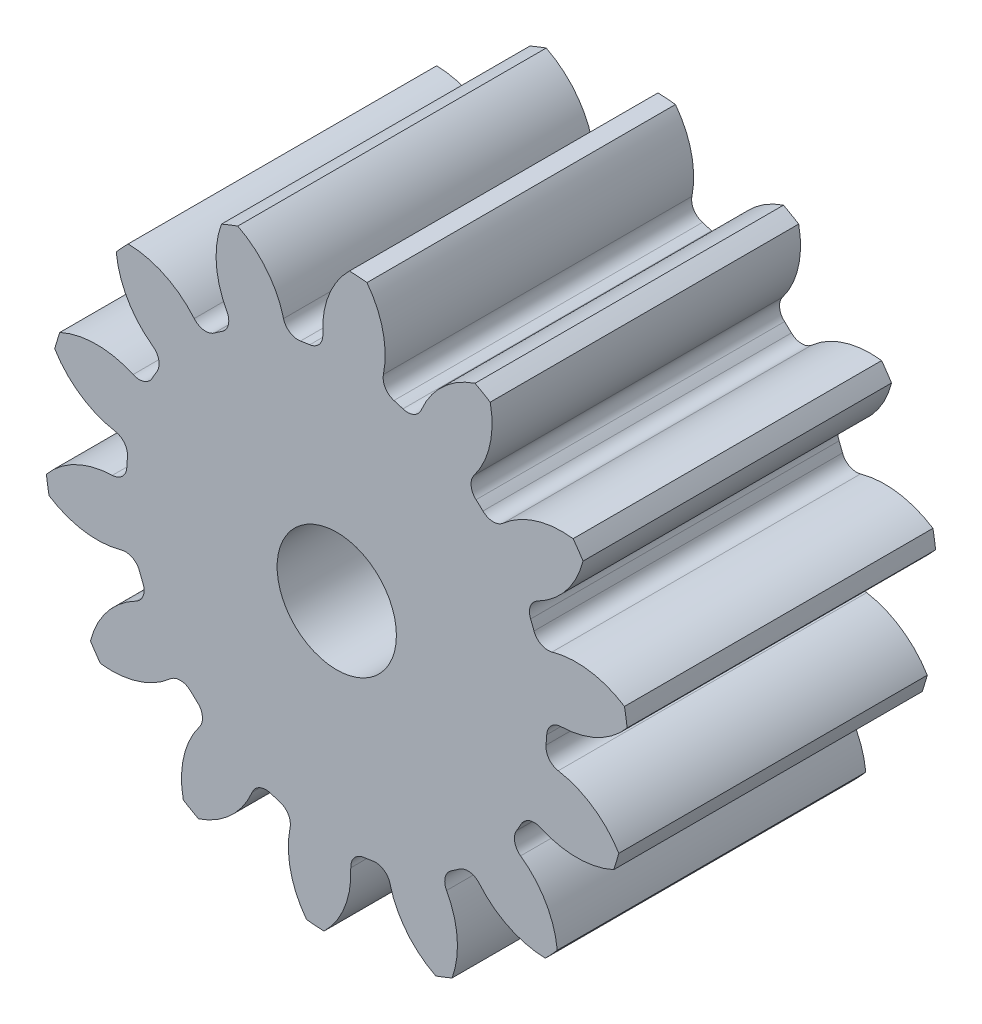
ISO-10303-21;
HEADER;
FILE_DESCRIPTION(('STEP AP214'),'2;1');
FILE_NAME('part.step','',(''),(''),'','','');
FILE_SCHEMA(('AUTOMOTIVE_DESIGN { 1 0 10303 214 1 1 1 1 }'));
ENDSEC;
DATA;
#1=APPLICATION_CONTEXT('core data for automotive mechanical design processes');
#2=APPLICATION_PROTOCOL_DEFINITION('international standard','automotive_design',2000,#1);
#3=PRODUCT_CONTEXT('',#1,'mechanical');
#4=PRODUCT('Part','Part','',(#3));
#5=PRODUCT_RELATED_PRODUCT_CATEGORY('part','',(#4));
#6=PRODUCT_DEFINITION_FORMATION('','',#4);
#7=PRODUCT_DEFINITION_CONTEXT('part definition',#1,'design');
#8=PRODUCT_DEFINITION('design','',#6,#7);
#9=PRODUCT_DEFINITION_SHAPE('','',#8);
#10=(LENGTH_UNIT() NAMED_UNIT(*) SI_UNIT(.MILLI.,.METRE.));
#11=(NAMED_UNIT(*) PLANE_ANGLE_UNIT() SI_UNIT($,.RADIAN.));
#12=(NAMED_UNIT(*) SI_UNIT($,.STERADIAN.) SOLID_ANGLE_UNIT());
#13=UNCERTAINTY_MEASURE_WITH_UNIT(LENGTH_MEASURE(1.E-05),#10,'distance_accuracy_value','');
#14=(GEOMETRIC_REPRESENTATION_CONTEXT(3) GLOBAL_UNCERTAINTY_ASSIGNED_CONTEXT((#13)) GLOBAL_UNIT_ASSIGNED_CONTEXT((#10,
#11,#12)) REPRESENTATION_CONTEXT('',''));
#15=CARTESIAN_POINT('',(0.,0.,0.));
#16=DIRECTION('',(0.,0.,1.));
#17=DIRECTION('',(1.,0.,0.));
#18=AXIS2_PLACEMENT_3D('',#15,#16,#17);
#19=CARTESIAN_POINT('',(0.,0.,95.25));
#20=DIRECTION('',(0.,0.,-1.));
#21=DIRECTION('',(-1.,0.,0.));
#22=AXIS2_PLACEMENT_3D('',#19,#20,#21);
#23=CYLINDRICAL_SURFACE('',#22,90.3111111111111);
#24=DIRECTION('',(0.,0.,-1.));
#25=VECTOR('',#24,1.);
#26=CARTESIAN_POINT('',(88.838215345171,16.2440230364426,47.625));
#27=LINE('',#26,#25);
#28=CARTESIAN_POINT('',(88.838215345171,16.2440230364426,95.25));
#29=VERTEX_POINT('',#28);
#30=CARTESIAN_POINT('',(88.838215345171,16.2440230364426,0.));
#31=VERTEX_POINT('',#30);
#32=EDGE_CURVE('E600',#29,#31,#27,.T.);
#33=ORIENTED_EDGE('',*,*,#32,.F.);
#34=CARTESIAN_POINT('',(0.,0.,95.25));
#35=DIRECTION('',(0.,0.,1.));
#36=DIRECTION('',(1.,0.,0.));
#37=AXIS2_PLACEMENT_3D('',#34,#35,#36);
#38=CIRCLE('',#37,90.3111111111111);
#39=CARTESIAN_POINT('',(89.6523164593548,10.8884775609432,95.25));
#40=VERTEX_POINT('',#39);
#41=EDGE_CURVE('E1093',#40,#29,#38,.T.);
#42=ORIENTED_EDGE('',*,*,#41,.F.);
#43=DIRECTION('',(0.,0.,-1.));
#44=VECTOR('',#43,1.);
#45=CARTESIAN_POINT('',(89.6523164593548,10.8884775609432,47.625));
#46=LINE('',#45,#44);
#47=CARTESIAN_POINT('',(89.6523164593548,10.8884775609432,0.));
#48=VERTEX_POINT('',#47);
#49=EDGE_CURVE('E1087',#48,#40,#46,.F.);
#50=ORIENTED_EDGE('',*,*,#49,.F.);
#51=CARTESIAN_POINT('',(0.,0.,0.));
#52=DIRECTION('',(0.,0.,1.));
#53=DIRECTION('',(1.,0.,0.));
#54=AXIS2_PLACEMENT_3D('',#51,#52,#53);
#55=CIRCLE('',#54,90.3111111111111);
#56=EDGE_CURVE('E1098',#48,#31,#55,.T.);
#57=ORIENTED_EDGE('',*,*,#56,.T.);
#58=EDGE_LOOP('',(#33,#42,#50,#57));
#59=FACE_BOUND('',#58,.T.);
#60=ADVANCED_FACE('F33',(#59),#23,.T.);
#61=DIRECTION('',(0.,0.,-1.));
#62=VECTOR('',#61,1.);
#63=CARTESIAN_POINT('',(76.0496127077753,48.7088615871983,47.625));
#64=LINE('',#63,#62);
#65=CARTESIAN_POINT('',(76.0496127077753,48.7088615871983,0.));
#66=VERTEX_POINT('',#65);
#67=CARTESIAN_POINT('',(76.0496127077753,48.7088615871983,95.25));
#68=VERTEX_POINT('',#67);
#69=EDGE_CURVE('E571',#66,#68,#64,.F.);
#70=ORIENTED_EDGE('',*,*,#69,.F.);
#71=CARTESIAN_POINT('',(72.9924488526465,53.1808160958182,0.));
#72=VERTEX_POINT('',#71);
#73=EDGE_CURVE('E1101',#66,#72,#55,.T.);
#74=ORIENTED_EDGE('',*,*,#73,.T.);
#75=DIRECTION('',(0.,0.,-1.));
#76=VECTOR('',#75,1.);
#77=CARTESIAN_POINT('',(72.9924488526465,53.1808160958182,47.625));
#78=LINE('',#77,#76);
#79=CARTESIAN_POINT('',(72.9924488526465,53.1808160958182,95.25));
#80=VERTEX_POINT('',#79);
#81=EDGE_CURVE('E633',#80,#72,#78,.T.);
#82=ORIENTED_EDGE('',*,*,#81,.F.);
#83=EDGE_CURVE('E1096',#68,#80,#38,.T.);
#84=ORIENTED_EDGE('',*,*,#83,.F.);
#85=EDGE_LOOP('',(#70,#74,#82,#84));
#86=FACE_BOUND('',#85,.T.);
#87=ADVANCED_FACE('F1261',(#86),#23,.T.);
#88=CARTESIAN_POINT('',(0.,0.,95.25));
#89=DIRECTION('',(0.,0.,1.));
#90=DIRECTION('',(1.,0.,0.));
#91=AXIS2_PLACEMENT_3D('',#88,#89,#90);
#92=PLANE('',#91);
#93=CARTESIAN_POINT('',(0.,0.,95.2500000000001));
#94=DIRECTION('',(0.,0.,1.));
#95=DIRECTION('',(1.,0.,0.));
#96=AXIS2_PLACEMENT_3D('',#93,#94,#95);
#97=CIRCLE('',#96,18.415);
#98=CARTESIAN_POINT('',(18.415,0.,95.2499999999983));
#99=VERTEX_POINT('',#98);
#100=EDGE_CURVE('E588',#99,#99,#97,.T.);
#101=ORIENTED_EDGE('',*,*,#100,.F.);
#102=EDGE_LOOP('',(#101));
#103=FACE_BOUND('',#102,.T.);
#104=ORIENTED_EDGE('',*,*,#41,.T.);
#105=CARTESIAN_POINT('',(73.949438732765,-6.74707500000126,95.25));
#106=DIRECTION('',(0.,0.,-1.));
#107=DIRECTION('',(0.900968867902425,0.433883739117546,0.));
#108=AXIS2_PLACEMENT_3D('',#105,#106,#107);
#109=CIRCLE('',#108,27.3909886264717);
#110=CARTESIAN_POINT('',(66.4753023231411,19.6044627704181,95.25));
#111=VERTEX_POINT('',#110);
#112=EDGE_CURVE('E580',#111,#29,#109,.T.);
#113=ORIENTED_EDGE('',*,*,#112,.F.);
#114=CARTESIAN_POINT('',(65.221587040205,24.0246825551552,95.25));
#115=DIRECTION('',(0.,0.,1.));
#116=DIRECTION('',(-0.900968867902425,-0.433883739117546,0.));
#117=AXIS2_PLACEMENT_3D('',#114,#115,#116);
#118=CIRCLE('',#117,4.59457777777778);
#119=CARTESIAN_POINT('',(60.910203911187,22.4365640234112,95.25));
#120=VERTEX_POINT('',#119);
#121=EDGE_CURVE('E578',#120,#111,#118,.T.);
#122=ORIENTED_EDGE('',*,*,#121,.F.);
#123=CARTESIAN_POINT('',(0.,0.,95.25));
#124=DIRECTION('',(0.,0.,-1.));
#125=DIRECTION('',(0.900968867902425,0.433883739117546,0.));
#126=AXIS2_PLACEMENT_3D('',#123,#124,#125);
#127=CIRCLE('',#126,64.9111111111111);
#128=CARTESIAN_POINT('',(59.8481169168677,25.1327524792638,95.25));
#129=VERTEX_POINT('',#128);
#130=EDGE_CURVE('E563',#129,#120,#127,.T.);
#131=ORIENTED_EDGE('',*,*,#130,.F.);
#132=CARTESIAN_POINT('',(64.084322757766,26.9117142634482,95.25));
#133=DIRECTION('',(0.,0.,1.));
#134=DIRECTION('',(-0.900968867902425,-0.433883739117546,0.));
#135=AXIS2_PLACEMENT_3D('',#132,#133,#134);
#136=CIRCLE('',#135,4.59457777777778);
#137=CARTESIAN_POINT('',(61.9865703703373,30.9994495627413,95.25));
#138=VERTEX_POINT('',#137);
#139=EDGE_CURVE('E555',#138,#129,#136,.T.);
#140=ORIENTED_EDGE('',*,*,#139,.F.);
#141=CARTESIAN_POINT('',(49.4806308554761,55.3688511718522,95.25));
#142=DIRECTION('',(0.,0.,-1.));
#143=DIRECTION('',(-0.900968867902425,-0.433883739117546,0.));
#144=AXIS2_PLACEMENT_3D('',#141,#142,#143);
#145=CIRCLE('',#144,27.3909886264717);
#146=EDGE_CURVE('E585',#68,#138,#145,.T.);
#147=ORIENTED_EDGE('',*,*,#146,.F.);
#148=ORIENTED_EDGE('',*,*,#83,.T.);
#149=CARTESIAN_POINT('',(69.5535882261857,26.006554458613,95.25));
#150=DIRECTION('',(0.,0.,-1.));
#151=DIRECTION('',(0.623489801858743,0.781831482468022,0.));
#152=AXIS2_PLACEMENT_3D('',#149,#150,#151);
#153=CIRCLE('',#152,27.3909886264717);
#154=CARTESIAN_POINT('',(51.3861202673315,46.5055633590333,95.25));
#155=VERTEX_POINT('',#154);
#156=EDGE_CURVE('E609',#155,#80,#153,.T.);
#157=ORIENTED_EDGE('',*,*,#156,.F.);
#158=CARTESIAN_POINT('',(48.3387003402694,49.9440770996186,95.25));
#159=DIRECTION('',(0.,0.,1.));
#160=DIRECTION('',(-0.623489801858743,-0.781831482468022,0.));
#161=AXIS2_PLACEMENT_3D('',#158,#159,#160);
#162=CIRCLE('',#161,4.59457777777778);
#163=CARTESIAN_POINT('',(45.1433371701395,46.6425927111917,95.25));
#164=VERTEX_POINT('',#163);
#165=EDGE_CURVE('E607',#164,#155,#162,.T.);
#166=ORIENTED_EDGE('',*,*,#165,.F.);
#167=CARTESIAN_POINT('',(0.,0.,95.25));
#168=DIRECTION('',(0.,0.,-1.));
#169=DIRECTION('',(0.623489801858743,0.781831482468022,0.));
#170=AXIS2_PLACEMENT_3D('',#167,#168,#169);
#171=CIRCLE('',#170,64.9111111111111);
#172=CARTESIAN_POINT('',(43.0165975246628,48.6109522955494,95.25));
#173=VERTEX_POINT('',#172);
#174=EDGE_CURVE('E604',#173,#164,#171,.T.);
#175=ORIENTED_EDGE('',*,*,#174,.F.);
#176=CARTESIAN_POINT('',(46.0614245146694,52.0517623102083,95.25));
#177=DIRECTION('',(0.,0.,1.));
#178=DIRECTION('',(-0.623489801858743,-0.781831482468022,0.));
#179=AXIS2_PLACEMENT_3D('',#176,#177,#178);
#180=CIRCLE('',#179,4.59457777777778);
#181=CARTESIAN_POINT('',(42.397813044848,54.8245039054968,95.25));
#182=VERTEX_POINT('',#181);
#183=EDGE_CURVE('E602',#182,#173,#180,.T.);
#184=ORIENTED_EDGE('',*,*,#183,.F.);
#185=CARTESIAN_POINT('',(20.5568637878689,71.3544522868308,95.25));
#186=DIRECTION('',(0.,0.,-1.));
#187=DIRECTION('',(-0.623489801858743,-0.781831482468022,0.));
#188=AXIS2_PLACEMENT_3D('',#185,#186,#187);
#189=CIRCLE('',#188,27.3909886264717);
#190=CARTESIAN_POINT('',(47.3843504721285,76.8818582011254,95.25));
#191=VERTEX_POINT('',#190);
#192=EDGE_CURVE('E612',#191,#182,#189,.T.);
#193=ORIENTED_EDGE('',*,*,#192,.F.);
#194=CARTESIAN_POINT('',(42.6896326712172,79.5844963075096,95.25));
#195=VERTEX_POINT('',#194);
#196=EDGE_CURVE('E1137',#191,#195,#38,.T.);
#197=ORIENTED_EDGE('',*,*,#196,.T.);
#198=CARTESIAN_POINT('',(51.38179655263,53.6092668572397,95.25));
#199=DIRECTION('',(0.,0.,-1.));
#200=DIRECTION('',(0.222520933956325,0.974927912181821,0.));
#201=AXIS2_PLACEMENT_3D('',#198,#199,#200);
#202=CIRCLE('',#201,27.3909886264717);
#203=CARTESIAN_POINT('',(26.1192868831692,64.1956667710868,95.25));
#204=VERTEX_POINT('',#203);
#205=EDGE_CURVE('E644',#204,#195,#202,.T.);
#206=ORIENTED_EDGE('',*,*,#205,.F.);
#207=CARTESIAN_POINT('',(21.8817412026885,65.9714346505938,95.25));
#208=DIRECTION('',(0.,0.,1.));
#209=DIRECTION('',(-0.222520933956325,-0.974927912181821,0.));
#210=AXIS2_PLACEMENT_3D('',#207,#208,#209);
#211=CIRCLE('',#210,4.59457777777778);
#212=CARTESIAN_POINT('',(20.4352788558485,61.6104838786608,95.25));
#213=VERTEX_POINT('',#212);
#214=EDGE_CURVE('E642',#213,#204,#211,.T.);
#215=ORIENTED_EDGE('',*,*,#214,.F.);
#216=CARTESIAN_POINT('',(0.,0.,95.25));
#217=DIRECTION('',(0.,0.,-1.));
#218=DIRECTION('',(0.222520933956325,0.974927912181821,0.));
#219=AXIS2_PLACEMENT_3D('',#216,#217,#218);
#220=CIRCLE('',#219,64.9111111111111);
#221=CARTESIAN_POINT('',(17.6651134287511,62.4611568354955,95.25));
#222=VERTEX_POINT('',#221);
#223=EDGE_CURVE('E639',#222,#213,#220,.T.);
#224=ORIENTED_EDGE('',*,*,#223,.F.);
#225=CARTESIAN_POINT('',(18.9154962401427,66.8823204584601,95.25));
#226=DIRECTION('',(0.,0.,1.));
#227=DIRECTION('',(-0.222520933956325,-0.974927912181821,0.));
#228=AXIS2_PLACEMENT_3D('',#225,#226,#227);
#229=CIRCLE('',#228,4.59457777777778);
#230=CARTESIAN_POINT('',(14.4116488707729,67.7908928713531,95.25));
#231=VERTEX_POINT('',#230);
#232=EDGE_CURVE('E637',#231,#222,#229,.T.);
#233=ORIENTED_EDGE('',*,*,#232,.F.);
#234=CARTESIAN_POINT('',(-12.4384422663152,73.207429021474,95.25));
#235=DIRECTION('',(0.,0.,-1.));
#236=DIRECTION('',(-0.222520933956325,-0.974927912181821,0.));
#237=AXIS2_PLACEMENT_3D('',#234,#235,#236);
#238=CIRCLE('',#237,27.3909886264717);
#239=CARTESIAN_POINT('',(9.33403649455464,89.8274599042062,95.25));
#240=VERTEX_POINT('',#239);
#241=EDGE_CURVE('E647',#240,#231,#238,.T.);
#242=ORIENTED_EDGE('',*,*,#241,.F.);
#243=CARTESIAN_POINT('',(3.93161118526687,90.2254909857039,95.25));
#244=VERTEX_POINT('',#243);
#245=EDGE_CURVE('E1243',#240,#244,#38,.T.);
#246=ORIENTED_EDGE('',*,*,#245,.T.);
#247=CARTESIAN_POINT('',(23.0332099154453,70.5940064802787,95.25));
#248=DIRECTION('',(0.,0.,-1.));
#249=DIRECTION('',(-0.222520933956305,0.974927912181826,0.));
#250=AXIS2_PLACEMENT_3D('',#247,#248,#249);
#251=CIRCLE('',#250,27.3909886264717);
#252=CARTESIAN_POINT('',(-4.3207916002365,69.1710310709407,95.25));
#253=VERTEX_POINT('',#252);
#254=EDGE_CURVE('E682',#253,#244,#251,.T.);
#255=ORIENTED_EDGE('',*,*,#254,.F.);
#256=CARTESIAN_POINT('',(-8.90916514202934,68.9323404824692,95.25));
#257=DIRECTION('',(0.,0.,1.));
#258=DIRECTION('',(0.222520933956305,-0.974927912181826,0.));
#259=AXIS2_PLACEMENT_3D('',#256,#257,#258);
#260=CIRCLE('',#259,4.59457777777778);
#261=CARTESIAN_POINT('',(-8.3202370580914,64.3756631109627,95.25));
#262=VERTEX_POINT('',#261);
#263=EDGE_CURVE('E680',#262,#253,#260,.T.);
#264=ORIENTED_EDGE('',*,*,#263,.F.);
#265=CARTESIAN_POINT('',(0.,0.,95.25));
#266=DIRECTION('',(0.,0.,-1.));
#267=DIRECTION('',(-0.222520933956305,0.974927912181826,0.));
#268=AXIS2_PLACEMENT_3D('',#265,#266,#267);
#269=CIRCLE('',#268,64.9111111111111);
#270=CARTESIAN_POINT('',(-11.1851630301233,63.9401632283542,95.25));
#271=VERTEX_POINT('',#270);
#272=EDGE_CURVE('E677',#271,#262,#269,.T.);
#273=ORIENTED_EDGE('',*,*,#272,.F.);
#274=CARTESIAN_POINT('',(-11.9768780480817,68.4660147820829,95.25));
#275=DIRECTION('',(0.,0.,1.));
#276=DIRECTION('',(0.222520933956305,-0.974927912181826,0.));
#277=AXIS2_PLACEMENT_3D('',#274,#275,#276);
#278=CIRCLE('',#277,4.59457777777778);
#279=CARTESIAN_POINT('',(-16.4289191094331,67.3304641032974,95.25));
#280=VERTEX_POINT('',#279);
#281=EDGE_CURVE('E675',#280,#271,#278,.T.);
#282=ORIENTED_EDGE('',*,*,#281,.F.);
#283=CARTESIAN_POINT('',(-42.970162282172,60.5607766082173,95.25));
#284=DIRECTION('',(0.,0.,-1.));
#285=DIRECTION('',(0.222520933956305,-0.974927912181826,0.));
#286=AXIS2_PLACEMENT_3D('',#283,#284,#285);
#287=CIRCLE('',#286,27.3909886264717);
#288=CARTESIAN_POINT('',(-30.5649978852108,84.9816315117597,95.25));
#289=VERTEX_POINT('',#288);
#290=EDGE_CURVE('E685',#289,#280,#287,.T.);
#291=ORIENTED_EDGE('',*,*,#290,.F.);
#292=CARTESIAN_POINT('',(-35.6051141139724,82.9962206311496,95.25));
#293=VERTEX_POINT('',#292);
#294=EDGE_CURVE('E1239',#289,#293,#38,.T.);
#295=ORIENTED_EDGE('',*,*,#294,.T.);
#296=CARTESIAN_POINT('',(-9.87738642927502,73.5967373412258,95.25));
#297=DIRECTION('',(0.,0.,-1.));
#298=DIRECTION('',(-0.623489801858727,0.781831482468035,0.));
#299=AXIS2_PLACEMENT_3D('',#296,#297,#298);
#300=CIRCLE('',#299,27.3909886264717);
#301=CARTESIAN_POINT('',(-33.9050843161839,60.4462243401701,95.25));
#302=VERTEX_POINT('',#301);
#303=EDGE_CURVE('E720',#302,#293,#300,.T.);
#304=ORIENTED_EDGE('',*,*,#303,.F.);
#305=CARTESIAN_POINT('',(-37.9355020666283,58.2403508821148,95.25));
#306=DIRECTION('',(0.,0.,1.));
#307=DIRECTION('',(0.623489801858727,-0.781831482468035,0.));
#308=AXIS2_PLACEMENT_3D('',#305,#306,#307);
#309=CIRCLE('',#308,4.59457777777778);
#310=CARTESIAN_POINT('',(-35.4278279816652,54.3904527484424,95.25));
#311=VERTEX_POINT('',#310);
#312=EDGE_CURVE('E718',#311,#302,#309,.T.);
#313=ORIENTED_EDGE('',*,*,#312,.F.);
#314=CARTESIAN_POINT('',(0.,0.,95.25));
#315=DIRECTION('',(0.,0.,-1.));
#316=DIRECTION('',(-0.623489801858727,0.781831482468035,0.));
#317=AXIS2_PLACEMENT_3D('',#314,#315,#316);
#318=CIRCLE('',#317,64.9111111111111);
#319=CARTESIAN_POINT('',(-37.8200807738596,52.7550361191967,95.25));
#320=VERTEX_POINT('',#319);
#321=EDGE_CURVE('E715',#320,#311,#318,.T.);
#322=ORIENTED_EDGE('',*,*,#321,.F.);
#323=CARTESIAN_POINT('',(-40.4970847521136,56.4891751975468,95.25));
#324=DIRECTION('',(0.,0.,1.));
#325=DIRECTION('',(0.623489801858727,-0.781831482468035,0.));
#326=AXIS2_PLACEMENT_3D('',#323,#324,#325);
#327=CIRCLE('',#326,4.59457777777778);
#328=CARTESIAN_POINT('',(-44.0155381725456,53.5344111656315,95.25));
#329=VERTEX_POINT('',#328);
#330=EDGE_CURVE('E713',#329,#320,#327,.T.);
#331=ORIENTED_EDGE('',*,*,#330,.F.);
#332=CARTESIAN_POINT('',(-64.9911146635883,35.9193196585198,95.25));
#333=DIRECTION('',(0.,0.,-1.));
#334=DIRECTION('',(0.623489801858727,-0.781831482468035,0.));
#335=AXIS2_PLACEMENT_3D('',#332,#333,#334);
#336=CIRCLE('',#335,27.3909886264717);
#337=CARTESIAN_POINT('',(-64.4102595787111,63.3041487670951,95.25));
#338=VERTEX_POINT('',#337);
#339=EDGE_CURVE('E723',#338,#329,#336,.T.);
#340=ORIENTED_EDGE('',*,*,#339,.F.);
#341=CARTESIAN_POINT('',(-68.0898098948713,59.3285308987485,95.25));
#342=VERTEX_POINT('',#341);
#343=EDGE_CURVE('E1235',#338,#342,#38,.T.);
#344=ORIENTED_EDGE('',*,*,#343,.T.);
#345=CARTESIAN_POINT('',(-40.8316452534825,62.022731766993,95.25));
#346=DIRECTION('',(0.,0.,-1.));
#347=DIRECTION('',(-0.900968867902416,0.433883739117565,0.));
#348=AXIS2_PLACEMENT_3D('',#345,#346,#347);
#349=CIRCLE('',#348,27.3909886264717);
#350=CARTESIAN_POINT('',(-56.7740592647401,39.7493015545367,95.25));
#351=VERTEX_POINT('',#350);
#352=EDGE_CURVE('E758',#351,#342,#349,.T.);
#353=ORIENTED_EDGE('',*,*,#352,.F.);
#354=CARTESIAN_POINT('',(-59.4482475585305,36.0131455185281,95.25));
#355=DIRECTION('',(0.,0.,1.));
#356=DIRECTION('',(0.900968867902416,-0.433883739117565,0.));
#357=AXIS2_PLACEMENT_3D('',#354,#355,#356);
#358=CIRCLE('',#357,4.59457777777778);
#359=CARTESIAN_POINT('',(-55.5185030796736,33.6325461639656,95.25));
#360=VERTEX_POINT('',#359);
#361=EDGE_CURVE('E756',#360,#351,#358,.T.);
#362=ORIENTED_EDGE('',*,*,#361,.F.);
#363=CARTESIAN_POINT('',(0.,0.,95.25));
#364=DIRECTION('',(0.,0.,-1.));
#365=DIRECTION('',(-0.900968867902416,0.433883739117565,0.));
#366=AXIS2_PLACEMENT_3D('',#363,#364,#365);
#367=CIRCLE('',#366,64.9111111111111);
#368=CARTESIAN_POINT('',(-56.9642676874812,31.1211271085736,95.25));
#369=VERTEX_POINT('',#368);
#370=EDGE_CURVE('E753',#369,#360,#367,.T.);
#371=ORIENTED_EDGE('',*,*,#370,.F.);
#372=CARTESIAN_POINT('',(-60.9963471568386,33.3239616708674,95.25));
#373=DIRECTION('',(0.,0.,1.));
#374=DIRECTION('',(0.900968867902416,-0.433883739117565,0.));
#375=AXIS2_PLACEMENT_3D('',#372,#373,#374);
#376=CIRCLE('',#375,4.59457777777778);
#377=CARTESIAN_POINT('',(-62.8843400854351,29.1352115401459,95.25));
#378=VERTEX_POINT('',#377);
#379=EDGE_CURVE('E751',#378,#369,#376,.T.);
#380=ORIENTED_EDGE('',*,*,#379,.F.);
#381=CARTESIAN_POINT('',(-74.1397797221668,4.16360092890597,95.25));
#382=DIRECTION('',(0.,0.,-1.));
#383=DIRECTION('',(0.900968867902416,-0.433883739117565,0.));
#384=AXIS2_PLACEMENT_3D('',#381,#382,#383);
#385=CIRCLE('',#384,27.3909886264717);
#386=CARTESIAN_POINT('',(-85.4982794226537,29.0885029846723,95.25));
#387=VERTEX_POINT('',#386);
#388=EDGE_CURVE('E761',#387,#378,#385,.T.);
#389=ORIENTED_EDGE('',*,*,#388,.F.);
#390=CARTESIAN_POINT('',(-87.0884837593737,23.9100980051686,95.25));
#391=VERTEX_POINT('',#390);
#392=EDGE_CURVE('E1231',#387,#391,#38,.T.);
#393=ORIENTED_EDGE('',*,*,#392,.T.);
#394=CARTESIAN_POINT('',(-63.6986959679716,38.1643635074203,95.25));
#395=DIRECTION('',(0.,0.,-1.));
#396=DIRECTION('',(-1.,0.,0.));
#397=AXIS2_PLACEMENT_3D('',#394,#395,#396);
#398=CIRCLE('',#397,27.3909886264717);
#399=CARTESIAN_POINT('',(-68.3982354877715,11.1795421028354,95.25));
#400=VERTEX_POINT('',#399);
#401=EDGE_CURVE('E796',#400,#391,#398,.T.);
#402=ORIENTED_EDGE('',*,*,#401,.F.);
#403=CARTESIAN_POINT('',(-69.1865385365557,6.65309501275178,95.25));
#404=DIRECTION('',(0.,0.,1.));
#405=DIRECTION('',(1.,0.,0.));
#406=AXIS2_PLACEMENT_3D('',#403,#404,#405);
#407=CIRCLE('',#406,4.59457777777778);
#408=CARTESIAN_POINT('',(-64.6130577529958,6.21330133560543,95.25));
#409=VERTEX_POINT('',#408);
#410=EDGE_CURVE('E794',#409,#400,#407,.T.);
#411=ORIENTED_EDGE('',*,*,#410,.F.);
#412=CARTESIAN_POINT('',(0.,0.,95.25));
#413=DIRECTION('',(0.,0.,-1.));
#414=DIRECTION('',(-1.,0.,0.));
#415=AXIS2_PLACEMENT_3D('',#412,#413,#414);
#416=CIRCLE('',#415,64.9111111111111);
#417=CARTESIAN_POINT('',(-64.825982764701,3.32329719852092,95.25));
#418=VERTEX_POINT('',#417);
#419=EDGE_CURVE('E791',#418,#409,#416,.T.);
#420=ORIENTED_EDGE('',*,*,#419,.F.);
#421=CARTESIAN_POINT('',(-69.4145349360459,3.55852884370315,95.25));
#422=DIRECTION('',(0.,0.,1.));
#423=DIRECTION('',(1.,0.,0.));
#424=AXIS2_PLACEMENT_3D('',#421,#422,#423);
#425=CIRCLE('',#424,4.59457777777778);
#426=CARTESIAN_POINT('',(-69.2981272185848,-1.03457405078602,95.25));
#427=VERTEX_POINT('',#426);
#428=EDGE_CURVE('E789',#427,#418,#425,.T.);
#429=ORIENTED_EDGE('',*,*,#428,.F.);
#430=CARTESIAN_POINT('',(-68.6041521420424,-28.416770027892,95.25));
#431=DIRECTION('',(0.,0.,-1.));
#432=DIRECTION('',(1.,0.,0.));
#433=AXIS2_PLACEMENT_3D('',#430,#431,#432);
#434=CIRCLE('',#433,27.3909886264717);
#435=CARTESIAN_POINT('',(-89.6523164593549,-10.8884775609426,95.25));
#436=VERTEX_POINT('',#435);
#437=EDGE_CURVE('E799',#436,#427,#434,.T.);
#438=ORIENTED_EDGE('',*,*,#437,.F.);
#439=CARTESIAN_POINT('',(-88.8382153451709,-16.2440230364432,95.25));
#440=VERTEX_POINT('',#439);
#441=EDGE_CURVE('E1227',#436,#440,#38,.T.);
#442=ORIENTED_EDGE('',*,*,#441,.T.);
#443=CARTESIAN_POINT('',(-73.949438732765,6.74707500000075,95.25));
#444=DIRECTION('',(0.,0.,-1.));
#445=DIRECTION('',(-0.900968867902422,-0.433883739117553,0.));
#446=AXIS2_PLACEMENT_3D('',#443,#444,#445);
#447=CIRCLE('',#446,27.3909886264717);
#448=CARTESIAN_POINT('',(-66.475302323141,-19.6044627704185,95.25));
#449=VERTEX_POINT('',#448);
#450=EDGE_CURVE('E834',#449,#440,#447,.T.);
#451=ORIENTED_EDGE('',*,*,#450,.F.);
#452=CARTESIAN_POINT('',(-65.2215870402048,-24.0246825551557,95.25));
#453=DIRECTION('',(0.,0.,1.));
#454=DIRECTION('',(0.900968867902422,0.433883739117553,0.));
#455=AXIS2_PLACEMENT_3D('',#452,#453,#454);
#456=CIRCLE('',#455,4.59457777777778);
#457=CARTESIAN_POINT('',(-60.9102039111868,-22.4365640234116,95.25));
#458=VERTEX_POINT('',#457);
#459=EDGE_CURVE('E832',#458,#449,#456,.T.);
#460=ORIENTED_EDGE('',*,*,#459,.F.);
#461=CARTESIAN_POINT('',(0.,0.,95.25));
#462=DIRECTION('',(0.,0.,-1.));
#463=DIRECTION('',(-0.900968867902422,-0.433883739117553,0.));
#464=AXIS2_PLACEMENT_3D('',#461,#462,#463);
#465=CIRCLE('',#464,64.9111111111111);
#466=CARTESIAN_POINT('',(-59.8481169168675,-25.1327524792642,95.25));
#467=VERTEX_POINT('',#466);
#468=EDGE_CURVE('E829',#467,#458,#465,.T.);
#469=ORIENTED_EDGE('',*,*,#468,.F.);
#470=CARTESIAN_POINT('',(-64.0843227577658,-26.9117142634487,95.25));
#471=DIRECTION('',(0.,0.,1.));
#472=DIRECTION('',(0.900968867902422,0.433883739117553,0.));
#473=AXIS2_PLACEMENT_3D('',#470,#471,#472);
#474=CIRCLE('',#473,4.59457777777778);
#475=CARTESIAN_POINT('',(-61.986570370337,-30.9994495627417,95.25));
#476=VERTEX_POINT('',#475);
#477=EDGE_CURVE('E827',#476,#467,#474,.T.);
#478=ORIENTED_EDGE('',*,*,#477,.F.);
#479=CARTESIAN_POINT('',(-49.4806308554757,-55.3688511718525,95.25));
#480=DIRECTION('',(0.,0.,-1.));
#481=DIRECTION('',(0.900968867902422,0.433883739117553,0.));
#482=AXIS2_PLACEMENT_3D('',#479,#480,#481);
#483=CIRCLE('',#482,27.3909886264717);
#484=CARTESIAN_POINT('',(-76.0496127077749,-48.7088615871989,95.25));
#485=VERTEX_POINT('',#484);
#486=EDGE_CURVE('E837',#485,#476,#483,.T.);
#487=ORIENTED_EDGE('',*,*,#486,.F.);
#488=CARTESIAN_POINT('',(-72.9924488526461,-53.1808160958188,95.25));
#489=VERTEX_POINT('',#488);
#490=EDGE_CURVE('E1223',#485,#489,#38,.T.);
#491=ORIENTED_EDGE('',*,*,#490,.T.);
#492=CARTESIAN_POINT('',(-69.5535882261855,-26.0065544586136,95.25));
#493=DIRECTION('',(0.,0.,-1.));
#494=DIRECTION('',(-0.623489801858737,-0.781831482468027,0.));
#495=AXIS2_PLACEMENT_3D('',#492,#493,#494);
#496=CIRCLE('',#495,27.3909886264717);
#497=CARTESIAN_POINT('',(-51.3861202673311,-46.5055633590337,95.25));
#498=VERTEX_POINT('',#497);
#499=EDGE_CURVE('E872',#498,#489,#496,.T.);
#500=ORIENTED_EDGE('',*,*,#499,.F.);
#501=CARTESIAN_POINT('',(-48.338700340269,-49.944077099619,95.25));
#502=DIRECTION('',(0.,0.,1.));
#503=DIRECTION('',(0.623489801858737,0.781831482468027,0.));
#504=AXIS2_PLACEMENT_3D('',#501,#502,#503);
#505=CIRCLE('',#504,4.59457777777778);
#506=CARTESIAN_POINT('',(-45.1433371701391,-46.642592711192,95.25));
#507=VERTEX_POINT('',#506);
#508=EDGE_CURVE('E870',#507,#498,#505,.T.);
#509=ORIENTED_EDGE('',*,*,#508,.F.);
#510=CARTESIAN_POINT('',(0.,0.,95.25));
#511=DIRECTION('',(0.,0.,-1.));
#512=DIRECTION('',(-0.623489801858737,-0.781831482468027,0.));
#513=AXIS2_PLACEMENT_3D('',#510,#511,#512);
#514=CIRCLE('',#513,64.9111111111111);
#515=CARTESIAN_POINT('',(-43.0165975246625,-48.6109522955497,95.25));
#516=VERTEX_POINT('',#515);
#517=EDGE_CURVE('E867',#516,#507,#514,.T.);
#518=ORIENTED_EDGE('',*,*,#517,.F.);
#519=CARTESIAN_POINT('',(-46.061424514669,-52.0517623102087,95.25));
#520=DIRECTION('',(0.,0.,1.));
#521=DIRECTION('',(0.623489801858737,0.781831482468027,0.));
#522=AXIS2_PLACEMENT_3D('',#519,#520,#521);
#523=CIRCLE('',#522,4.59457777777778);
#524=CARTESIAN_POINT('',(-42.3978130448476,-54.8245039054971,95.25));
#525=VERTEX_POINT('',#524);
#526=EDGE_CURVE('E865',#525,#516,#523,.T.);
#527=ORIENTED_EDGE('',*,*,#526,.F.);
#528=CARTESIAN_POINT('',(-20.5568637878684,-71.3544522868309,95.25));
#529=DIRECTION('',(0.,0.,-1.));
#530=DIRECTION('',(0.623489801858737,0.781831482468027,0.));
#531=AXIS2_PLACEMENT_3D('',#528,#529,#530);
#532=CIRCLE('',#531,27.3909886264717);
#533=CARTESIAN_POINT('',(-47.3843504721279,-76.8818582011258,95.25));
#534=VERTEX_POINT('',#533);
#535=EDGE_CURVE('E875',#534,#525,#532,.T.);
#536=ORIENTED_EDGE('',*,*,#535,.F.);
#537=CARTESIAN_POINT('',(-42.6896326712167,-79.5844963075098,95.25));
#538=VERTEX_POINT('',#537);
#539=EDGE_CURVE('E1219',#534,#538,#38,.T.);
#540=ORIENTED_EDGE('',*,*,#539,.T.);
#541=CARTESIAN_POINT('',(-51.3817965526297,-53.60926685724,95.25));
#542=DIRECTION('',(0.,0.,-1.));
#543=DIRECTION('',(-0.222520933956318,-0.974927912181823,0.));
#544=AXIS2_PLACEMENT_3D('',#541,#542,#543);
#545=CIRCLE('',#544,27.3909886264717);
#546=CARTESIAN_POINT('',(-26.1192868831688,-64.195666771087,95.25));
#547=VERTEX_POINT('',#546);
#548=EDGE_CURVE('E910',#547,#538,#545,.T.);
#549=ORIENTED_EDGE('',*,*,#548,.F.);
#550=CARTESIAN_POINT('',(-21.8817412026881,-65.971434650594,95.25));
#551=DIRECTION('',(0.,0.,1.));
#552=DIRECTION('',(0.222520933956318,0.974927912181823,0.));
#553=AXIS2_PLACEMENT_3D('',#550,#551,#552);
#554=CIRCLE('',#553,4.59457777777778);
#555=CARTESIAN_POINT('',(-20.4352788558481,-61.6104838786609,95.25));
#556=VERTEX_POINT('',#555);
#557=EDGE_CURVE('E908',#556,#547,#554,.T.);
#558=ORIENTED_EDGE('',*,*,#557,.F.);
#559=CARTESIAN_POINT('',(0.,0.,95.25));
#560=DIRECTION('',(0.,0.,-1.));
#561=DIRECTION('',(-0.222520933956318,-0.974927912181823,0.));
#562=AXIS2_PLACEMENT_3D('',#559,#560,#561);
#563=CIRCLE('',#562,64.9111111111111);
#564=CARTESIAN_POINT('',(-17.6651134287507,-62.4611568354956,95.25));
#565=VERTEX_POINT('',#564);
#566=EDGE_CURVE('E905',#565,#556,#563,.T.);
#567=ORIENTED_EDGE('',*,*,#566,.F.);
#568=CARTESIAN_POINT('',(-18.9154962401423,-66.8823204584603,95.25));
#569=DIRECTION('',(0.,0.,1.));
#570=DIRECTION('',(0.222520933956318,0.974927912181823,0.));
#571=AXIS2_PLACEMENT_3D('',#568,#569,#570);
#572=CIRCLE('',#571,4.59457777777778);
#573=CARTESIAN_POINT('',(-14.4116488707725,-67.7908928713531,95.25));
#574=VERTEX_POINT('',#573);
#575=EDGE_CURVE('E903',#574,#565,#572,.T.);
#576=ORIENTED_EDGE('',*,*,#575,.F.);
#577=CARTESIAN_POINT('',(12.4384422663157,-73.2074290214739,95.25));
#578=DIRECTION('',(0.,0.,-1.));
#579=DIRECTION('',(0.222520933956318,0.974927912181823,0.));
#580=AXIS2_PLACEMENT_3D('',#577,#578,#579);
#581=CIRCLE('',#580,27.3909886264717);
#582=CARTESIAN_POINT('',(-9.33403649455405,-89.8274599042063,95.25));
#583=VERTEX_POINT('',#582);
#584=EDGE_CURVE('E913',#583,#574,#581,.T.);
#585=ORIENTED_EDGE('',*,*,#584,.F.);
#586=CARTESIAN_POINT('',(-3.93161118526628,-90.225490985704,95.25));
#587=VERTEX_POINT('',#586);
#588=EDGE_CURVE('E1215',#583,#587,#38,.T.);
#589=ORIENTED_EDGE('',*,*,#588,.T.);
#590=CARTESIAN_POINT('',(-23.0332099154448,-70.5940064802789,95.25));
#591=DIRECTION('',(0.,0.,-1.));
#592=DIRECTION('',(0.222520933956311,-0.974927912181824,0.));
#593=AXIS2_PLACEMENT_3D('',#590,#591,#592);
#594=CIRCLE('',#593,27.3909886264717);
#595=CARTESIAN_POINT('',(4.32079160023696,-69.1710310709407,95.25));
#596=VERTEX_POINT('',#595);
#597=EDGE_CURVE('E948',#596,#587,#594,.T.);
#598=ORIENTED_EDGE('',*,*,#597,.F.);
#599=CARTESIAN_POINT('',(8.90916514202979,-68.9323404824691,95.25));
#600=DIRECTION('',(0.,0.,1.));
#601=DIRECTION('',(-0.222520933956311,0.974927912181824,0.));
#602=AXIS2_PLACEMENT_3D('',#599,#600,#601);
#603=CIRCLE('',#602,4.59457777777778);
#604=CARTESIAN_POINT('',(8.32023705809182,-64.3756631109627,95.25));
#605=VERTEX_POINT('',#604);
#606=EDGE_CURVE('E946',#605,#596,#603,.T.);
#607=ORIENTED_EDGE('',*,*,#606,.F.);
#608=CARTESIAN_POINT('',(0.,0.,95.25));
#609=DIRECTION('',(0.,0.,-1.));
#610=DIRECTION('',(0.222520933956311,-0.974927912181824,0.));
#611=AXIS2_PLACEMENT_3D('',#608,#609,#610);
#612=CIRCLE('',#611,64.9111111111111);
#613=CARTESIAN_POINT('',(11.1851630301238,-63.9401632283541,95.25));
#614=VERTEX_POINT('',#613);
#615=EDGE_CURVE('E943',#614,#605,#612,.T.);
#616=ORIENTED_EDGE('',*,*,#615,.F.);
#617=CARTESIAN_POINT('',(11.9768780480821,-68.4660147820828,95.25));
#618=DIRECTION('',(0.,0.,1.));
#619=DIRECTION('',(-0.222520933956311,0.974927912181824,0.));
#620=AXIS2_PLACEMENT_3D('',#617,#618,#619);
#621=CIRCLE('',#620,4.59457777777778);
#622=CARTESIAN_POINT('',(16.4289191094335,-67.3304641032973,95.25));
#623=VERTEX_POINT('',#622);
#624=EDGE_CURVE('E941',#623,#614,#621,.T.);
#625=ORIENTED_EDGE('',*,*,#624,.F.);
#626=CARTESIAN_POINT('',(42.9701622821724,-60.5607766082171,95.25));
#627=DIRECTION('',(0.,0.,-1.));
#628=DIRECTION('',(-0.222520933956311,0.974927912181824,0.));
#629=AXIS2_PLACEMENT_3D('',#626,#627,#628);
#630=CIRCLE('',#629,27.3909886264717);
#631=CARTESIAN_POINT('',(30.5649978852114,-84.9816315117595,95.25));
#632=VERTEX_POINT('',#631);
#633=EDGE_CURVE('E951',#632,#623,#630,.T.);
#634=ORIENTED_EDGE('',*,*,#633,.F.);
#635=CARTESIAN_POINT('',(35.605114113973,-82.9962206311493,95.25));
#636=VERTEX_POINT('',#635);
#637=EDGE_CURVE('E1211',#632,#636,#38,.T.);
#638=ORIENTED_EDGE('',*,*,#637,.T.);
#639=CARTESIAN_POINT('',(9.87738642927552,-73.5967373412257,95.25));
#640=DIRECTION('',(0.,0.,-1.));
#641=DIRECTION('',(0.623489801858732,-0.781831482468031,0.));
#642=AXIS2_PLACEMENT_3D('',#639,#640,#641);
#643=CIRCLE('',#642,27.3909886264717);
#644=CARTESIAN_POINT('',(33.9050843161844,-60.4462243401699,95.25));
#645=VERTEX_POINT('',#644);
#646=EDGE_CURVE('E986',#645,#636,#643,.T.);
#647=ORIENTED_EDGE('',*,*,#646,.F.);
#648=CARTESIAN_POINT('',(37.9355020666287,-58.2403508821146,95.25));
#649=DIRECTION('',(0.,0.,1.));
#650=DIRECTION('',(-0.623489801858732,0.781831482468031,0.));
#651=AXIS2_PLACEMENT_3D('',#648,#649,#650);
#652=CIRCLE('',#651,4.59457777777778);
#653=CARTESIAN_POINT('',(35.4278279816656,-54.3904527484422,95.25));
#654=VERTEX_POINT('',#653);
#655=EDGE_CURVE('E984',#654,#645,#652,.T.);
#656=ORIENTED_EDGE('',*,*,#655,.F.);
#657=CARTESIAN_POINT('',(0.,0.,95.25));
#658=DIRECTION('',(0.,0.,-1.));
#659=DIRECTION('',(0.623489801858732,-0.781831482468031,0.));
#660=AXIS2_PLACEMENT_3D('',#657,#658,#659);
#661=CIRCLE('',#660,64.9111111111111);
#662=CARTESIAN_POINT('',(37.8200807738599,-52.7550361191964,95.25));
#663=VERTEX_POINT('',#662);
#664=EDGE_CURVE('E981',#663,#654,#661,.T.);
#665=ORIENTED_EDGE('',*,*,#664,.F.);
#666=CARTESIAN_POINT('',(40.497084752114,-56.4891751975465,95.25));
#667=DIRECTION('',(0.,0.,1.));
#668=DIRECTION('',(-0.623489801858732,0.781831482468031,0.));
#669=AXIS2_PLACEMENT_3D('',#666,#667,#668);
#670=CIRCLE('',#669,4.59457777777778);
#671=CARTESIAN_POINT('',(44.015538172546,-53.5344111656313,95.25));
#672=VERTEX_POINT('',#671);
#673=EDGE_CURVE('E979',#672,#663,#670,.T.);
#674=ORIENTED_EDGE('',*,*,#673,.F.);
#675=CARTESIAN_POINT('',(64.9911146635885,-35.9193196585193,95.25));
#676=DIRECTION('',(0.,0.,-1.));
#677=DIRECTION('',(-0.623489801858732,0.781831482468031,0.));
#678=AXIS2_PLACEMENT_3D('',#675,#676,#677);
#679=CIRCLE('',#678,27.3909886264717);
#680=CARTESIAN_POINT('',(64.4102595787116,-63.3041487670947,95.25));
#681=VERTEX_POINT('',#680);
#682=EDGE_CURVE('E989',#681,#672,#679,.T.);
#683=ORIENTED_EDGE('',*,*,#682,.F.);
#684=CARTESIAN_POINT('',(68.0898098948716,-59.328530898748,95.25));
#685=VERTEX_POINT('',#684);
#686=EDGE_CURVE('E1210',#681,#685,#38,.T.);
#687=ORIENTED_EDGE('',*,*,#686,.T.);
#688=CARTESIAN_POINT('',(40.831645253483,-62.0227317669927,95.25));
#689=DIRECTION('',(0.,0.,-1.));
#690=DIRECTION('',(0.900968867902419,-0.433883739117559,0.));
#691=AXIS2_PLACEMENT_3D('',#688,#689,#690);
#692=CIRCLE('',#691,27.3909886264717);
#693=CARTESIAN_POINT('',(56.7740592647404,-39.7493015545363,95.25));
#694=VERTEX_POINT('',#693);
#695=EDGE_CURVE('E1024',#694,#685,#692,.T.);
#696=ORIENTED_EDGE('',*,*,#695,.F.);
#697=CARTESIAN_POINT('',(59.4482475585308,-36.0131455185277,95.25));
#698=DIRECTION('',(0.,0.,1.));
#699=DIRECTION('',(-0.900968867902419,0.433883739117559,0.));
#700=AXIS2_PLACEMENT_3D('',#697,#698,#699);
#701=CIRCLE('',#700,4.59457777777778);
#702=CARTESIAN_POINT('',(55.5185030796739,-33.6325461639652,95.25));
#703=VERTEX_POINT('',#702);
#704=EDGE_CURVE('E1022',#703,#694,#701,.T.);
#705=ORIENTED_EDGE('',*,*,#704,.F.);
#706=CARTESIAN_POINT('',(0.,0.,95.25));
#707=DIRECTION('',(0.,0.,-1.));
#708=DIRECTION('',(0.900968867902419,-0.433883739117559,0.));
#709=AXIS2_PLACEMENT_3D('',#706,#707,#708);
#710=CIRCLE('',#709,64.9111111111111);
#711=CARTESIAN_POINT('',(56.9642676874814,-31.1211271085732,95.25));
#712=VERTEX_POINT('',#711);
#713=EDGE_CURVE('E1019',#712,#703,#710,.T.);
#714=ORIENTED_EDGE('',*,*,#713,.F.);
#715=CARTESIAN_POINT('',(60.9963471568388,-33.323961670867,95.25));
#716=DIRECTION('',(0.,0.,1.));
#717=DIRECTION('',(-0.900968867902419,0.433883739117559,0.));
#718=AXIS2_PLACEMENT_3D('',#715,#716,#717);
#719=CIRCLE('',#718,4.59457777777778);
#720=CARTESIAN_POINT('',(62.8843400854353,-29.1352115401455,95.25));
#721=VERTEX_POINT('',#720);
#722=EDGE_CURVE('E1017',#721,#712,#719,.T.);
#723=ORIENTED_EDGE('',*,*,#722,.F.);
#724=CARTESIAN_POINT('',(74.1397797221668,-4.16360092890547,95.25));
#725=DIRECTION('',(0.,0.,-1.));
#726=DIRECTION('',(-0.900968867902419,0.433883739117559,0.));
#727=AXIS2_PLACEMENT_3D('',#724,#725,#726);
#728=CIRCLE('',#727,27.3909886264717);
#729=CARTESIAN_POINT('',(85.4982794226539,-29.0885029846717,95.25));
#730=VERTEX_POINT('',#729);
#731=EDGE_CURVE('E1027',#730,#721,#728,.T.);
#732=ORIENTED_EDGE('',*,*,#731,.F.);
#733=CARTESIAN_POINT('',(87.0884837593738,-23.910098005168,95.25));
#734=VERTEX_POINT('',#733);
#735=EDGE_CURVE('E1097',#730,#734,#38,.T.);
#736=ORIENTED_EDGE('',*,*,#735,.T.);
#737=CARTESIAN_POINT('',(63.6986959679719,-38.1643635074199,95.25));
#738=DIRECTION('',(0.,0.,-1.));
#739=DIRECTION('',(1.,0.,0.));
#740=AXIS2_PLACEMENT_3D('',#737,#738,#739);
#741=CIRCLE('',#740,27.3909886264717);
#742=CARTESIAN_POINT('',(68.3982354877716,-11.179542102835,95.25));
#743=VERTEX_POINT('',#742);
#744=EDGE_CURVE('E1062',#743,#734,#741,.T.);
#745=ORIENTED_EDGE('',*,*,#744,.F.);
#746=CARTESIAN_POINT('',(69.1865385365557,-6.65309501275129,95.25));
#747=DIRECTION('',(0.,0.,1.));
#748=DIRECTION('',(-1.,0.,0.));
#749=AXIS2_PLACEMENT_3D('',#746,#747,#748);
#750=CIRCLE('',#749,4.59457777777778);
#751=CARTESIAN_POINT('',(64.6130577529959,-6.21330133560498,95.25));
#752=VERTEX_POINT('',#751);
#753=EDGE_CURVE('E1060',#752,#743,#750,.T.);
#754=ORIENTED_EDGE('',*,*,#753,.F.);
#755=CARTESIAN_POINT('',(0.,0.,95.25));
#756=DIRECTION('',(0.,0.,-1.));
#757=DIRECTION('',(1.,0.,0.));
#758=AXIS2_PLACEMENT_3D('',#755,#756,#757);
#759=CIRCLE('',#758,64.9111111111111);
#760=CARTESIAN_POINT('',(64.825982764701,-3.32329719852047,95.25));
#761=VERTEX_POINT('',#760);
#762=EDGE_CURVE('E1057',#761,#752,#759,.T.);
#763=ORIENTED_EDGE('',*,*,#762,.F.);
#764=CARTESIAN_POINT('',(69.414534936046,-3.55852884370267,95.25));
#765=DIRECTION('',(0.,0.,1.));
#766=DIRECTION('',(-1.,0.,0.));
#767=AXIS2_PLACEMENT_3D('',#764,#765,#766);
#768=CIRCLE('',#767,4.59457777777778);
#769=CARTESIAN_POINT('',(69.2981272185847,1.0345740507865,95.25));
#770=VERTEX_POINT('',#769);
#771=EDGE_CURVE('E1055',#770,#761,#768,.T.);
#772=ORIENTED_EDGE('',*,*,#771,.F.);
#773=CARTESIAN_POINT('',(68.6041521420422,28.4167700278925,95.25));
#774=DIRECTION('',(0.,0.,-1.));
#775=DIRECTION('',(-1.,0.,0.));
#776=AXIS2_PLACEMENT_3D('',#773,#774,#775);
#777=CIRCLE('',#776,27.3909886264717);
#778=EDGE_CURVE('E1065',#40,#770,#777,.T.);
#779=ORIENTED_EDGE('',*,*,#778,.F.);
#780=EDGE_LOOP('',(#104,#113,#122,#131,#140,#147,#148,#157,#166,#175,#184,#193,#197,#206,#215,
#224,#233,#242,#246,#255,#264,#273,#282,#291,#295,#304,#313,#322,#331,#340,#344,#353,#362,#371,
#380,#389,#393,#402,#411,#420,#429,#438,#442,#451,#460,#469,#478,#487,#491,#500,#509,#518,#527,
#536,#540,#549,#558,#567,#576,#585,#589,#598,#607,#616,#625,#634,#638,#647,#656,#665,#674,#683,
#687,#696,#705,#714,#723,#732,#736,#745,#754,#763,#772,#779));
#781=FACE_BOUND('',#780,.T.);
#782=ADVANCED_FACE('F576',(#103,#781),#92,.T.);
#783=CARTESIAN_POINT('',(0.,0.,0.));
#784=DIRECTION('',(0.,0.,1.));
#785=DIRECTION('',(1.,0.,0.));
#786=AXIS2_PLACEMENT_3D('',#783,#784,#785);
#787=PLANE('',#786);
#788=CARTESIAN_POINT('',(0.,0.,0.));
#789=DIRECTION('',(0.,0.,1.));
#790=DIRECTION('',(1.,0.,0.));
#791=AXIS2_PLACEMENT_3D('',#788,#789,#790);
#792=CIRCLE('',#791,18.415);
#793=CARTESIAN_POINT('',(18.415,0.,-1.77635683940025E-12));
#794=VERTEX_POINT('',#793);
#795=EDGE_CURVE('E36',#794,#794,#792,.T.);
#796=ORIENTED_EDGE('',*,*,#795,.T.);
#797=EDGE_LOOP('',(#796));
#798=FACE_BOUND('',#797,.T.);
#799=CARTESIAN_POINT('',(73.949438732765,-6.74707500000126,0.));
#800=DIRECTION('',(0.,0.,-1.));
#801=DIRECTION('',(0.900968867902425,0.433883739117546,0.));
#802=AXIS2_PLACEMENT_3D('',#799,#800,#801);
#803=CIRCLE('',#802,27.3909886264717);
#804=CARTESIAN_POINT('',(66.4753023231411,19.6044627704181,0.));
#805=VERTEX_POINT('',#804);
#806=EDGE_CURVE('E564',#805,#31,#803,.T.);
#807=ORIENTED_EDGE('',*,*,#806,.T.);
#808=ORIENTED_EDGE('',*,*,#56,.F.);
#809=CARTESIAN_POINT('',(68.6041521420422,28.4167700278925,0.));
#810=DIRECTION('',(0.,0.,1.));
#811=DIRECTION('',(1.,0.,0.));
#812=AXIS2_PLACEMENT_3D('',#809,#810,#811);
#813=CIRCLE('',#812,27.3909886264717);
#814=CARTESIAN_POINT('',(69.2981272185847,1.0345740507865,0.));
#815=VERTEX_POINT('',#814);
#816=EDGE_CURVE('E1095',#815,#48,#813,.T.);
#817=ORIENTED_EDGE('',*,*,#816,.F.);
#818=CARTESIAN_POINT('',(69.414534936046,-3.55852884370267,0.));
#819=DIRECTION('',(0.,0.,1.));
#820=DIRECTION('',(-1.,0.,0.));
#821=AXIS2_PLACEMENT_3D('',#818,#819,#820);
#822=CIRCLE('',#821,4.59457777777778);
#823=CARTESIAN_POINT('',(64.825982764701,-3.32329719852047,0.));
#824=VERTEX_POINT('',#823);
#825=EDGE_CURVE('E1054',#815,#824,#822,.T.);
#826=ORIENTED_EDGE('',*,*,#825,.T.);
#827=CARTESIAN_POINT('',(0.,0.,0.));
#828=DIRECTION('',(0.,0.,-1.));
#829=DIRECTION('',(1.,0.,0.));
#830=AXIS2_PLACEMENT_3D('',#827,#828,#829);
#831=CIRCLE('',#830,64.9111111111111);
#832=CARTESIAN_POINT('',(64.6130577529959,-6.21330133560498,0.));
#833=VERTEX_POINT('',#832);
#834=EDGE_CURVE('E1070',#824,#833,#831,.T.);
#835=ORIENTED_EDGE('',*,*,#834,.T.);
#836=CARTESIAN_POINT('',(69.1865385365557,-6.65309501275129,0.));
#837=DIRECTION('',(0.,0.,1.));
#838=DIRECTION('',(-1.,0.,0.));
#839=AXIS2_PLACEMENT_3D('',#836,#837,#838);
#840=CIRCLE('',#839,4.59457777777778);
#841=CARTESIAN_POINT('',(68.3982354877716,-11.179542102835,0.));
#842=VERTEX_POINT('',#841);
#843=EDGE_CURVE('E1073',#833,#842,#840,.T.);
#844=ORIENTED_EDGE('',*,*,#843,.T.);
#845=CARTESIAN_POINT('',(63.6986959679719,-38.1643635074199,0.));
#846=DIRECTION('',(0.,0.,-1.));
#847=DIRECTION('',(1.,0.,0.));
#848=AXIS2_PLACEMENT_3D('',#845,#846,#847);
#849=CIRCLE('',#848,27.3909886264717);
#850=CARTESIAN_POINT('',(87.0884837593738,-23.910098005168,0.));
#851=VERTEX_POINT('',#850);
#852=EDGE_CURVE('E1058',#842,#851,#849,.T.);
#853=ORIENTED_EDGE('',*,*,#852,.T.);
#854=CARTESIAN_POINT('',(85.4982794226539,-29.0885029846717,0.));
#855=VERTEX_POINT('',#854);
#856=EDGE_CURVE('E1092',#855,#851,#55,.T.);
#857=ORIENTED_EDGE('',*,*,#856,.F.);
#858=CARTESIAN_POINT('',(74.1397797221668,-4.16360092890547,0.));
#859=DIRECTION('',(0.,0.,1.));
#860=DIRECTION('',(1.,0.,0.));
#861=AXIS2_PLACEMENT_3D('',#858,#859,#860);
#862=CIRCLE('',#861,27.3909886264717);
#863=CARTESIAN_POINT('',(62.8843400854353,-29.1352115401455,0.));
#864=VERTEX_POINT('',#863);
#865=EDGE_CURVE('E1103',#864,#855,#862,.T.);
#866=ORIENTED_EDGE('',*,*,#865,.F.);
#867=CARTESIAN_POINT('',(60.9963471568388,-33.323961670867,0.));
#868=DIRECTION('',(0.,0.,1.));
#869=DIRECTION('',(-0.900968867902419,0.433883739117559,0.));
#870=AXIS2_PLACEMENT_3D('',#867,#868,#869);
#871=CIRCLE('',#870,4.59457777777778);
#872=CARTESIAN_POINT('',(56.9642676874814,-31.1211271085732,0.));
#873=VERTEX_POINT('',#872);
#874=EDGE_CURVE('E1016',#864,#873,#871,.T.);
#875=ORIENTED_EDGE('',*,*,#874,.T.);
#876=CARTESIAN_POINT('',(0.,0.,0.));
#877=DIRECTION('',(0.,0.,-1.));
#878=DIRECTION('',(0.900968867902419,-0.433883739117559,0.));
#879=AXIS2_PLACEMENT_3D('',#876,#877,#878);
#880=CIRCLE('',#879,64.9111111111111);
#881=CARTESIAN_POINT('',(55.5185030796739,-33.6325461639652,0.));
#882=VERTEX_POINT('',#881);
#883=EDGE_CURVE('E1032',#873,#882,#880,.T.);
#884=ORIENTED_EDGE('',*,*,#883,.T.);
#885=CARTESIAN_POINT('',(59.4482475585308,-36.0131455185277,0.));
#886=DIRECTION('',(0.,0.,1.));
#887=DIRECTION('',(-0.900968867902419,0.433883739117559,0.));
#888=AXIS2_PLACEMENT_3D('',#885,#886,#887);
#889=CIRCLE('',#888,4.59457777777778);
#890=CARTESIAN_POINT('',(56.7740592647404,-39.7493015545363,0.));
#891=VERTEX_POINT('',#890);
#892=EDGE_CURVE('E1035',#882,#891,#889,.T.);
#893=ORIENTED_EDGE('',*,*,#892,.T.);
#894=CARTESIAN_POINT('',(40.831645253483,-62.0227317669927,0.));
#895=DIRECTION('',(0.,0.,-1.));
#896=DIRECTION('',(0.900968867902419,-0.433883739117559,0.));
#897=AXIS2_PLACEMENT_3D('',#894,#895,#896);
#898=CIRCLE('',#897,27.3909886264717);
#899=CARTESIAN_POINT('',(68.0898098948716,-59.328530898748,0.));
#900=VERTEX_POINT('',#899);
#901=EDGE_CURVE('E1020',#891,#900,#898,.T.);
#902=ORIENTED_EDGE('',*,*,#901,.T.);
#903=CARTESIAN_POINT('',(64.4102595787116,-63.3041487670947,0.));
#904=VERTEX_POINT('',#903);
#905=EDGE_CURVE('E1181',#904,#900,#55,.T.);
#906=ORIENTED_EDGE('',*,*,#905,.F.);
#907=CARTESIAN_POINT('',(64.9911146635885,-35.9193196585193,0.));
#908=DIRECTION('',(0.,0.,1.));
#909=DIRECTION('',(1.,0.,0.));
#910=AXIS2_PLACEMENT_3D('',#907,#908,#909);
#911=CIRCLE('',#910,27.3909886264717);
#912=CARTESIAN_POINT('',(44.015538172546,-53.5344111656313,0.));
#913=VERTEX_POINT('',#912);
#914=EDGE_CURVE('E1105',#913,#904,#911,.T.);
#915=ORIENTED_EDGE('',*,*,#914,.F.);
#916=CARTESIAN_POINT('',(40.497084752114,-56.4891751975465,0.));
#917=DIRECTION('',(0.,0.,1.));
#918=DIRECTION('',(-0.623489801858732,0.781831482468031,0.));
#919=AXIS2_PLACEMENT_3D('',#916,#917,#918);
#920=CIRCLE('',#919,4.59457777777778);
#921=CARTESIAN_POINT('',(37.8200807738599,-52.7550361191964,0.));
#922=VERTEX_POINT('',#921);
#923=EDGE_CURVE('E978',#913,#922,#920,.T.);
#924=ORIENTED_EDGE('',*,*,#923,.T.);
#925=CARTESIAN_POINT('',(0.,0.,0.));
#926=DIRECTION('',(0.,0.,-1.));
#927=DIRECTION('',(0.623489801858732,-0.781831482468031,0.));
#928=AXIS2_PLACEMENT_3D('',#925,#926,#927);
#929=CIRCLE('',#928,64.9111111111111);
#930=CARTESIAN_POINT('',(35.4278279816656,-54.3904527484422,0.));
#931=VERTEX_POINT('',#930);
#932=EDGE_CURVE('E994',#922,#931,#929,.T.);
#933=ORIENTED_EDGE('',*,*,#932,.T.);
#934=CARTESIAN_POINT('',(37.9355020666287,-58.2403508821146,0.));
#935=DIRECTION('',(0.,0.,1.));
#936=DIRECTION('',(-0.623489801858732,0.781831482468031,0.));
#937=AXIS2_PLACEMENT_3D('',#934,#935,#936);
#938=CIRCLE('',#937,4.59457777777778);
#939=CARTESIAN_POINT('',(33.9050843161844,-60.4462243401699,0.));
#940=VERTEX_POINT('',#939);
#941=EDGE_CURVE('E997',#931,#940,#938,.T.);
#942=ORIENTED_EDGE('',*,*,#941,.T.);
#943=CARTESIAN_POINT('',(9.87738642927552,-73.5967373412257,0.));
#944=DIRECTION('',(0.,0.,-1.));
#945=DIRECTION('',(0.623489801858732,-0.781831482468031,0.));
#946=AXIS2_PLACEMENT_3D('',#943,#944,#945);
#947=CIRCLE('',#946,27.3909886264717);
#948=CARTESIAN_POINT('',(35.605114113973,-82.9962206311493,0.));
#949=VERTEX_POINT('',#948);
#950=EDGE_CURVE('E982',#940,#949,#947,.T.);
#951=ORIENTED_EDGE('',*,*,#950,.T.);
#952=CARTESIAN_POINT('',(30.5649978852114,-84.9816315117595,0.));
#953=VERTEX_POINT('',#952);
#954=EDGE_CURVE('E1176',#953,#949,#55,.T.);
#955=ORIENTED_EDGE('',*,*,#954,.F.);
#956=CARTESIAN_POINT('',(42.9701622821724,-60.5607766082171,0.));
#957=DIRECTION('',(0.,0.,1.));
#958=DIRECTION('',(1.,0.,0.));
#959=AXIS2_PLACEMENT_3D('',#956,#957,#958);
#960=CIRCLE('',#959,27.3909886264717);
#961=CARTESIAN_POINT('',(16.4289191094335,-67.3304641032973,0.));
#962=VERTEX_POINT('',#961);
#963=EDGE_CURVE('E1107',#962,#953,#960,.T.);
#964=ORIENTED_EDGE('',*,*,#963,.F.);
#965=CARTESIAN_POINT('',(11.9768780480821,-68.4660147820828,0.));
#966=DIRECTION('',(0.,0.,1.));
#967=DIRECTION('',(-0.222520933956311,0.974927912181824,0.));
#968=AXIS2_PLACEMENT_3D('',#965,#966,#967);
#969=CIRCLE('',#968,4.59457777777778);
#970=CARTESIAN_POINT('',(11.1851630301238,-63.9401632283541,0.));
#971=VERTEX_POINT('',#970);
#972=EDGE_CURVE('E940',#962,#971,#969,.T.);
#973=ORIENTED_EDGE('',*,*,#972,.T.);
#974=CARTESIAN_POINT('',(0.,0.,0.));
#975=DIRECTION('',(0.,0.,-1.));
#976=DIRECTION('',(0.222520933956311,-0.974927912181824,0.));
#977=AXIS2_PLACEMENT_3D('',#974,#975,#976);
#978=CIRCLE('',#977,64.9111111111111);
#979=CARTESIAN_POINT('',(8.32023705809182,-64.3756631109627,0.));
#980=VERTEX_POINT('',#979);
#981=EDGE_CURVE('E956',#971,#980,#978,.T.);
#982=ORIENTED_EDGE('',*,*,#981,.T.);
#983=CARTESIAN_POINT('',(8.90916514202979,-68.9323404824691,0.));
#984=DIRECTION('',(0.,0.,1.));
#985=DIRECTION('',(-0.222520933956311,0.974927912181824,0.));
#986=AXIS2_PLACEMENT_3D('',#983,#984,#985);
#987=CIRCLE('',#986,4.59457777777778);
#988=CARTESIAN_POINT('',(4.32079160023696,-69.1710310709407,0.));
#989=VERTEX_POINT('',#988);
#990=EDGE_CURVE('E959',#980,#989,#987,.T.);
#991=ORIENTED_EDGE('',*,*,#990,.T.);
#992=CARTESIAN_POINT('',(-23.0332099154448,-70.5940064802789,0.));
#993=DIRECTION('',(0.,0.,-1.));
#994=DIRECTION('',(0.222520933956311,-0.974927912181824,0.));
#995=AXIS2_PLACEMENT_3D('',#992,#993,#994);
#996=CIRCLE('',#995,27.3909886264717);
#997=CARTESIAN_POINT('',(-3.93161118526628,-90.225490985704,0.));
#998=VERTEX_POINT('',#997);
#999=EDGE_CURVE('E944',#989,#998,#996,.T.);
#1000=ORIENTED_EDGE('',*,*,#999,.T.);
#1001=CARTESIAN_POINT('',(-9.33403649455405,-89.8274599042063,0.));
#1002=VERTEX_POINT('',#1001);
#1003=EDGE_CURVE('E1171',#1002,#998,#55,.T.);
#1004=ORIENTED_EDGE('',*,*,#1003,.F.);
#1005=CARTESIAN_POINT('',(12.4384422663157,-73.2074290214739,0.));
#1006=DIRECTION('',(0.,0.,1.));
#1007=DIRECTION('',(1.,0.,0.));
#1008=AXIS2_PLACEMENT_3D('',#1005,#1006,#1007);
#1009=CIRCLE('',#1008,27.3909886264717);
#1010=CARTESIAN_POINT('',(-14.4116488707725,-67.7908928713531,0.));
#1011=VERTEX_POINT('',#1010);
#1012=EDGE_CURVE('E1109',#1011,#1002,#1009,.T.);
#1013=ORIENTED_EDGE('',*,*,#1012,.F.);
#1014=CARTESIAN_POINT('',(-18.9154962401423,-66.8823204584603,0.));
#1015=DIRECTION('',(0.,0.,1.));
#1016=DIRECTION('',(0.222520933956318,0.974927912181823,0.));
#1017=AXIS2_PLACEMENT_3D('',#1014,#1015,#1016);
#1018=CIRCLE('',#1017,4.59457777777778);
#1019=CARTESIAN_POINT('',(-17.6651134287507,-62.4611568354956,0.));
#1020=VERTEX_POINT('',#1019);
#1021=EDGE_CURVE('E902',#1011,#1020,#1018,.T.);
#1022=ORIENTED_EDGE('',*,*,#1021,.T.);
#1023=CARTESIAN_POINT('',(0.,0.,0.));
#1024=DIRECTION('',(0.,0.,-1.));
#1025=DIRECTION('',(-0.222520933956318,-0.974927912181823,0.));
#1026=AXIS2_PLACEMENT_3D('',#1023,#1024,#1025);
#1027=CIRCLE('',#1026,64.9111111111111);
#1028=CARTESIAN_POINT('',(-20.4352788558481,-61.6104838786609,0.));
#1029=VERTEX_POINT('',#1028);
#1030=EDGE_CURVE('E918',#1020,#1029,#1027,.T.);
#1031=ORIENTED_EDGE('',*,*,#1030,.T.);
#1032=CARTESIAN_POINT('',(-21.8817412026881,-65.971434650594,0.));
#1033=DIRECTION('',(0.,0.,1.));
#1034=DIRECTION('',(0.222520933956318,0.974927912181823,0.));
#1035=AXIS2_PLACEMENT_3D('',#1032,#1033,#1034);
#1036=CIRCLE('',#1035,4.59457777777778);
#1037=CARTESIAN_POINT('',(-26.1192868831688,-64.195666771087,0.));
#1038=VERTEX_POINT('',#1037);
#1039=EDGE_CURVE('E921',#1029,#1038,#1036,.T.);
#1040=ORIENTED_EDGE('',*,*,#1039,.T.);
#1041=CARTESIAN_POINT('',(-51.3817965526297,-53.60926685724,0.));
#1042=DIRECTION('',(0.,0.,-1.));
#1043=DIRECTION('',(-0.222520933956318,-0.974927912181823,0.));
#1044=AXIS2_PLACEMENT_3D('',#1041,#1042,#1043);
#1045=CIRCLE('',#1044,27.3909886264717);
#1046=CARTESIAN_POINT('',(-42.6896326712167,-79.5844963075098,0.));
#1047=VERTEX_POINT('',#1046);
#1048=EDGE_CURVE('E906',#1038,#1047,#1045,.T.);
#1049=ORIENTED_EDGE('',*,*,#1048,.T.);
#1050=CARTESIAN_POINT('',(-47.3843504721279,-76.8818582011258,0.));
#1051=VERTEX_POINT('',#1050);
#1052=EDGE_CURVE('E1166',#1051,#1047,#55,.T.);
#1053=ORIENTED_EDGE('',*,*,#1052,.F.);
#1054=CARTESIAN_POINT('',(-20.5568637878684,-71.3544522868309,0.));
#1055=DIRECTION('',(0.,0.,1.));
#1056=DIRECTION('',(1.,0.,0.));
#1057=AXIS2_PLACEMENT_3D('',#1054,#1055,#1056);
#1058=CIRCLE('',#1057,27.3909886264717);
#1059=CARTESIAN_POINT('',(-42.3978130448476,-54.8245039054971,0.));
#1060=VERTEX_POINT('',#1059);
#1061=EDGE_CURVE('E1111',#1060,#1051,#1058,.T.);
#1062=ORIENTED_EDGE('',*,*,#1061,.F.);
#1063=CARTESIAN_POINT('',(-46.061424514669,-52.0517623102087,0.));
#1064=DIRECTION('',(0.,0.,1.));
#1065=DIRECTION('',(0.623489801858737,0.781831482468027,0.));
#1066=AXIS2_PLACEMENT_3D('',#1063,#1064,#1065);
#1067=CIRCLE('',#1066,4.59457777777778);
#1068=CARTESIAN_POINT('',(-43.0165975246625,-48.6109522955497,0.));
#1069=VERTEX_POINT('',#1068);
#1070=EDGE_CURVE('E864',#1060,#1069,#1067,.T.);
#1071=ORIENTED_EDGE('',*,*,#1070,.T.);
#1072=CARTESIAN_POINT('',(0.,0.,0.));
#1073=DIRECTION('',(0.,0.,-1.));
#1074=DIRECTION('',(-0.623489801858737,-0.781831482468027,0.));
#1075=AXIS2_PLACEMENT_3D('',#1072,#1073,#1074);
#1076=CIRCLE('',#1075,64.9111111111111);
#1077=CARTESIAN_POINT('',(-45.1433371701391,-46.642592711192,0.));
#1078=VERTEX_POINT('',#1077);
#1079=EDGE_CURVE('E880',#1069,#1078,#1076,.T.);
#1080=ORIENTED_EDGE('',*,*,#1079,.T.);
#1081=CARTESIAN_POINT('',(-48.338700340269,-49.944077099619,0.));
#1082=DIRECTION('',(0.,0.,1.));
#1083=DIRECTION('',(0.623489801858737,0.781831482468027,0.));
#1084=AXIS2_PLACEMENT_3D('',#1081,#1082,#1083);
#1085=CIRCLE('',#1084,4.59457777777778);
#1086=CARTESIAN_POINT('',(-51.3861202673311,-46.5055633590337,0.));
#1087=VERTEX_POINT('',#1086);
#1088=EDGE_CURVE('E883',#1078,#1087,#1085,.T.);
#1089=ORIENTED_EDGE('',*,*,#1088,.T.);
#1090=CARTESIAN_POINT('',(-69.5535882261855,-26.0065544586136,0.));
#1091=DIRECTION('',(0.,0.,-1.));
#1092=DIRECTION('',(-0.623489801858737,-0.781831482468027,0.));
#1093=AXIS2_PLACEMENT_3D('',#1090,#1091,#1092);
#1094=CIRCLE('',#1093,27.3909886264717);
#1095=CARTESIAN_POINT('',(-72.9924488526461,-53.1808160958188,0.));
#1096=VERTEX_POINT('',#1095);
#1097=EDGE_CURVE('E868',#1087,#1096,#1094,.T.);
#1098=ORIENTED_EDGE('',*,*,#1097,.T.);
#1099=CARTESIAN_POINT('',(-76.0496127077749,-48.7088615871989,0.));
#1100=VERTEX_POINT('',#1099);
#1101=EDGE_CURVE('E1161',#1100,#1096,#55,.T.);
#1102=ORIENTED_EDGE('',*,*,#1101,.F.);
#1103=CARTESIAN_POINT('',(-49.4806308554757,-55.3688511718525,0.));
#1104=DIRECTION('',(0.,0.,1.));
#1105=DIRECTION('',(1.,0.,0.));
#1106=AXIS2_PLACEMENT_3D('',#1103,#1104,#1105);
#1107=CIRCLE('',#1106,27.3909886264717);
#1108=CARTESIAN_POINT('',(-61.986570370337,-30.9994495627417,0.));
#1109=VERTEX_POINT('',#1108);
#1110=EDGE_CURVE('E1113',#1109,#1100,#1107,.T.);
#1111=ORIENTED_EDGE('',*,*,#1110,.F.);
#1112=CARTESIAN_POINT('',(-64.0843227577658,-26.9117142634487,0.));
#1113=DIRECTION('',(0.,0.,1.));
#1114=DIRECTION('',(0.900968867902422,0.433883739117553,0.));
#1115=AXIS2_PLACEMENT_3D('',#1112,#1113,#1114);
#1116=CIRCLE('',#1115,4.59457777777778);
#1117=CARTESIAN_POINT('',(-59.8481169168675,-25.1327524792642,0.));
#1118=VERTEX_POINT('',#1117);
#1119=EDGE_CURVE('E826',#1109,#1118,#1116,.T.);
#1120=ORIENTED_EDGE('',*,*,#1119,.T.);
#1121=CARTESIAN_POINT('',(0.,0.,0.));
#1122=DIRECTION('',(0.,0.,-1.));
#1123=DIRECTION('',(-0.900968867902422,-0.433883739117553,0.));
#1124=AXIS2_PLACEMENT_3D('',#1121,#1122,#1123);
#1125=CIRCLE('',#1124,64.9111111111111);
#1126=CARTESIAN_POINT('',(-60.9102039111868,-22.4365640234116,0.));
#1127=VERTEX_POINT('',#1126);
#1128=EDGE_CURVE('E842',#1118,#1127,#1125,.T.);
#1129=ORIENTED_EDGE('',*,*,#1128,.T.);
#1130=CARTESIAN_POINT('',(-65.2215870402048,-24.0246825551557,0.));
#1131=DIRECTION('',(0.,0.,1.));
#1132=DIRECTION('',(0.900968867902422,0.433883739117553,0.));
#1133=AXIS2_PLACEMENT_3D('',#1130,#1131,#1132);
#1134=CIRCLE('',#1133,4.59457777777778);
#1135=CARTESIAN_POINT('',(-66.475302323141,-19.6044627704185,0.));
#1136=VERTEX_POINT('',#1135);
#1137=EDGE_CURVE('E845',#1127,#1136,#1134,.T.);
#1138=ORIENTED_EDGE('',*,*,#1137,.T.);
#1139=CARTESIAN_POINT('',(-73.949438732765,6.74707500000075,0.));
#1140=DIRECTION('',(0.,0.,-1.));
#1141=DIRECTION('',(-0.900968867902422,-0.433883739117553,0.));
#1142=AXIS2_PLACEMENT_3D('',#1139,#1140,#1141);
#1143=CIRCLE('',#1142,27.3909886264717);
#1144=CARTESIAN_POINT('',(-88.8382153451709,-16.2440230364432,0.));
#1145=VERTEX_POINT('',#1144);
#1146=EDGE_CURVE('E830',#1136,#1145,#1143,.T.);
#1147=ORIENTED_EDGE('',*,*,#1146,.T.);
#1148=CARTESIAN_POINT('',(-89.6523164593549,-10.8884775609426,0.));
#1149=VERTEX_POINT('',#1148);
#1150=EDGE_CURVE('E1156',#1149,#1145,#55,.T.);
#1151=ORIENTED_EDGE('',*,*,#1150,.F.);
#1152=CARTESIAN_POINT('',(-68.6041521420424,-28.416770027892,0.));
#1153=DIRECTION('',(0.,0.,1.));
#1154=DIRECTION('',(1.,0.,0.));
#1155=AXIS2_PLACEMENT_3D('',#1152,#1153,#1154);
#1156=CIRCLE('',#1155,27.3909886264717);
#1157=CARTESIAN_POINT('',(-69.2981272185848,-1.03457405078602,0.));
#1158=VERTEX_POINT('',#1157);
#1159=EDGE_CURVE('E1115',#1158,#1149,#1156,.T.);
#1160=ORIENTED_EDGE('',*,*,#1159,.F.);
#1161=CARTESIAN_POINT('',(-69.4145349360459,3.55852884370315,0.));
#1162=DIRECTION('',(0.,0.,1.));
#1163=DIRECTION('',(1.,0.,0.));
#1164=AXIS2_PLACEMENT_3D('',#1161,#1162,#1163);
#1165=CIRCLE('',#1164,4.59457777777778);
#1166=CARTESIAN_POINT('',(-64.825982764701,3.32329719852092,0.));
#1167=VERTEX_POINT('',#1166);
#1168=EDGE_CURVE('E788',#1158,#1167,#1165,.T.);
#1169=ORIENTED_EDGE('',*,*,#1168,.T.);
#1170=CARTESIAN_POINT('',(0.,0.,0.));
#1171=DIRECTION('',(0.,0.,-1.));
#1172=DIRECTION('',(-1.,0.,0.));
#1173=AXIS2_PLACEMENT_3D('',#1170,#1171,#1172);
#1174=CIRCLE('',#1173,64.9111111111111);
#1175=CARTESIAN_POINT('',(-64.6130577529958,6.21330133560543,0.));
#1176=VERTEX_POINT('',#1175);
#1177=EDGE_CURVE('E804',#1167,#1176,#1174,.T.);
#1178=ORIENTED_EDGE('',*,*,#1177,.T.);
#1179=CARTESIAN_POINT('',(-69.1865385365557,6.65309501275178,0.));
#1180=DIRECTION('',(0.,0.,1.));
#1181=DIRECTION('',(1.,0.,0.));
#1182=AXIS2_PLACEMENT_3D('',#1179,#1180,#1181);
#1183=CIRCLE('',#1182,4.59457777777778);
#1184=CARTESIAN_POINT('',(-68.3982354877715,11.1795421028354,0.));
#1185=VERTEX_POINT('',#1184);
#1186=EDGE_CURVE('E807',#1176,#1185,#1183,.T.);
#1187=ORIENTED_EDGE('',*,*,#1186,.T.);
#1188=CARTESIAN_POINT('',(-63.6986959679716,38.1643635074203,0.));
#1189=DIRECTION('',(0.,0.,-1.));
#1190=DIRECTION('',(-1.,0.,0.));
#1191=AXIS2_PLACEMENT_3D('',#1188,#1189,#1190);
#1192=CIRCLE('',#1191,27.3909886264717);
#1193=CARTESIAN_POINT('',(-87.0884837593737,23.9100980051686,0.));
#1194=VERTEX_POINT('',#1193);
#1195=EDGE_CURVE('E792',#1185,#1194,#1192,.T.);
#1196=ORIENTED_EDGE('',*,*,#1195,.T.);
#1197=CARTESIAN_POINT('',(-85.4982794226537,29.0885029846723,0.));
#1198=VERTEX_POINT('',#1197);
#1199=EDGE_CURVE('E1151',#1198,#1194,#55,.T.);
#1200=ORIENTED_EDGE('',*,*,#1199,.F.);
#1201=CARTESIAN_POINT('',(-74.1397797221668,4.16360092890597,0.));
#1202=DIRECTION('',(0.,0.,1.));
#1203=DIRECTION('',(1.,0.,0.));
#1204=AXIS2_PLACEMENT_3D('',#1201,#1202,#1203);
#1205=CIRCLE('',#1204,27.3909886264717);
#1206=CARTESIAN_POINT('',(-62.8843400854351,29.1352115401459,0.));
#1207=VERTEX_POINT('',#1206);
#1208=EDGE_CURVE('E1117',#1207,#1198,#1205,.T.);
#1209=ORIENTED_EDGE('',*,*,#1208,.F.);
#1210=CARTESIAN_POINT('',(-60.9963471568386,33.3239616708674,0.));
#1211=DIRECTION('',(0.,0.,1.));
#1212=DIRECTION('',(0.900968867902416,-0.433883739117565,0.));
#1213=AXIS2_PLACEMENT_3D('',#1210,#1211,#1212);
#1214=CIRCLE('',#1213,4.59457777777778);
#1215=CARTESIAN_POINT('',(-56.9642676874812,31.1211271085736,0.));
#1216=VERTEX_POINT('',#1215);
#1217=EDGE_CURVE('E750',#1207,#1216,#1214,.T.);
#1218=ORIENTED_EDGE('',*,*,#1217,.T.);
#1219=CARTESIAN_POINT('',(0.,0.,0.));
#1220=DIRECTION('',(0.,0.,-1.));
#1221=DIRECTION('',(-0.900968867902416,0.433883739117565,0.));
#1222=AXIS2_PLACEMENT_3D('',#1219,#1220,#1221);
#1223=CIRCLE('',#1222,64.9111111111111);
#1224=CARTESIAN_POINT('',(-55.5185030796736,33.6325461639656,0.));
#1225=VERTEX_POINT('',#1224);
#1226=EDGE_CURVE('E766',#1216,#1225,#1223,.T.);
#1227=ORIENTED_EDGE('',*,*,#1226,.T.);
#1228=CARTESIAN_POINT('',(-59.4482475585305,36.0131455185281,0.));
#1229=DIRECTION('',(0.,0.,1.));
#1230=DIRECTION('',(0.900968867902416,-0.433883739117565,0.));
#1231=AXIS2_PLACEMENT_3D('',#1228,#1229,#1230);
#1232=CIRCLE('',#1231,4.59457777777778);
#1233=CARTESIAN_POINT('',(-56.7740592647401,39.7493015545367,0.));
#1234=VERTEX_POINT('',#1233);
#1235=EDGE_CURVE('E769',#1225,#1234,#1232,.T.);
#1236=ORIENTED_EDGE('',*,*,#1235,.T.);
#1237=CARTESIAN_POINT('',(-40.8316452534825,62.022731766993,0.));
#1238=DIRECTION('',(0.,0.,-1.));
#1239=DIRECTION('',(-0.900968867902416,0.433883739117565,0.));
#1240=AXIS2_PLACEMENT_3D('',#1237,#1238,#1239);
#1241=CIRCLE('',#1240,27.3909886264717);
#1242=CARTESIAN_POINT('',(-68.0898098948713,59.3285308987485,0.));
#1243=VERTEX_POINT('',#1242);
#1244=EDGE_CURVE('E754',#1234,#1243,#1241,.T.);
#1245=ORIENTED_EDGE('',*,*,#1244,.T.);
#1246=CARTESIAN_POINT('',(-64.4102595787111,63.3041487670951,0.));
#1247=VERTEX_POINT('',#1246);
#1248=EDGE_CURVE('E1146',#1247,#1243,#55,.T.);
#1249=ORIENTED_EDGE('',*,*,#1248,.F.);
#1250=CARTESIAN_POINT('',(-64.9911146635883,35.9193196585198,0.));
#1251=DIRECTION('',(0.,0.,1.));
#1252=DIRECTION('',(1.,0.,0.));
#1253=AXIS2_PLACEMENT_3D('',#1250,#1251,#1252);
#1254=CIRCLE('',#1253,27.3909886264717);
#1255=CARTESIAN_POINT('',(-44.0155381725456,53.5344111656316,0.));
#1256=VERTEX_POINT('',#1255);
#1257=EDGE_CURVE('E1119',#1256,#1247,#1254,.T.);
#1258=ORIENTED_EDGE('',*,*,#1257,.F.);
#1259=CARTESIAN_POINT('',(-40.4970847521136,56.4891751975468,0.));
#1260=DIRECTION('',(0.,0.,1.));
#1261=DIRECTION('',(0.623489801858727,-0.781831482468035,0.));
#1262=AXIS2_PLACEMENT_3D('',#1259,#1260,#1261);
#1263=CIRCLE('',#1262,4.59457777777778);
#1264=CARTESIAN_POINT('',(-37.8200807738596,52.7550361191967,0.));
#1265=VERTEX_POINT('',#1264);
#1266=EDGE_CURVE('E712',#1256,#1265,#1263,.T.);
#1267=ORIENTED_EDGE('',*,*,#1266,.T.);
#1268=CARTESIAN_POINT('',(0.,0.,0.));
#1269=DIRECTION('',(0.,0.,-1.));
#1270=DIRECTION('',(-0.623489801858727,0.781831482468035,0.));
#1271=AXIS2_PLACEMENT_3D('',#1268,#1269,#1270);
#1272=CIRCLE('',#1271,64.9111111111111);
#1273=CARTESIAN_POINT('',(-35.4278279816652,54.3904527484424,0.));
#1274=VERTEX_POINT('',#1273);
#1275=EDGE_CURVE('E728',#1265,#1274,#1272,.T.);
#1276=ORIENTED_EDGE('',*,*,#1275,.T.);
#1277=CARTESIAN_POINT('',(-37.9355020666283,58.2403508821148,0.));
#1278=DIRECTION('',(0.,0.,1.));
#1279=DIRECTION('',(0.623489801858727,-0.781831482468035,0.));
#1280=AXIS2_PLACEMENT_3D('',#1277,#1278,#1279);
#1281=CIRCLE('',#1280,4.59457777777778);
#1282=CARTESIAN_POINT('',(-33.9050843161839,60.4462243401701,0.));
#1283=VERTEX_POINT('',#1282);
#1284=EDGE_CURVE('E731',#1274,#1283,#1281,.T.);
#1285=ORIENTED_EDGE('',*,*,#1284,.T.);
#1286=CARTESIAN_POINT('',(-9.87738642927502,73.5967373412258,0.));
#1287=DIRECTION('',(0.,0.,-1.));
#1288=DIRECTION('',(-0.623489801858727,0.781831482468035,0.));
#1289=AXIS2_PLACEMENT_3D('',#1286,#1287,#1288);
#1290=CIRCLE('',#1289,27.3909886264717);
#1291=CARTESIAN_POINT('',(-35.6051141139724,82.9962206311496,0.));
#1292=VERTEX_POINT('',#1291);
#1293=EDGE_CURVE('E716',#1283,#1292,#1290,.T.);
#1294=ORIENTED_EDGE('',*,*,#1293,.T.);
#1295=CARTESIAN_POINT('',(-30.5649978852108,84.9816315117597,0.));
#1296=VERTEX_POINT('',#1295);
#1297=EDGE_CURVE('E1141',#1296,#1292,#55,.T.);
#1298=ORIENTED_EDGE('',*,*,#1297,.F.);
#1299=CARTESIAN_POINT('',(-42.970162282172,60.5607766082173,0.));
#1300=DIRECTION('',(0.,0.,1.));
#1301=DIRECTION('',(1.,0.,0.));
#1302=AXIS2_PLACEMENT_3D('',#1299,#1300,#1301);
#1303=CIRCLE('',#1302,27.3909886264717);
#1304=CARTESIAN_POINT('',(-16.4289191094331,67.3304641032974,0.));
#1305=VERTEX_POINT('',#1304);
#1306=EDGE_CURVE('E1121',#1305,#1296,#1303,.T.);
#1307=ORIENTED_EDGE('',*,*,#1306,.F.);
#1308=CARTESIAN_POINT('',(-11.9768780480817,68.4660147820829,0.));
#1309=DIRECTION('',(0.,0.,1.));
#1310=DIRECTION('',(0.222520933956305,-0.974927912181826,0.));
#1311=AXIS2_PLACEMENT_3D('',#1308,#1309,#1310);
#1312=CIRCLE('',#1311,4.59457777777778);
#1313=CARTESIAN_POINT('',(-11.1851630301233,63.9401632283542,0.));
#1314=VERTEX_POINT('',#1313);
#1315=EDGE_CURVE('E674',#1305,#1314,#1312,.T.);
#1316=ORIENTED_EDGE('',*,*,#1315,.T.);
#1317=CARTESIAN_POINT('',(0.,0.,0.));
#1318=DIRECTION('',(0.,0.,-1.));
#1319=DIRECTION('',(-0.222520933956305,0.974927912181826,0.));
#1320=AXIS2_PLACEMENT_3D('',#1317,#1318,#1319);
#1321=CIRCLE('',#1320,64.9111111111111);
#1322=CARTESIAN_POINT('',(-8.3202370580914,64.3756631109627,0.));
#1323=VERTEX_POINT('',#1322);
#1324=EDGE_CURVE('E690',#1314,#1323,#1321,.T.);
#1325=ORIENTED_EDGE('',*,*,#1324,.T.);
#1326=CARTESIAN_POINT('',(-8.90916514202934,68.9323404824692,0.));
#1327=DIRECTION('',(0.,0.,1.));
#1328=DIRECTION('',(0.222520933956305,-0.974927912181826,0.));
#1329=AXIS2_PLACEMENT_3D('',#1326,#1327,#1328);
#1330=CIRCLE('',#1329,4.59457777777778);
#1331=CARTESIAN_POINT('',(-4.3207916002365,69.1710310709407,0.));
#1332=VERTEX_POINT('',#1331);
#1333=EDGE_CURVE('E693',#1323,#1332,#1330,.T.);
#1334=ORIENTED_EDGE('',*,*,#1333,.T.);
#1335=CARTESIAN_POINT('',(23.0332099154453,70.5940064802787,0.));
#1336=DIRECTION('',(0.,0.,-1.));
#1337=DIRECTION('',(-0.222520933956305,0.974927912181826,0.));
#1338=AXIS2_PLACEMENT_3D('',#1335,#1336,#1337);
#1339=CIRCLE('',#1338,27.3909886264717);
#1340=CARTESIAN_POINT('',(3.93161118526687,90.2254909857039,0.));
#1341=VERTEX_POINT('',#1340);
#1342=EDGE_CURVE('E678',#1332,#1341,#1339,.T.);
#1343=ORIENTED_EDGE('',*,*,#1342,.T.);
#1344=CARTESIAN_POINT('',(9.33403649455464,89.8274599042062,0.));
#1345=VERTEX_POINT('',#1344);
#1346=EDGE_CURVE('E1140',#1345,#1341,#55,.T.);
#1347=ORIENTED_EDGE('',*,*,#1346,.F.);
#1348=CARTESIAN_POINT('',(-12.4384422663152,73.207429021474,0.));
#1349=DIRECTION('',(0.,0.,1.));
#1350=DIRECTION('',(1.,0.,0.));
#1351=AXIS2_PLACEMENT_3D('',#1348,#1349,#1350);
#1352=CIRCLE('',#1351,27.3909886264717);
#1353=CARTESIAN_POINT('',(14.4116488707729,67.7908928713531,0.));
#1354=VERTEX_POINT('',#1353);
#1355=EDGE_CURVE('E1123',#1354,#1345,#1352,.T.);
#1356=ORIENTED_EDGE('',*,*,#1355,.F.);
#1357=CARTESIAN_POINT('',(18.9154962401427,66.8823204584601,0.));
#1358=DIRECTION('',(0.,0.,1.));
#1359=DIRECTION('',(-0.222520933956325,-0.974927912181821,0.));
#1360=AXIS2_PLACEMENT_3D('',#1357,#1358,#1359);
#1361=CIRCLE('',#1360,4.59457777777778);
#1362=CARTESIAN_POINT('',(17.6651134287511,62.4611568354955,0.));
#1363=VERTEX_POINT('',#1362);
#1364=EDGE_CURVE('E636',#1354,#1363,#1361,.T.);
#1365=ORIENTED_EDGE('',*,*,#1364,.T.);
#1366=CARTESIAN_POINT('',(0.,0.,0.));
#1367=DIRECTION('',(0.,0.,-1.));
#1368=DIRECTION('',(0.222520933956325,0.974927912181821,0.));
#1369=AXIS2_PLACEMENT_3D('',#1366,#1367,#1368);
#1370=CIRCLE('',#1369,64.9111111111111);
#1371=CARTESIAN_POINT('',(20.4352788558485,61.6104838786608,0.));
#1372=VERTEX_POINT('',#1371);
#1373=EDGE_CURVE('E652',#1363,#1372,#1370,.T.);
#1374=ORIENTED_EDGE('',*,*,#1373,.T.);
#1375=CARTESIAN_POINT('',(21.8817412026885,65.9714346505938,0.));
#1376=DIRECTION('',(0.,0.,1.));
#1377=DIRECTION('',(-0.222520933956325,-0.974927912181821,0.));
#1378=AXIS2_PLACEMENT_3D('',#1375,#1376,#1377);
#1379=CIRCLE('',#1378,4.59457777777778);
#1380=CARTESIAN_POINT('',(26.1192868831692,64.1956667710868,0.));
#1381=VERTEX_POINT('',#1380);
#1382=EDGE_CURVE('E655',#1372,#1381,#1379,.T.);
#1383=ORIENTED_EDGE('',*,*,#1382,.T.);
#1384=CARTESIAN_POINT('',(51.38179655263,53.6092668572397,0.));
#1385=DIRECTION('',(0.,0.,-1.));
#1386=DIRECTION('',(0.222520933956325,0.974927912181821,0.));
#1387=AXIS2_PLACEMENT_3D('',#1384,#1385,#1386);
#1388=CIRCLE('',#1387,27.3909886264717);
#1389=CARTESIAN_POINT('',(42.6896326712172,79.5844963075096,0.));
#1390=VERTEX_POINT('',#1389);
#1391=EDGE_CURVE('E640',#1381,#1390,#1388,.T.);
#1392=ORIENTED_EDGE('',*,*,#1391,.T.);
#1393=CARTESIAN_POINT('',(47.3843504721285,76.8818582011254,0.));
#1394=VERTEX_POINT('',#1393);
#1395=EDGE_CURVE('E1136',#1394,#1390,#55,.T.);
#1396=ORIENTED_EDGE('',*,*,#1395,.F.);
#1397=CARTESIAN_POINT('',(20.5568637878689,71.3544522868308,0.));
#1398=DIRECTION('',(0.,0.,1.));
#1399=DIRECTION('',(1.,0.,0.));
#1400=AXIS2_PLACEMENT_3D('',#1397,#1398,#1399);
#1401=CIRCLE('',#1400,27.3909886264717);
#1402=CARTESIAN_POINT('',(42.397813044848,54.8245039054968,0.));
#1403=VERTEX_POINT('',#1402);
#1404=EDGE_CURVE('E41',#1403,#1394,#1401,.T.);
#1405=ORIENTED_EDGE('',*,*,#1404,.F.);
#1406=CARTESIAN_POINT('',(46.0614245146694,52.0517623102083,0.));
#1407=DIRECTION('',(0.,0.,1.));
#1408=DIRECTION('',(-0.623489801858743,-0.781831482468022,0.));
#1409=AXIS2_PLACEMENT_3D('',#1406,#1407,#1408);
#1410=CIRCLE('',#1409,4.59457777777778);
#1411=CARTESIAN_POINT('',(43.0165975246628,48.6109522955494,0.));
#1412=VERTEX_POINT('',#1411);
#1413=EDGE_CURVE('E56',#1403,#1412,#1410,.T.);
#1414=ORIENTED_EDGE('',*,*,#1413,.T.);
#1415=CARTESIAN_POINT('',(0.,0.,0.));
#1416=DIRECTION('',(0.,0.,-1.));
#1417=DIRECTION('',(0.623489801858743,0.781831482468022,0.));
#1418=AXIS2_PLACEMENT_3D('',#1415,#1416,#1417);
#1419=CIRCLE('',#1418,64.9111111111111);
#1420=CARTESIAN_POINT('',(45.1433371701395,46.6425927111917,0.));
#1421=VERTEX_POINT('',#1420);
#1422=EDGE_CURVE('E616',#1412,#1421,#1419,.T.);
#1423=ORIENTED_EDGE('',*,*,#1422,.T.);
#1424=CARTESIAN_POINT('',(48.3387003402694,49.9440770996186,0.));
#1425=DIRECTION('',(0.,0.,1.));
#1426=DIRECTION('',(-0.623489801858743,-0.781831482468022,0.));
#1427=AXIS2_PLACEMENT_3D('',#1424,#1425,#1426);
#1428=CIRCLE('',#1427,4.59457777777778);
#1429=CARTESIAN_POINT('',(51.3861202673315,46.5055633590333,0.));
#1430=VERTEX_POINT('',#1429);
#1431=EDGE_CURVE('E619',#1421,#1430,#1428,.T.);
#1432=ORIENTED_EDGE('',*,*,#1431,.T.);
#1433=CARTESIAN_POINT('',(69.5535882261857,26.006554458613,0.));
#1434=DIRECTION('',(0.,0.,-1.));
#1435=DIRECTION('',(0.623489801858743,0.781831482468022,0.));
#1436=AXIS2_PLACEMENT_3D('',#1433,#1434,#1435);
#1437=CIRCLE('',#1436,27.3909886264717);
#1438=EDGE_CURVE('E605',#1430,#72,#1437,.T.);
#1439=ORIENTED_EDGE('',*,*,#1438,.T.);
#1440=ORIENTED_EDGE('',*,*,#73,.F.);
#1441=CARTESIAN_POINT('',(49.4806308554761,55.3688511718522,0.));
#1442=DIRECTION('',(0.,0.,1.));
#1443=DIRECTION('',(1.,0.,0.));
#1444=AXIS2_PLACEMENT_3D('',#1441,#1442,#1443);
#1445=CIRCLE('',#1444,27.3909886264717);
#1446=CARTESIAN_POINT('',(61.9865703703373,30.9994495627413,0.));
#1447=VERTEX_POINT('',#1446);
#1448=EDGE_CURVE('E11',#1447,#66,#1445,.T.);
#1449=ORIENTED_EDGE('',*,*,#1448,.F.);
#1450=CARTESIAN_POINT('',(64.084322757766,26.9117142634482,0.));
#1451=DIRECTION('',(0.,0.,1.));
#1452=DIRECTION('',(-0.900968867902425,-0.433883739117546,0.));
#1453=AXIS2_PLACEMENT_3D('',#1450,#1451,#1452);
#1454=CIRCLE('',#1453,4.59457777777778);
#1455=CARTESIAN_POINT('',(59.8481169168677,25.1327524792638,0.));
#1456=VERTEX_POINT('',#1455);
#1457=EDGE_CURVE('E48',#1447,#1456,#1454,.T.);
#1458=ORIENTED_EDGE('',*,*,#1457,.T.);
#1459=CARTESIAN_POINT('',(0.,0.,0.));
#1460=DIRECTION('',(0.,0.,-1.));
#1461=DIRECTION('',(0.900968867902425,0.433883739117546,0.));
#1462=AXIS2_PLACEMENT_3D('',#1459,#1460,#1461);
#1463=CIRCLE('',#1462,64.9111111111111);
#1464=CARTESIAN_POINT('',(60.910203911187,22.4365640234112,0.));
#1465=VERTEX_POINT('',#1464);
#1466=EDGE_CURVE('E570',#1456,#1465,#1463,.T.);
#1467=ORIENTED_EDGE('',*,*,#1466,.T.);
#1468=CARTESIAN_POINT('',(65.221587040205,24.0246825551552,0.));
#1469=DIRECTION('',(0.,0.,1.));
#1470=DIRECTION('',(-0.900968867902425,-0.433883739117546,0.));
#1471=AXIS2_PLACEMENT_3D('',#1468,#1469,#1470);
#1472=CIRCLE('',#1471,4.59457777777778);
#1473=EDGE_CURVE('E590',#1465,#805,#1472,.T.);
#1474=ORIENTED_EDGE('',*,*,#1473,.T.);
#1475=EDGE_LOOP('',(#807,#808,#817,#826,#835,#844,#853,#857,#866,#875,#884,#893,#902,#906,#915,
#924,#933,#942,#951,#955,#964,#973,#982,#991,#1000,#1004,#1013,#1022,#1031,#1040,#1049,#1053,
#1062,#1071,#1080,#1089,#1098,#1102,#1111,#1120,#1129,#1138,#1147,#1151,#1160,#1169,#1178,#1187,
#1196,#1200,#1209,#1218,#1227,#1236,#1245,#1249,#1258,#1267,#1276,#1285,#1294,#1298,#1307,#1316,
#1325,#1334,#1343,#1347,#1356,#1365,#1374,#1383,#1392,#1396,#1405,#1414,#1423,#1432,#1439,#1440,
#1449,#1458,#1467,#1474));
#1476=FACE_BOUND('',#1475,.T.);
#1477=ADVANCED_FACE('F1138',(#798,#1476),#787,.F.);
#1478=DIRECTION('',(0.,0.,-1.));
#1479=VECTOR('',#1478,1.);
#1480=CARTESIAN_POINT('',(47.3843504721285,76.8818582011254,47.625));
#1481=LINE('',#1480,#1479);
#1482=EDGE_CURVE('E631',#1394,#191,#1481,.F.);
#1483=ORIENTED_EDGE('',*,*,#1482,.F.);
#1484=ORIENTED_EDGE('',*,*,#1395,.T.);
#1485=DIRECTION('',(0.,0.,-1.));
#1486=VECTOR('',#1485,1.);
#1487=CARTESIAN_POINT('',(42.6896326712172,79.5844963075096,47.625));
#1488=LINE('',#1487,#1486);
#1489=EDGE_CURVE('E671',#195,#1390,#1488,.T.);
#1490=ORIENTED_EDGE('',*,*,#1489,.F.);
#1491=ORIENTED_EDGE('',*,*,#196,.F.);
#1492=EDGE_LOOP('',(#1483,#1484,#1490,#1491));
#1493=FACE_BOUND('',#1492,.T.);
#1494=ADVANCED_FACE('F1134',(#1493),#23,.T.);
#1495=DIRECTION('',(0.,0.,-1.));
#1496=VECTOR('',#1495,1.);
#1497=CARTESIAN_POINT('',(9.33403649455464,89.8274599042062,47.625));
#1498=LINE('',#1497,#1496);
#1499=EDGE_CURVE('E669',#1345,#240,#1498,.F.);
#1500=ORIENTED_EDGE('',*,*,#1499,.F.);
#1501=ORIENTED_EDGE('',*,*,#1346,.T.);
#1502=DIRECTION('',(0.,0.,-1.));
#1503=VECTOR('',#1502,1.);
#1504=CARTESIAN_POINT('',(3.93161118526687,90.2254909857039,47.625));
#1505=LINE('',#1504,#1503);
#1506=EDGE_CURVE('E709',#244,#1341,#1505,.T.);
#1507=ORIENTED_EDGE('',*,*,#1506,.F.);
#1508=ORIENTED_EDGE('',*,*,#245,.F.);
#1509=EDGE_LOOP('',(#1500,#1501,#1507,#1508));
#1510=FACE_BOUND('',#1509,.T.);
#1511=ADVANCED_FACE('F1359',(#1510),#23,.T.);
#1512=DIRECTION('',(0.,0.,-1.));
#1513=VECTOR('',#1512,1.);
#1514=CARTESIAN_POINT('',(-30.5649978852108,84.9816315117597,47.625));
#1515=LINE('',#1514,#1513);
#1516=EDGE_CURVE('E707',#1296,#289,#1515,.F.);
#1517=ORIENTED_EDGE('',*,*,#1516,.F.);
#1518=ORIENTED_EDGE('',*,*,#1297,.T.);
#1519=DIRECTION('',(0.,0.,-1.));
#1520=VECTOR('',#1519,1.);
#1521=CARTESIAN_POINT('',(-35.6051141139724,82.9962206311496,47.625));
#1522=LINE('',#1521,#1520);
#1523=EDGE_CURVE('E747',#293,#1292,#1522,.T.);
#1524=ORIENTED_EDGE('',*,*,#1523,.F.);
#1525=ORIENTED_EDGE('',*,*,#294,.F.);
#1526=EDGE_LOOP('',(#1517,#1518,#1524,#1525));
#1527=FACE_BOUND('',#1526,.T.);
#1528=ADVANCED_FACE('F1447',(#1527),#23,.T.);
#1529=DIRECTION('',(0.,0.,-1.));
#1530=VECTOR('',#1529,1.);
#1531=CARTESIAN_POINT('',(-64.4102595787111,63.3041487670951,47.625));
#1532=LINE('',#1531,#1530);
#1533=EDGE_CURVE('E745',#1247,#338,#1532,.F.);
#1534=ORIENTED_EDGE('',*,*,#1533,.F.);
#1535=ORIENTED_EDGE('',*,*,#1248,.T.);
#1536=DIRECTION('',(0.,0.,-1.));
#1537=VECTOR('',#1536,1.);
#1538=CARTESIAN_POINT('',(-68.0898098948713,59.3285308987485,47.625));
#1539=LINE('',#1538,#1537);
#1540=EDGE_CURVE('E785',#342,#1243,#1539,.T.);
#1541=ORIENTED_EDGE('',*,*,#1540,.F.);
#1542=ORIENTED_EDGE('',*,*,#343,.F.);
#1543=EDGE_LOOP('',(#1534,#1535,#1541,#1542));
#1544=FACE_BOUND('',#1543,.T.);
#1545=ADVANCED_FACE('F1454',(#1544),#23,.T.);
#1546=DIRECTION('',(0.,0.,-1.));
#1547=VECTOR('',#1546,1.);
#1548=CARTESIAN_POINT('',(-85.4982794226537,29.0885029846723,47.625));
#1549=LINE('',#1548,#1547);
#1550=EDGE_CURVE('E783',#1198,#387,#1549,.F.);
#1551=ORIENTED_EDGE('',*,*,#1550,.F.);
#1552=ORIENTED_EDGE('',*,*,#1199,.T.);
#1553=DIRECTION('',(0.,0.,-1.));
#1554=VECTOR('',#1553,1.);
#1555=CARTESIAN_POINT('',(-87.0884837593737,23.9100980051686,47.625));
#1556=LINE('',#1555,#1554);
#1557=EDGE_CURVE('E823',#391,#1194,#1556,.T.);
#1558=ORIENTED_EDGE('',*,*,#1557,.F.);
#1559=ORIENTED_EDGE('',*,*,#392,.F.);
#1560=EDGE_LOOP('',(#1551,#1552,#1558,#1559));
#1561=FACE_BOUND('',#1560,.T.);
#1562=ADVANCED_FACE('F1461',(#1561),#23,.T.);
#1563=DIRECTION('',(0.,0.,-1.));
#1564=VECTOR('',#1563,1.);
#1565=CARTESIAN_POINT('',(-89.6523164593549,-10.8884775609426,47.625));
#1566=LINE('',#1565,#1564);
#1567=EDGE_CURVE('E821',#1149,#436,#1566,.F.);
#1568=ORIENTED_EDGE('',*,*,#1567,.F.);
#1569=ORIENTED_EDGE('',*,*,#1150,.T.);
#1570=DIRECTION('',(0.,0.,-1.));
#1571=VECTOR('',#1570,1.);
#1572=CARTESIAN_POINT('',(-88.8382153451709,-16.2440230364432,47.625));
#1573=LINE('',#1572,#1571);
#1574=EDGE_CURVE('E861',#440,#1145,#1573,.T.);
#1575=ORIENTED_EDGE('',*,*,#1574,.F.);
#1576=ORIENTED_EDGE('',*,*,#441,.F.);
#1577=EDGE_LOOP('',(#1568,#1569,#1575,#1576));
#1578=FACE_BOUND('',#1577,.T.);
#1579=ADVANCED_FACE('F1468',(#1578),#23,.T.);
#1580=DIRECTION('',(0.,0.,-1.));
#1581=VECTOR('',#1580,1.);
#1582=CARTESIAN_POINT('',(-76.0496127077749,-48.7088615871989,47.625));
#1583=LINE('',#1582,#1581);
#1584=EDGE_CURVE('E859',#1100,#485,#1583,.F.);
#1585=ORIENTED_EDGE('',*,*,#1584,.F.);
#1586=ORIENTED_EDGE('',*,*,#1101,.T.);
#1587=DIRECTION('',(0.,0.,-1.));
#1588=VECTOR('',#1587,1.);
#1589=CARTESIAN_POINT('',(-72.9924488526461,-53.1808160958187,47.625));
#1590=LINE('',#1589,#1588);
#1591=EDGE_CURVE('E899',#489,#1096,#1590,.T.);
#1592=ORIENTED_EDGE('',*,*,#1591,.F.);
#1593=ORIENTED_EDGE('',*,*,#490,.F.);
#1594=EDGE_LOOP('',(#1585,#1586,#1592,#1593));
#1595=FACE_BOUND('',#1594,.T.);
#1596=ADVANCED_FACE('F1475',(#1595),#23,.T.);
#1597=DIRECTION('',(0.,0.,-1.));
#1598=VECTOR('',#1597,1.);
#1599=CARTESIAN_POINT('',(-47.3843504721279,-76.8818582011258,47.625));
#1600=LINE('',#1599,#1598);
#1601=EDGE_CURVE('E897',#1051,#534,#1600,.F.);
#1602=ORIENTED_EDGE('',*,*,#1601,.F.);
#1603=ORIENTED_EDGE('',*,*,#1052,.T.);
#1604=DIRECTION('',(0.,0.,-1.));
#1605=VECTOR('',#1604,1.);
#1606=CARTESIAN_POINT('',(-42.6896326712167,-79.5844963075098,47.625));
#1607=LINE('',#1606,#1605);
#1608=EDGE_CURVE('E937',#538,#1047,#1607,.T.);
#1609=ORIENTED_EDGE('',*,*,#1608,.F.);
#1610=ORIENTED_EDGE('',*,*,#539,.F.);
#1611=EDGE_LOOP('',(#1602,#1603,#1609,#1610));
#1612=FACE_BOUND('',#1611,.T.);
#1613=ADVANCED_FACE('F1482',(#1612),#23,.T.);
#1614=DIRECTION('',(0.,0.,-1.));
#1615=VECTOR('',#1614,1.);
#1616=CARTESIAN_POINT('',(-9.33403649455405,-89.8274599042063,47.625));
#1617=LINE('',#1616,#1615);
#1618=EDGE_CURVE('E935',#1002,#583,#1617,.F.);
#1619=ORIENTED_EDGE('',*,*,#1618,.F.);
#1620=ORIENTED_EDGE('',*,*,#1003,.T.);
#1621=DIRECTION('',(0.,0.,-1.));
#1622=VECTOR('',#1621,1.);
#1623=CARTESIAN_POINT('',(-3.93161118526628,-90.225490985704,47.625));
#1624=LINE('',#1623,#1622);
#1625=EDGE_CURVE('E975',#587,#998,#1624,.T.);
#1626=ORIENTED_EDGE('',*,*,#1625,.F.);
#1627=ORIENTED_EDGE('',*,*,#588,.F.);
#1628=EDGE_LOOP('',(#1619,#1620,#1626,#1627));
#1629=FACE_BOUND('',#1628,.T.);
#1630=ADVANCED_FACE('F1301',(#1629),#23,.T.);
#1631=DIRECTION('',(0.,0.,-1.));
#1632=VECTOR('',#1631,1.);
#1633=CARTESIAN_POINT('',(30.5649978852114,-84.9816315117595,47.625));
#1634=LINE('',#1633,#1632);
#1635=EDGE_CURVE('E973',#953,#632,#1634,.F.);
#1636=ORIENTED_EDGE('',*,*,#1635,.F.);
#1637=ORIENTED_EDGE('',*,*,#954,.T.);
#1638=DIRECTION('',(0.,0.,-1.));
#1639=VECTOR('',#1638,1.);
#1640=CARTESIAN_POINT('',(35.605114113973,-82.9962206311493,47.625));
#1641=LINE('',#1640,#1639);
#1642=EDGE_CURVE('E1013',#636,#949,#1641,.T.);
#1643=ORIENTED_EDGE('',*,*,#1642,.F.);
#1644=ORIENTED_EDGE('',*,*,#637,.F.);
#1645=EDGE_LOOP('',(#1636,#1637,#1643,#1644));
#1646=FACE_BOUND('',#1645,.T.);
#1647=ADVANCED_FACE('F1297',(#1646),#23,.T.);
#1648=DIRECTION('',(0.,0.,-1.));
#1649=VECTOR('',#1648,1.);
#1650=CARTESIAN_POINT('',(64.4102595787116,-63.3041487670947,47.625));
#1651=LINE('',#1650,#1649);
#1652=EDGE_CURVE('E1011',#904,#681,#1651,.F.);
#1653=ORIENTED_EDGE('',*,*,#1652,.F.);
#1654=ORIENTED_EDGE('',*,*,#905,.T.);
#1655=DIRECTION('',(0.,0.,-1.));
#1656=VECTOR('',#1655,1.);
#1657=CARTESIAN_POINT('',(68.0898098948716,-59.328530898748,47.625));
#1658=LINE('',#1657,#1656);
#1659=EDGE_CURVE('E1051',#685,#900,#1658,.T.);
#1660=ORIENTED_EDGE('',*,*,#1659,.F.);
#1661=ORIENTED_EDGE('',*,*,#686,.F.);
#1662=EDGE_LOOP('',(#1653,#1654,#1660,#1661));
#1663=FACE_BOUND('',#1662,.T.);
#1664=ADVANCED_FACE('F1290',(#1663),#23,.T.);
#1665=DIRECTION('',(0.,0.,-1.));
#1666=VECTOR('',#1665,1.);
#1667=CARTESIAN_POINT('',(85.4982794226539,-29.0885029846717,47.625));
#1668=LINE('',#1667,#1666);
#1669=EDGE_CURVE('E1049',#855,#730,#1668,.F.);
#1670=ORIENTED_EDGE('',*,*,#1669,.F.);
#1671=ORIENTED_EDGE('',*,*,#856,.T.);
#1672=DIRECTION('',(0.,0.,-1.));
#1673=VECTOR('',#1672,1.);
#1674=CARTESIAN_POINT('',(87.0884837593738,-23.910098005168,47.625));
#1675=LINE('',#1674,#1673);
#1676=EDGE_CURVE('E1089',#734,#851,#1675,.T.);
#1677=ORIENTED_EDGE('',*,*,#1676,.F.);
#1678=ORIENTED_EDGE('',*,*,#735,.F.);
#1679=EDGE_LOOP('',(#1670,#1671,#1677,#1678));
#1680=FACE_BOUND('',#1679,.T.);
#1681=ADVANCED_FACE('F1194',(#1680),#23,.T.);
#1682=CARTESIAN_POINT('',(63.6986959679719,-38.1643635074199,95.25));
#1683=DIRECTION('',(0.,0.,-1.));
#1684=DIRECTION('',(-1.,0.,0.));
#1685=AXIS2_PLACEMENT_3D('',#1682,#1683,#1684);
#1686=CYLINDRICAL_SURFACE('',#1685,27.3909886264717);
#1687=ORIENTED_EDGE('',*,*,#1676,.T.);
#1688=ORIENTED_EDGE('',*,*,#852,.F.);
#1689=DIRECTION('',(0.,0.,-1.));
#1690=VECTOR('',#1689,1.);
#1691=CARTESIAN_POINT('',(68.3982354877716,-11.179542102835,95.25));
#1692=LINE('',#1691,#1690);
#1693=EDGE_CURVE('E1080',#743,#842,#1692,.T.);
#1694=ORIENTED_EDGE('',*,*,#1693,.F.);
#1695=ORIENTED_EDGE('',*,*,#744,.T.);
#1696=EDGE_LOOP('',(#1687,#1688,#1694,#1695));
#1697=FACE_BOUND('',#1696,.T.);
#1698=ADVANCED_FACE('F1199',(#1697),#1686,.T.);
#1699=CARTESIAN_POINT('',(68.6041521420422,28.4167700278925,95.25));
#1700=DIRECTION('',(0.,0.,-1.));
#1701=DIRECTION('',(-1.,0.,0.));
#1702=AXIS2_PLACEMENT_3D('',#1699,#1700,#1701);
#1703=CYLINDRICAL_SURFACE('',#1702,27.3909886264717);
#1704=ORIENTED_EDGE('',*,*,#49,.T.);
#1705=ORIENTED_EDGE('',*,*,#778,.T.);
#1706=DIRECTION('',(0.,0.,-1.));
#1707=VECTOR('',#1706,1.);
#1708=CARTESIAN_POINT('',(69.2981272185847,1.0345740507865,95.25));
#1709=LINE('',#1708,#1707);
#1710=EDGE_CURVE('E1067',#770,#815,#1709,.T.);
#1711=ORIENTED_EDGE('',*,*,#1710,.T.);
#1712=ORIENTED_EDGE('',*,*,#816,.T.);
#1713=EDGE_LOOP('',(#1704,#1705,#1711,#1712));
#1714=FACE_BOUND('',#1713,.T.);
#1715=ADVANCED_FACE('F1295',(#1714),#1703,.T.);
#1716=CARTESIAN_POINT('',(69.414534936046,-3.55852884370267,95.25));
#1717=DIRECTION('',(0.,0.,-1.));
#1718=DIRECTION('',(-1.,0.,0.));
#1719=AXIS2_PLACEMENT_3D('',#1716,#1717,#1718);
#1720=CYLINDRICAL_SURFACE('',#1719,4.59457777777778);
#1721=ORIENTED_EDGE('',*,*,#825,.F.);
#1722=ORIENTED_EDGE('',*,*,#1710,.F.);
#1723=ORIENTED_EDGE('',*,*,#771,.T.);
#1724=DIRECTION('',(0.,0.,-1.));
#1725=VECTOR('',#1724,1.);
#1726=CARTESIAN_POINT('',(64.825982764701,-3.32329719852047,95.25));
#1727=LINE('',#1726,#1725);
#1728=EDGE_CURVE('E1084',#761,#824,#1727,.T.);
#1729=ORIENTED_EDGE('',*,*,#1728,.T.);
#1730=EDGE_LOOP('',(#1721,#1722,#1723,#1729));
#1731=FACE_BOUND('',#1730,.T.);
#1732=ADVANCED_FACE('F1340',(#1731),#1720,.F.);
#1733=CARTESIAN_POINT('',(0.,0.,95.25));
#1734=DIRECTION('',(0.,0.,-1.));
#1735=DIRECTION('',(-1.,0.,0.));
#1736=AXIS2_PLACEMENT_3D('',#1733,#1734,#1735);
#1737=CYLINDRICAL_SURFACE('',#1736,64.9111111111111);
#1738=ORIENTED_EDGE('',*,*,#834,.F.);
#1739=ORIENTED_EDGE('',*,*,#1728,.F.);
#1740=ORIENTED_EDGE('',*,*,#762,.T.);
#1741=DIRECTION('',(0.,0.,-1.));
#1742=VECTOR('',#1741,1.);
#1743=CARTESIAN_POINT('',(64.6130577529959,-6.21330133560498,95.25));
#1744=LINE('',#1743,#1742);
#1745=EDGE_CURVE('E1082',#752,#833,#1744,.T.);
#1746=ORIENTED_EDGE('',*,*,#1745,.T.);
#1747=EDGE_LOOP('',(#1738,#1739,#1740,#1746));
#1748=FACE_BOUND('',#1747,.T.);
#1749=ADVANCED_FACE('F1345',(#1748),#1737,.T.);
#1750=CARTESIAN_POINT('',(69.1865385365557,-6.65309501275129,95.25));
#1751=DIRECTION('',(0.,0.,-1.));
#1752=DIRECTION('',(-1.,0.,0.));
#1753=AXIS2_PLACEMENT_3D('',#1750,#1751,#1752);
#1754=CYLINDRICAL_SURFACE('',#1753,4.59457777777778);
#1755=ORIENTED_EDGE('',*,*,#843,.F.);
#1756=ORIENTED_EDGE('',*,*,#1745,.F.);
#1757=ORIENTED_EDGE('',*,*,#753,.T.);
#1758=ORIENTED_EDGE('',*,*,#1693,.T.);
#1759=EDGE_LOOP('',(#1755,#1756,#1757,#1758));
#1760=FACE_BOUND('',#1759,.T.);
#1761=ADVANCED_FACE('F1205',(#1760),#1754,.F.);
#1762=CARTESIAN_POINT('',(40.831645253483,-62.0227317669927,95.25));
#1763=DIRECTION('',(0.,0.,-1.));
#1764=DIRECTION('',(-1.,0.,0.));
#1765=AXIS2_PLACEMENT_3D('',#1762,#1763,#1764);
#1766=CYLINDRICAL_SURFACE('',#1765,27.3909886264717);
#1767=ORIENTED_EDGE('',*,*,#1659,.T.);
#1768=ORIENTED_EDGE('',*,*,#901,.F.);
#1769=DIRECTION('',(0.,0.,-1.));
#1770=VECTOR('',#1769,1.);
#1771=CARTESIAN_POINT('',(56.7740592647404,-39.7493015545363,95.25));
#1772=LINE('',#1771,#1770);
#1773=EDGE_CURVE('E1042',#694,#891,#1772,.T.);
#1774=ORIENTED_EDGE('',*,*,#1773,.F.);
#1775=ORIENTED_EDGE('',*,*,#695,.T.);
#1776=EDGE_LOOP('',(#1767,#1768,#1774,#1775));
#1777=FACE_BOUND('',#1776,.T.);
#1778=ADVANCED_FACE('F1308',(#1777),#1766,.T.);
#1779=CARTESIAN_POINT('',(74.1397797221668,-4.16360092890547,95.25));
#1780=DIRECTION('',(0.,0.,-1.));
#1781=DIRECTION('',(-1.,0.,0.));
#1782=AXIS2_PLACEMENT_3D('',#1779,#1780,#1781);
#1783=CYLINDRICAL_SURFACE('',#1782,27.3909886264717);
#1784=ORIENTED_EDGE('',*,*,#1669,.T.);
#1785=ORIENTED_EDGE('',*,*,#731,.T.);
#1786=DIRECTION('',(0.,0.,-1.));
#1787=VECTOR('',#1786,1.);
#1788=CARTESIAN_POINT('',(62.8843400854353,-29.1352115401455,95.25));
#1789=LINE('',#1788,#1787);
#1790=EDGE_CURVE('E1029',#721,#864,#1789,.T.);
#1791=ORIENTED_EDGE('',*,*,#1790,.T.);
#1792=ORIENTED_EDGE('',*,*,#865,.T.);
#1793=EDGE_LOOP('',(#1784,#1785,#1791,#1792));
#1794=FACE_BOUND('',#1793,.T.);
#1795=ADVANCED_FACE('F1321',(#1794),#1783,.T.);
#1796=CARTESIAN_POINT('',(60.9963471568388,-33.323961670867,95.25));
#1797=DIRECTION('',(0.,0.,-1.));
#1798=DIRECTION('',(-1.,0.,0.));
#1799=AXIS2_PLACEMENT_3D('',#1796,#1797,#1798);
#1800=CYLINDRICAL_SURFACE('',#1799,4.59457777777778);
#1801=ORIENTED_EDGE('',*,*,#874,.F.);
#1802=ORIENTED_EDGE('',*,*,#1790,.F.);
#1803=ORIENTED_EDGE('',*,*,#722,.T.);
#1804=DIRECTION('',(0.,0.,-1.));
#1805=VECTOR('',#1804,1.);
#1806=CARTESIAN_POINT('',(56.9642676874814,-31.1211271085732,95.25));
#1807=LINE('',#1806,#1805);
#1808=EDGE_CURVE('E1046',#712,#873,#1807,.T.);
#1809=ORIENTED_EDGE('',*,*,#1808,.T.);
#1810=EDGE_LOOP('',(#1801,#1802,#1803,#1809));
#1811=FACE_BOUND('',#1810,.T.);
#1812=ADVANCED_FACE('F1318',(#1811),#1800,.F.);
#1813=CARTESIAN_POINT('',(0.,0.,95.25));
#1814=DIRECTION('',(0.,0.,-1.));
#1815=DIRECTION('',(-1.,0.,0.));
#1816=AXIS2_PLACEMENT_3D('',#1813,#1814,#1815);
#1817=CYLINDRICAL_SURFACE('',#1816,64.9111111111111);
#1818=ORIENTED_EDGE('',*,*,#883,.F.);
#1819=ORIENTED_EDGE('',*,*,#1808,.F.);
#1820=ORIENTED_EDGE('',*,*,#713,.T.);
#1821=DIRECTION('',(0.,0.,-1.));
#1822=VECTOR('',#1821,1.);
#1823=CARTESIAN_POINT('',(55.5185030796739,-33.6325461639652,95.25));
#1824=LINE('',#1823,#1822);
#1825=EDGE_CURVE('E1044',#703,#882,#1824,.T.);
#1826=ORIENTED_EDGE('',*,*,#1825,.T.);
#1827=EDGE_LOOP('',(#1818,#1819,#1820,#1826));
#1828=FACE_BOUND('',#1827,.T.);
#1829=ADVANCED_FACE('F1315',(#1828),#1817,.T.);
#1830=CARTESIAN_POINT('',(59.4482475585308,-36.0131455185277,95.25));
#1831=DIRECTION('',(0.,0.,-1.));
#1832=DIRECTION('',(-1.,0.,0.));
#1833=AXIS2_PLACEMENT_3D('',#1830,#1831,#1832);
#1834=CYLINDRICAL_SURFACE('',#1833,4.59457777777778);
#1835=ORIENTED_EDGE('',*,*,#892,.F.);
#1836=ORIENTED_EDGE('',*,*,#1825,.F.);
#1837=ORIENTED_EDGE('',*,*,#704,.T.);
#1838=ORIENTED_EDGE('',*,*,#1773,.T.);
#1839=EDGE_LOOP('',(#1835,#1836,#1837,#1838));
#1840=FACE_BOUND('',#1839,.T.);
#1841=ADVANCED_FACE('F1313',(#1840),#1834,.F.);
#1842=CARTESIAN_POINT('',(9.87738642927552,-73.5967373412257,95.25));
#1843=DIRECTION('',(0.,0.,-1.));
#1844=DIRECTION('',(-1.,0.,0.));
#1845=AXIS2_PLACEMENT_3D('',#1842,#1843,#1844);
#1846=CYLINDRICAL_SURFACE('',#1845,27.3909886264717);
#1847=ORIENTED_EDGE('',*,*,#1642,.T.);
#1848=ORIENTED_EDGE('',*,*,#950,.F.);
#1849=DIRECTION('',(0.,0.,-1.));
#1850=VECTOR('',#1849,1.);
#1851=CARTESIAN_POINT('',(33.9050843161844,-60.4462243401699,95.25));
#1852=LINE('',#1851,#1850);
#1853=EDGE_CURVE('E1004',#645,#940,#1852,.T.);
#1854=ORIENTED_EDGE('',*,*,#1853,.F.);
#1855=ORIENTED_EDGE('',*,*,#646,.T.);
#1856=EDGE_LOOP('',(#1847,#1848,#1854,#1855));
#1857=FACE_BOUND('',#1856,.T.);
#1858=ADVANCED_FACE('F1336',(#1857),#1846,.T.);
#1859=CARTESIAN_POINT('',(64.9911146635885,-35.9193196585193,95.25));
#1860=DIRECTION('',(0.,0.,-1.));
#1861=DIRECTION('',(-1.,0.,0.));
#1862=AXIS2_PLACEMENT_3D('',#1859,#1860,#1861);
#1863=CYLINDRICAL_SURFACE('',#1862,27.3909886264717);
#1864=ORIENTED_EDGE('',*,*,#1652,.T.);
#1865=ORIENTED_EDGE('',*,*,#682,.T.);
#1866=DIRECTION('',(0.,0.,-1.));
#1867=VECTOR('',#1866,1.);
#1868=CARTESIAN_POINT('',(44.015538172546,-53.5344111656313,95.25));
#1869=LINE('',#1868,#1867);
#1870=EDGE_CURVE('E991',#672,#913,#1869,.T.);
#1871=ORIENTED_EDGE('',*,*,#1870,.T.);
#1872=ORIENTED_EDGE('',*,*,#914,.T.);
#1873=EDGE_LOOP('',(#1864,#1865,#1871,#1872));
#1874=FACE_BOUND('',#1873,.T.);
#1875=ADVANCED_FACE('F1572',(#1874),#1863,.T.);
#1876=CARTESIAN_POINT('',(40.497084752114,-56.4891751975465,95.25));
#1877=DIRECTION('',(0.,0.,-1.));
#1878=DIRECTION('',(-1.,0.,0.));
#1879=AXIS2_PLACEMENT_3D('',#1876,#1877,#1878);
#1880=CYLINDRICAL_SURFACE('',#1879,4.59457777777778);
#1881=ORIENTED_EDGE('',*,*,#923,.F.);
#1882=ORIENTED_EDGE('',*,*,#1870,.F.);
#1883=ORIENTED_EDGE('',*,*,#673,.T.);
#1884=DIRECTION('',(0.,0.,-1.));
#1885=VECTOR('',#1884,1.);
#1886=CARTESIAN_POINT('',(37.8200807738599,-52.7550361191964,95.25));
#1887=LINE('',#1886,#1885);
#1888=EDGE_CURVE('E1008',#663,#922,#1887,.T.);
#1889=ORIENTED_EDGE('',*,*,#1888,.T.);
#1890=EDGE_LOOP('',(#1881,#1882,#1883,#1889));
#1891=FACE_BOUND('',#1890,.T.);
#1892=ADVANCED_FACE('F1331',(#1891),#1880,.F.);
#1893=CARTESIAN_POINT('',(0.,0.,95.25));
#1894=DIRECTION('',(0.,0.,-1.));
#1895=DIRECTION('',(-1.,0.,0.));
#1896=AXIS2_PLACEMENT_3D('',#1893,#1894,#1895);
#1897=CYLINDRICAL_SURFACE('',#1896,64.9111111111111);
#1898=ORIENTED_EDGE('',*,*,#932,.F.);
#1899=ORIENTED_EDGE('',*,*,#1888,.F.);
#1900=ORIENTED_EDGE('',*,*,#664,.T.);
#1901=DIRECTION('',(0.,0.,-1.));
#1902=VECTOR('',#1901,1.);
#1903=CARTESIAN_POINT('',(35.4278279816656,-54.3904527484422,95.25));
#1904=LINE('',#1903,#1902);
#1905=EDGE_CURVE('E1006',#654,#931,#1904,.T.);
#1906=ORIENTED_EDGE('',*,*,#1905,.T.);
#1907=EDGE_LOOP('',(#1898,#1899,#1900,#1906));
#1908=FACE_BOUND('',#1907,.T.);
#1909=ADVANCED_FACE('F1590',(#1908),#1897,.T.);
#1910=CARTESIAN_POINT('',(37.9355020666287,-58.2403508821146,95.25));
#1911=DIRECTION('',(0.,0.,-1.));
#1912=DIRECTION('',(-1.,0.,0.));
#1913=AXIS2_PLACEMENT_3D('',#1910,#1911,#1912);
#1914=CYLINDRICAL_SURFACE('',#1913,4.59457777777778);
#1915=ORIENTED_EDGE('',*,*,#941,.F.);
#1916=ORIENTED_EDGE('',*,*,#1905,.F.);
#1917=ORIENTED_EDGE('',*,*,#655,.T.);
#1918=ORIENTED_EDGE('',*,*,#1853,.T.);
#1919=EDGE_LOOP('',(#1915,#1916,#1917,#1918));
#1920=FACE_BOUND('',#1919,.T.);
#1921=ADVANCED_FACE('F1599',(#1920),#1914,.F.);
#1922=CARTESIAN_POINT('',(-23.0332099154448,-70.5940064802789,95.25));
#1923=DIRECTION('',(0.,0.,-1.));
#1924=DIRECTION('',(-1.,0.,0.));
#1925=AXIS2_PLACEMENT_3D('',#1922,#1923,#1924);
#1926=CYLINDRICAL_SURFACE('',#1925,27.3909886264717);
#1927=ORIENTED_EDGE('',*,*,#1625,.T.);
#1928=ORIENTED_EDGE('',*,*,#999,.F.);
#1929=DIRECTION('',(0.,0.,-1.));
#1930=VECTOR('',#1929,1.);
#1931=CARTESIAN_POINT('',(4.32079160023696,-69.1710310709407,95.25));
#1932=LINE('',#1931,#1930);
#1933=EDGE_CURVE('E966',#596,#989,#1932,.T.);
#1934=ORIENTED_EDGE('',*,*,#1933,.F.);
#1935=ORIENTED_EDGE('',*,*,#597,.T.);
#1936=EDGE_LOOP('',(#1927,#1928,#1934,#1935));
#1937=FACE_BOUND('',#1936,.T.);
#1938=ADVANCED_FACE('F1608',(#1937),#1926,.T.);
#1939=CARTESIAN_POINT('',(42.9701622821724,-60.5607766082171,95.25));
#1940=DIRECTION('',(0.,0.,-1.));
#1941=DIRECTION('',(-1.,0.,0.));
#1942=AXIS2_PLACEMENT_3D('',#1939,#1940,#1941);
#1943=CYLINDRICAL_SURFACE('',#1942,27.3909886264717);
#1944=ORIENTED_EDGE('',*,*,#1635,.T.);
#1945=ORIENTED_EDGE('',*,*,#633,.T.);
#1946=DIRECTION('',(0.,0.,-1.));
#1947=VECTOR('',#1946,1.);
#1948=CARTESIAN_POINT('',(16.4289191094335,-67.3304641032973,95.25));
#1949=LINE('',#1948,#1947);
#1950=EDGE_CURVE('E953',#623,#962,#1949,.T.);
#1951=ORIENTED_EDGE('',*,*,#1950,.T.);
#1952=ORIENTED_EDGE('',*,*,#963,.T.);
#1953=EDGE_LOOP('',(#1944,#1945,#1951,#1952));
#1954=FACE_BOUND('',#1953,.T.);
#1955=ADVANCED_FACE('F1618',(#1954),#1943,.T.);
#1956=CARTESIAN_POINT('',(11.9768780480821,-68.4660147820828,95.25));
#1957=DIRECTION('',(0.,0.,-1.));
#1958=DIRECTION('',(-1.,0.,0.));
#1959=AXIS2_PLACEMENT_3D('',#1956,#1957,#1958);
#1960=CYLINDRICAL_SURFACE('',#1959,4.59457777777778);
#1961=ORIENTED_EDGE('',*,*,#972,.F.);
#1962=ORIENTED_EDGE('',*,*,#1950,.F.);
#1963=ORIENTED_EDGE('',*,*,#624,.T.);
#1964=DIRECTION('',(0.,0.,-1.));
#1965=VECTOR('',#1964,1.);
#1966=CARTESIAN_POINT('',(11.1851630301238,-63.9401632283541,95.25));
#1967=LINE('',#1966,#1965);
#1968=EDGE_CURVE('E970',#614,#971,#1967,.T.);
#1969=ORIENTED_EDGE('',*,*,#1968,.T.);
#1970=EDGE_LOOP('',(#1961,#1962,#1963,#1969));
#1971=FACE_BOUND('',#1970,.T.);
#1972=ADVANCED_FACE('F1628',(#1971),#1960,.F.);
#1973=CARTESIAN_POINT('',(0.,0.,95.25));
#1974=DIRECTION('',(0.,0.,-1.));
#1975=DIRECTION('',(-1.,0.,0.));
#1976=AXIS2_PLACEMENT_3D('',#1973,#1974,#1975);
#1977=CYLINDRICAL_SURFACE('',#1976,64.9111111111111);
#1978=ORIENTED_EDGE('',*,*,#981,.F.);
#1979=ORIENTED_EDGE('',*,*,#1968,.F.);
#1980=ORIENTED_EDGE('',*,*,#615,.T.);
#1981=DIRECTION('',(0.,0.,-1.));
#1982=VECTOR('',#1981,1.);
#1983=CARTESIAN_POINT('',(8.32023705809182,-64.3756631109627,95.25));
#1984=LINE('',#1983,#1982);
#1985=EDGE_CURVE('E968',#605,#980,#1984,.T.);
#1986=ORIENTED_EDGE('',*,*,#1985,.T.);
#1987=EDGE_LOOP('',(#1978,#1979,#1980,#1986));
#1988=FACE_BOUND('',#1987,.T.);
#1989=ADVANCED_FACE('F1638',(#1988),#1977,.T.);
#1990=CARTESIAN_POINT('',(8.90916514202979,-68.9323404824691,95.25));
#1991=DIRECTION('',(0.,0.,-1.));
#1992=DIRECTION('',(-1.,0.,0.));
#1993=AXIS2_PLACEMENT_3D('',#1990,#1991,#1992);
#1994=CYLINDRICAL_SURFACE('',#1993,4.59457777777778);
#1995=ORIENTED_EDGE('',*,*,#990,.F.);
#1996=ORIENTED_EDGE('',*,*,#1985,.F.);
#1997=ORIENTED_EDGE('',*,*,#606,.T.);
#1998=ORIENTED_EDGE('',*,*,#1933,.T.);
#1999=EDGE_LOOP('',(#1995,#1996,#1997,#1998));
#2000=FACE_BOUND('',#1999,.T.);
#2001=ADVANCED_FACE('F1648',(#2000),#1994,.F.);
#2002=CARTESIAN_POINT('',(-51.3817965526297,-53.60926685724,95.25));
#2003=DIRECTION('',(0.,0.,-1.));
#2004=DIRECTION('',(-1.,0.,0.));
#2005=AXIS2_PLACEMENT_3D('',#2002,#2003,#2004);
#2006=CYLINDRICAL_SURFACE('',#2005,27.3909886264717);
#2007=ORIENTED_EDGE('',*,*,#1608,.T.);
#2008=ORIENTED_EDGE('',*,*,#1048,.F.);
#2009=DIRECTION('',(0.,0.,-1.));
#2010=VECTOR('',#2009,1.);
#2011=CARTESIAN_POINT('',(-26.1192868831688,-64.195666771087,95.25));
#2012=LINE('',#2011,#2010);
#2013=EDGE_CURVE('E928',#547,#1038,#2012,.T.);
#2014=ORIENTED_EDGE('',*,*,#2013,.F.);
#2015=ORIENTED_EDGE('',*,*,#548,.T.);
#2016=EDGE_LOOP('',(#2007,#2008,#2014,#2015));
#2017=FACE_BOUND('',#2016,.T.);
#2018=ADVANCED_FACE('F1658',(#2017),#2006,.T.);
#2019=CARTESIAN_POINT('',(12.4384422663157,-73.2074290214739,95.25));
#2020=DIRECTION('',(0.,0.,-1.));
#2021=DIRECTION('',(-1.,0.,0.));
#2022=AXIS2_PLACEMENT_3D('',#2019,#2020,#2021);
#2023=CYLINDRICAL_SURFACE('',#2022,27.3909886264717);
#2024=ORIENTED_EDGE('',*,*,#1618,.T.);
#2025=ORIENTED_EDGE('',*,*,#584,.T.);
#2026=DIRECTION('',(0.,0.,-1.));
#2027=VECTOR('',#2026,1.);
#2028=CARTESIAN_POINT('',(-14.4116488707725,-67.7908928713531,95.25));
#2029=LINE('',#2028,#2027);
#2030=EDGE_CURVE('E915',#574,#1011,#2029,.T.);
#2031=ORIENTED_EDGE('',*,*,#2030,.T.);
#2032=ORIENTED_EDGE('',*,*,#1012,.T.);
#2033=EDGE_LOOP('',(#2024,#2025,#2031,#2032));
#2034=FACE_BOUND('',#2033,.T.);
#2035=ADVANCED_FACE('F1668',(#2034),#2023,.T.);
#2036=CARTESIAN_POINT('',(-18.9154962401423,-66.8823204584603,95.25));
#2037=DIRECTION('',(0.,0.,-1.));
#2038=DIRECTION('',(-1.,0.,0.));
#2039=AXIS2_PLACEMENT_3D('',#2036,#2037,#2038);
#2040=CYLINDRICAL_SURFACE('',#2039,4.59457777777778);
#2041=ORIENTED_EDGE('',*,*,#1021,.F.);
#2042=ORIENTED_EDGE('',*,*,#2030,.F.);
#2043=ORIENTED_EDGE('',*,*,#575,.T.);
#2044=DIRECTION('',(0.,0.,-1.));
#2045=VECTOR('',#2044,1.);
#2046=CARTESIAN_POINT('',(-17.6651134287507,-62.4611568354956,95.25));
#2047=LINE('',#2046,#2045);
#2048=EDGE_CURVE('E932',#565,#1020,#2047,.T.);
#2049=ORIENTED_EDGE('',*,*,#2048,.T.);
#2050=EDGE_LOOP('',(#2041,#2042,#2043,#2049));
#2051=FACE_BOUND('',#2050,.T.);
#2052=ADVANCED_FACE('F1678',(#2051),#2040,.F.);
#2053=CARTESIAN_POINT('',(0.,0.,95.25));
#2054=DIRECTION('',(0.,0.,-1.));
#2055=DIRECTION('',(-1.,0.,0.));
#2056=AXIS2_PLACEMENT_3D('',#2053,#2054,#2055);
#2057=CYLINDRICAL_SURFACE('',#2056,64.9111111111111);
#2058=ORIENTED_EDGE('',*,*,#1030,.F.);
#2059=ORIENTED_EDGE('',*,*,#2048,.F.);
#2060=ORIENTED_EDGE('',*,*,#566,.T.);
#2061=DIRECTION('',(0.,0.,-1.));
#2062=VECTOR('',#2061,1.);
#2063=CARTESIAN_POINT('',(-20.4352788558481,-61.6104838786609,95.25));
#2064=LINE('',#2063,#2062);
#2065=EDGE_CURVE('E930',#556,#1029,#2064,.T.);
#2066=ORIENTED_EDGE('',*,*,#2065,.T.);
#2067=EDGE_LOOP('',(#2058,#2059,#2060,#2066));
#2068=FACE_BOUND('',#2067,.T.);
#2069=ADVANCED_FACE('F1688',(#2068),#2057,.T.);
#2070=CARTESIAN_POINT('',(-21.8817412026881,-65.971434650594,95.25));
#2071=DIRECTION('',(0.,0.,-1.));
#2072=DIRECTION('',(-1.,0.,0.));
#2073=AXIS2_PLACEMENT_3D('',#2070,#2071,#2072);
#2074=CYLINDRICAL_SURFACE('',#2073,4.59457777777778);
#2075=ORIENTED_EDGE('',*,*,#1039,.F.);
#2076=ORIENTED_EDGE('',*,*,#2065,.F.);
#2077=ORIENTED_EDGE('',*,*,#557,.T.);
#2078=ORIENTED_EDGE('',*,*,#2013,.T.);
#2079=EDGE_LOOP('',(#2075,#2076,#2077,#2078));
#2080=FACE_BOUND('',#2079,.T.);
#2081=ADVANCED_FACE('F1698',(#2080),#2074,.F.);
#2082=CARTESIAN_POINT('',(-69.5535882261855,-26.0065544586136,95.25));
#2083=DIRECTION('',(0.,0.,-1.));
#2084=DIRECTION('',(-1.,0.,0.));
#2085=AXIS2_PLACEMENT_3D('',#2082,#2083,#2084);
#2086=CYLINDRICAL_SURFACE('',#2085,27.3909886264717);
#2087=ORIENTED_EDGE('',*,*,#1591,.T.);
#2088=ORIENTED_EDGE('',*,*,#1097,.F.);
#2089=DIRECTION('',(0.,0.,-1.));
#2090=VECTOR('',#2089,1.);
#2091=CARTESIAN_POINT('',(-51.3861202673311,-46.5055633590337,95.25));
#2092=LINE('',#2091,#2090);
#2093=EDGE_CURVE('E890',#498,#1087,#2092,.T.);
#2094=ORIENTED_EDGE('',*,*,#2093,.F.);
#2095=ORIENTED_EDGE('',*,*,#499,.T.);
#2096=EDGE_LOOP('',(#2087,#2088,#2094,#2095));
#2097=FACE_BOUND('',#2096,.T.);
#2098=ADVANCED_FACE('F1708',(#2097),#2086,.T.);
#2099=CARTESIAN_POINT('',(-20.5568637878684,-71.3544522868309,95.25));
#2100=DIRECTION('',(0.,0.,-1.));
#2101=DIRECTION('',(-1.,0.,0.));
#2102=AXIS2_PLACEMENT_3D('',#2099,#2100,#2101);
#2103=CYLINDRICAL_SURFACE('',#2102,27.3909886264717);
#2104=ORIENTED_EDGE('',*,*,#1601,.T.);
#2105=ORIENTED_EDGE('',*,*,#535,.T.);
#2106=DIRECTION('',(0.,0.,-1.));
#2107=VECTOR('',#2106,1.);
#2108=CARTESIAN_POINT('',(-42.3978130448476,-54.8245039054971,95.25));
#2109=LINE('',#2108,#2107);
#2110=EDGE_CURVE('E877',#525,#1060,#2109,.T.);
#2111=ORIENTED_EDGE('',*,*,#2110,.T.);
#2112=ORIENTED_EDGE('',*,*,#1061,.T.);
#2113=EDGE_LOOP('',(#2104,#2105,#2111,#2112));
#2114=FACE_BOUND('',#2113,.T.);
#2115=ADVANCED_FACE('F1718',(#2114),#2103,.T.);
#2116=CARTESIAN_POINT('',(-46.061424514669,-52.0517623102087,95.25));
#2117=DIRECTION('',(0.,0.,-1.));
#2118=DIRECTION('',(-1.,0.,0.));
#2119=AXIS2_PLACEMENT_3D('',#2116,#2117,#2118);
#2120=CYLINDRICAL_SURFACE('',#2119,4.59457777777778);
#2121=ORIENTED_EDGE('',*,*,#1070,.F.);
#2122=ORIENTED_EDGE('',*,*,#2110,.F.);
#2123=ORIENTED_EDGE('',*,*,#526,.T.);
#2124=DIRECTION('',(0.,0.,-1.));
#2125=VECTOR('',#2124,1.);
#2126=CARTESIAN_POINT('',(-43.0165975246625,-48.6109522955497,95.25));
#2127=LINE('',#2126,#2125);
#2128=EDGE_CURVE('E894',#516,#1069,#2127,.T.);
#2129=ORIENTED_EDGE('',*,*,#2128,.T.);
#2130=EDGE_LOOP('',(#2121,#2122,#2123,#2129));
#2131=FACE_BOUND('',#2130,.T.);
#2132=ADVANCED_FACE('F1728',(#2131),#2120,.F.);
#2133=CARTESIAN_POINT('',(0.,0.,95.25));
#2134=DIRECTION('',(0.,0.,-1.));
#2135=DIRECTION('',(-1.,0.,0.));
#2136=AXIS2_PLACEMENT_3D('',#2133,#2134,#2135);
#2137=CYLINDRICAL_SURFACE('',#2136,64.9111111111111);
#2138=ORIENTED_EDGE('',*,*,#1079,.F.);
#2139=ORIENTED_EDGE('',*,*,#2128,.F.);
#2140=ORIENTED_EDGE('',*,*,#517,.T.);
#2141=DIRECTION('',(0.,0.,-1.));
#2142=VECTOR('',#2141,1.);
#2143=CARTESIAN_POINT('',(-45.1433371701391,-46.642592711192,95.25));
#2144=LINE('',#2143,#2142);
#2145=EDGE_CURVE('E892',#507,#1078,#2144,.T.);
#2146=ORIENTED_EDGE('',*,*,#2145,.T.);
#2147=EDGE_LOOP('',(#2138,#2139,#2140,#2146));
#2148=FACE_BOUND('',#2147,.T.);
#2149=ADVANCED_FACE('F1738',(#2148),#2137,.T.);
#2150=CARTESIAN_POINT('',(-48.338700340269,-49.944077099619,95.25));
#2151=DIRECTION('',(0.,0.,-1.));
#2152=DIRECTION('',(-1.,0.,0.));
#2153=AXIS2_PLACEMENT_3D('',#2150,#2151,#2152);
#2154=CYLINDRICAL_SURFACE('',#2153,4.59457777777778);
#2155=ORIENTED_EDGE('',*,*,#1088,.F.);
#2156=ORIENTED_EDGE('',*,*,#2145,.F.);
#2157=ORIENTED_EDGE('',*,*,#508,.T.);
#2158=ORIENTED_EDGE('',*,*,#2093,.T.);
#2159=EDGE_LOOP('',(#2155,#2156,#2157,#2158));
#2160=FACE_BOUND('',#2159,.T.);
#2161=ADVANCED_FACE('F1748',(#2160),#2154,.F.);
#2162=CARTESIAN_POINT('',(-73.949438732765,6.74707500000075,95.25));
#2163=DIRECTION('',(0.,0.,-1.));
#2164=DIRECTION('',(-1.,0.,0.));
#2165=AXIS2_PLACEMENT_3D('',#2162,#2163,#2164);
#2166=CYLINDRICAL_SURFACE('',#2165,27.3909886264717);
#2167=ORIENTED_EDGE('',*,*,#1574,.T.);
#2168=ORIENTED_EDGE('',*,*,#1146,.F.);
#2169=DIRECTION('',(0.,0.,-1.));
#2170=VECTOR('',#2169,1.);
#2171=CARTESIAN_POINT('',(-66.475302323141,-19.6044627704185,95.25));
#2172=LINE('',#2171,#2170);
#2173=EDGE_CURVE('E852',#449,#1136,#2172,.T.);
#2174=ORIENTED_EDGE('',*,*,#2173,.F.);
#2175=ORIENTED_EDGE('',*,*,#450,.T.);
#2176=EDGE_LOOP('',(#2167,#2168,#2174,#2175));
#2177=FACE_BOUND('',#2176,.T.);
#2178=ADVANCED_FACE('F1758',(#2177),#2166,.T.);
#2179=CARTESIAN_POINT('',(-49.4806308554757,-55.3688511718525,95.25));
#2180=DIRECTION('',(0.,0.,-1.));
#2181=DIRECTION('',(-1.,0.,0.));
#2182=AXIS2_PLACEMENT_3D('',#2179,#2180,#2181);
#2183=CYLINDRICAL_SURFACE('',#2182,27.3909886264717);
#2184=ORIENTED_EDGE('',*,*,#1584,.T.);
#2185=ORIENTED_EDGE('',*,*,#486,.T.);
#2186=DIRECTION('',(0.,0.,-1.));
#2187=VECTOR('',#2186,1.);
#2188=CARTESIAN_POINT('',(-61.986570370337,-30.9994495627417,95.25));
#2189=LINE('',#2188,#2187);
#2190=EDGE_CURVE('E839',#476,#1109,#2189,.T.);
#2191=ORIENTED_EDGE('',*,*,#2190,.T.);
#2192=ORIENTED_EDGE('',*,*,#1110,.T.);
#2193=EDGE_LOOP('',(#2184,#2185,#2191,#2192));
#2194=FACE_BOUND('',#2193,.T.);
#2195=ADVANCED_FACE('F1768',(#2194),#2183,.T.);
#2196=CARTESIAN_POINT('',(-64.0843227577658,-26.9117142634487,95.25));
#2197=DIRECTION('',(0.,0.,-1.));
#2198=DIRECTION('',(-1.,0.,0.));
#2199=AXIS2_PLACEMENT_3D('',#2196,#2197,#2198);
#2200=CYLINDRICAL_SURFACE('',#2199,4.59457777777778);
#2201=ORIENTED_EDGE('',*,*,#1119,.F.);
#2202=ORIENTED_EDGE('',*,*,#2190,.F.);
#2203=ORIENTED_EDGE('',*,*,#477,.T.);
#2204=DIRECTION('',(0.,0.,-1.));
#2205=VECTOR('',#2204,1.);
#2206=CARTESIAN_POINT('',(-59.8481169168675,-25.1327524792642,95.25));
#2207=LINE('',#2206,#2205);
#2208=EDGE_CURVE('E856',#467,#1118,#2207,.T.);
#2209=ORIENTED_EDGE('',*,*,#2208,.T.);
#2210=EDGE_LOOP('',(#2201,#2202,#2203,#2209));
#2211=FACE_BOUND('',#2210,.T.);
#2212=ADVANCED_FACE('F1778',(#2211),#2200,.F.);
#2213=CARTESIAN_POINT('',(0.,0.,95.25));
#2214=DIRECTION('',(0.,0.,-1.));
#2215=DIRECTION('',(-1.,0.,0.));
#2216=AXIS2_PLACEMENT_3D('',#2213,#2214,#2215);
#2217=CYLINDRICAL_SURFACE('',#2216,64.9111111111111);
#2218=ORIENTED_EDGE('',*,*,#1128,.F.);
#2219=ORIENTED_EDGE('',*,*,#2208,.F.);
#2220=ORIENTED_EDGE('',*,*,#468,.T.);
#2221=DIRECTION('',(0.,0.,-1.));
#2222=VECTOR('',#2221,1.);
#2223=CARTESIAN_POINT('',(-60.9102039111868,-22.4365640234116,95.25));
#2224=LINE('',#2223,#2222);
#2225=EDGE_CURVE('E854',#458,#1127,#2224,.T.);
#2226=ORIENTED_EDGE('',*,*,#2225,.T.);
#2227=EDGE_LOOP('',(#2218,#2219,#2220,#2226));
#2228=FACE_BOUND('',#2227,.T.);
#2229=ADVANCED_FACE('F1788',(#2228),#2217,.T.);
#2230=CARTESIAN_POINT('',(-65.2215870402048,-24.0246825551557,95.25));
#2231=DIRECTION('',(0.,0.,-1.));
#2232=DIRECTION('',(-1.,0.,0.));
#2233=AXIS2_PLACEMENT_3D('',#2230,#2231,#2232);
#2234=CYLINDRICAL_SURFACE('',#2233,4.59457777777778);
#2235=ORIENTED_EDGE('',*,*,#1137,.F.);
#2236=ORIENTED_EDGE('',*,*,#2225,.F.);
#2237=ORIENTED_EDGE('',*,*,#459,.T.);
#2238=ORIENTED_EDGE('',*,*,#2173,.T.);
#2239=EDGE_LOOP('',(#2235,#2236,#2237,#2238));
#2240=FACE_BOUND('',#2239,.T.);
#2241=ADVANCED_FACE('F1798',(#2240),#2234,.F.);
#2242=CARTESIAN_POINT('',(-63.6986959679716,38.1643635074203,95.25));
#2243=DIRECTION('',(0.,0.,-1.));
#2244=DIRECTION('',(-1.,0.,0.));
#2245=AXIS2_PLACEMENT_3D('',#2242,#2243,#2244);
#2246=CYLINDRICAL_SURFACE('',#2245,27.3909886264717);
#2247=ORIENTED_EDGE('',*,*,#1557,.T.);
#2248=ORIENTED_EDGE('',*,*,#1195,.F.);
#2249=DIRECTION('',(0.,0.,-1.));
#2250=VECTOR('',#2249,1.);
#2251=CARTESIAN_POINT('',(-68.3982354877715,11.1795421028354,95.25));
#2252=LINE('',#2251,#2250);
#2253=EDGE_CURVE('E814',#400,#1185,#2252,.T.);
#2254=ORIENTED_EDGE('',*,*,#2253,.F.);
#2255=ORIENTED_EDGE('',*,*,#401,.T.);
#2256=EDGE_LOOP('',(#2247,#2248,#2254,#2255));
#2257=FACE_BOUND('',#2256,.T.);
#2258=ADVANCED_FACE('F1808',(#2257),#2246,.T.);
#2259=CARTESIAN_POINT('',(-68.6041521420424,-28.416770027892,95.25));
#2260=DIRECTION('',(0.,0.,-1.));
#2261=DIRECTION('',(-1.,0.,0.));
#2262=AXIS2_PLACEMENT_3D('',#2259,#2260,#2261);
#2263=CYLINDRICAL_SURFACE('',#2262,27.3909886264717);
#2264=ORIENTED_EDGE('',*,*,#1567,.T.);
#2265=ORIENTED_EDGE('',*,*,#437,.T.);
#2266=DIRECTION('',(0.,0.,-1.));
#2267=VECTOR('',#2266,1.);
#2268=CARTESIAN_POINT('',(-69.2981272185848,-1.03457405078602,95.25));
#2269=LINE('',#2268,#2267);
#2270=EDGE_CURVE('E801',#427,#1158,#2269,.T.);
#2271=ORIENTED_EDGE('',*,*,#2270,.T.);
#2272=ORIENTED_EDGE('',*,*,#1159,.T.);
#2273=EDGE_LOOP('',(#2264,#2265,#2271,#2272));
#2274=FACE_BOUND('',#2273,.T.);
#2275=ADVANCED_FACE('F1818',(#2274),#2263,.T.);
#2276=CARTESIAN_POINT('',(-69.4145349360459,3.55852884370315,95.25));
#2277=DIRECTION('',(0.,0.,-1.));
#2278=DIRECTION('',(-1.,0.,0.));
#2279=AXIS2_PLACEMENT_3D('',#2276,#2277,#2278);
#2280=CYLINDRICAL_SURFACE('',#2279,4.59457777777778);
#2281=ORIENTED_EDGE('',*,*,#1168,.F.);
#2282=ORIENTED_EDGE('',*,*,#2270,.F.);
#2283=ORIENTED_EDGE('',*,*,#428,.T.);
#2284=DIRECTION('',(0.,0.,-1.));
#2285=VECTOR('',#2284,1.);
#2286=CARTESIAN_POINT('',(-64.825982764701,3.32329719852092,95.25));
#2287=LINE('',#2286,#2285);
#2288=EDGE_CURVE('E818',#418,#1167,#2287,.T.);
#2289=ORIENTED_EDGE('',*,*,#2288,.T.);
#2290=EDGE_LOOP('',(#2281,#2282,#2283,#2289));
#2291=FACE_BOUND('',#2290,.T.);
#2292=ADVANCED_FACE('F1828',(#2291),#2280,.F.);
#2293=CARTESIAN_POINT('',(0.,0.,95.25));
#2294=DIRECTION('',(0.,0.,-1.));
#2295=DIRECTION('',(-1.,0.,0.));
#2296=AXIS2_PLACEMENT_3D('',#2293,#2294,#2295);
#2297=CYLINDRICAL_SURFACE('',#2296,64.9111111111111);
#2298=ORIENTED_EDGE('',*,*,#1177,.F.);
#2299=ORIENTED_EDGE('',*,*,#2288,.F.);
#2300=ORIENTED_EDGE('',*,*,#419,.T.);
#2301=DIRECTION('',(0.,0.,-1.));
#2302=VECTOR('',#2301,1.);
#2303=CARTESIAN_POINT('',(-64.6130577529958,6.21330133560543,95.25));
#2304=LINE('',#2303,#2302);
#2305=EDGE_CURVE('E816',#409,#1176,#2304,.T.);
#2306=ORIENTED_EDGE('',*,*,#2305,.T.);
#2307=EDGE_LOOP('',(#2298,#2299,#2300,#2306));
#2308=FACE_BOUND('',#2307,.T.);
#2309=ADVANCED_FACE('F1838',(#2308),#2297,.T.);
#2310=CARTESIAN_POINT('',(-69.1865385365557,6.65309501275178,95.25));
#2311=DIRECTION('',(0.,0.,-1.));
#2312=DIRECTION('',(-1.,0.,0.));
#2313=AXIS2_PLACEMENT_3D('',#2310,#2311,#2312);
#2314=CYLINDRICAL_SURFACE('',#2313,4.59457777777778);
#2315=ORIENTED_EDGE('',*,*,#1186,.F.);
#2316=ORIENTED_EDGE('',*,*,#2305,.F.);
#2317=ORIENTED_EDGE('',*,*,#410,.T.);
#2318=ORIENTED_EDGE('',*,*,#2253,.T.);
#2319=EDGE_LOOP('',(#2315,#2316,#2317,#2318));
#2320=FACE_BOUND('',#2319,.T.);
#2321=ADVANCED_FACE('F1848',(#2320),#2314,.F.);
#2322=CARTESIAN_POINT('',(-40.8316452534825,62.022731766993,95.25));
#2323=DIRECTION('',(0.,0.,-1.));
#2324=DIRECTION('',(-1.,0.,0.));
#2325=AXIS2_PLACEMENT_3D('',#2322,#2323,#2324);
#2326=CYLINDRICAL_SURFACE('',#2325,27.3909886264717);
#2327=ORIENTED_EDGE('',*,*,#1540,.T.);
#2328=ORIENTED_EDGE('',*,*,#1244,.F.);
#2329=DIRECTION('',(0.,0.,-1.));
#2330=VECTOR('',#2329,1.);
#2331=CARTESIAN_POINT('',(-56.7740592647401,39.7493015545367,95.25));
#2332=LINE('',#2331,#2330);
#2333=EDGE_CURVE('E776',#351,#1234,#2332,.T.);
#2334=ORIENTED_EDGE('',*,*,#2333,.F.);
#2335=ORIENTED_EDGE('',*,*,#352,.T.);
#2336=EDGE_LOOP('',(#2327,#2328,#2334,#2335));
#2337=FACE_BOUND('',#2336,.T.);
#2338=ADVANCED_FACE('F1858',(#2337),#2326,.T.);
#2339=CARTESIAN_POINT('',(-74.1397797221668,4.16360092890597,95.25));
#2340=DIRECTION('',(0.,0.,-1.));
#2341=DIRECTION('',(-1.,0.,0.));
#2342=AXIS2_PLACEMENT_3D('',#2339,#2340,#2341);
#2343=CYLINDRICAL_SURFACE('',#2342,27.3909886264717);
#2344=ORIENTED_EDGE('',*,*,#1550,.T.);
#2345=ORIENTED_EDGE('',*,*,#388,.T.);
#2346=DIRECTION('',(0.,0.,-1.));
#2347=VECTOR('',#2346,1.);
#2348=CARTESIAN_POINT('',(-62.8843400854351,29.1352115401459,95.25));
#2349=LINE('',#2348,#2347);
#2350=EDGE_CURVE('E763',#378,#1207,#2349,.T.);
#2351=ORIENTED_EDGE('',*,*,#2350,.T.);
#2352=ORIENTED_EDGE('',*,*,#1208,.T.);
#2353=EDGE_LOOP('',(#2344,#2345,#2351,#2352));
#2354=FACE_BOUND('',#2353,.T.);
#2355=ADVANCED_FACE('F1868',(#2354),#2343,.T.);
#2356=CARTESIAN_POINT('',(-60.9963471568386,33.3239616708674,95.25));
#2357=DIRECTION('',(0.,0.,-1.));
#2358=DIRECTION('',(-1.,0.,0.));
#2359=AXIS2_PLACEMENT_3D('',#2356,#2357,#2358);
#2360=CYLINDRICAL_SURFACE('',#2359,4.59457777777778);
#2361=ORIENTED_EDGE('',*,*,#1217,.F.);
#2362=ORIENTED_EDGE('',*,*,#2350,.F.);
#2363=ORIENTED_EDGE('',*,*,#379,.T.);
#2364=DIRECTION('',(0.,0.,-1.));
#2365=VECTOR('',#2364,1.);
#2366=CARTESIAN_POINT('',(-56.9642676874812,31.1211271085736,95.25));
#2367=LINE('',#2366,#2365);
#2368=EDGE_CURVE('E780',#369,#1216,#2367,.T.);
#2369=ORIENTED_EDGE('',*,*,#2368,.T.);
#2370=EDGE_LOOP('',(#2361,#2362,#2363,#2369));
#2371=FACE_BOUND('',#2370,.T.);
#2372=ADVANCED_FACE('F1878',(#2371),#2360,.F.);
#2373=CARTESIAN_POINT('',(0.,0.,95.25));
#2374=DIRECTION('',(0.,0.,-1.));
#2375=DIRECTION('',(-1.,0.,0.));
#2376=AXIS2_PLACEMENT_3D('',#2373,#2374,#2375);
#2377=CYLINDRICAL_SURFACE('',#2376,64.9111111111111);
#2378=ORIENTED_EDGE('',*,*,#1226,.F.);
#2379=ORIENTED_EDGE('',*,*,#2368,.F.);
#2380=ORIENTED_EDGE('',*,*,#370,.T.);
#2381=DIRECTION('',(0.,0.,-1.));
#2382=VECTOR('',#2381,1.);
#2383=CARTESIAN_POINT('',(-55.5185030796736,33.6325461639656,95.25));
#2384=LINE('',#2383,#2382);
#2385=EDGE_CURVE('E778',#360,#1225,#2384,.T.);
#2386=ORIENTED_EDGE('',*,*,#2385,.T.);
#2387=EDGE_LOOP('',(#2378,#2379,#2380,#2386));
#2388=FACE_BOUND('',#2387,.T.);
#2389=ADVANCED_FACE('F1888',(#2388),#2377,.T.);
#2390=CARTESIAN_POINT('',(-59.4482475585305,36.0131455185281,95.25));
#2391=DIRECTION('',(0.,0.,-1.));
#2392=DIRECTION('',(-1.,0.,0.));
#2393=AXIS2_PLACEMENT_3D('',#2390,#2391,#2392);
#2394=CYLINDRICAL_SURFACE('',#2393,4.59457777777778);
#2395=ORIENTED_EDGE('',*,*,#1235,.F.);
#2396=ORIENTED_EDGE('',*,*,#2385,.F.);
#2397=ORIENTED_EDGE('',*,*,#361,.T.);
#2398=ORIENTED_EDGE('',*,*,#2333,.T.);
#2399=EDGE_LOOP('',(#2395,#2396,#2397,#2398));
#2400=FACE_BOUND('',#2399,.T.);
#2401=ADVANCED_FACE('F1898',(#2400),#2394,.F.);
#2402=CARTESIAN_POINT('',(-9.87738642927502,73.5967373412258,95.25));
#2403=DIRECTION('',(0.,0.,-1.));
#2404=DIRECTION('',(-1.,0.,0.));
#2405=AXIS2_PLACEMENT_3D('',#2402,#2403,#2404);
#2406=CYLINDRICAL_SURFACE('',#2405,27.3909886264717);
#2407=ORIENTED_EDGE('',*,*,#1523,.T.);
#2408=ORIENTED_EDGE('',*,*,#1293,.F.);
#2409=DIRECTION('',(0.,0.,-1.));
#2410=VECTOR('',#2409,1.);
#2411=CARTESIAN_POINT('',(-33.9050843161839,60.4462243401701,95.25));
#2412=LINE('',#2411,#2410);
#2413=EDGE_CURVE('E738',#302,#1283,#2412,.T.);
#2414=ORIENTED_EDGE('',*,*,#2413,.F.);
#2415=ORIENTED_EDGE('',*,*,#303,.T.);
#2416=EDGE_LOOP('',(#2407,#2408,#2414,#2415));
#2417=FACE_BOUND('',#2416,.T.);
#2418=ADVANCED_FACE('F1908',(#2417),#2406,.T.);
#2419=CARTESIAN_POINT('',(-64.9911146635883,35.9193196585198,95.25));
#2420=DIRECTION('',(0.,0.,-1.));
#2421=DIRECTION('',(-1.,0.,0.));
#2422=AXIS2_PLACEMENT_3D('',#2419,#2420,#2421);
#2423=CYLINDRICAL_SURFACE('',#2422,27.3909886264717);
#2424=ORIENTED_EDGE('',*,*,#1533,.T.);
#2425=ORIENTED_EDGE('',*,*,#339,.T.);
#2426=DIRECTION('',(0.,0.,-1.));
#2427=VECTOR('',#2426,1.);
#2428=CARTESIAN_POINT('',(-44.0155381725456,53.5344111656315,95.25));
#2429=LINE('',#2428,#2427);
#2430=EDGE_CURVE('E725',#329,#1256,#2429,.T.);
#2431=ORIENTED_EDGE('',*,*,#2430,.T.);
#2432=ORIENTED_EDGE('',*,*,#1257,.T.);
#2433=EDGE_LOOP('',(#2424,#2425,#2431,#2432));
#2434=FACE_BOUND('',#2433,.T.);
#2435=ADVANCED_FACE('F1918',(#2434),#2423,.T.);
#2436=CARTESIAN_POINT('',(-40.4970847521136,56.4891751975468,95.25));
#2437=DIRECTION('',(0.,0.,-1.));
#2438=DIRECTION('',(-1.,0.,0.));
#2439=AXIS2_PLACEMENT_3D('',#2436,#2437,#2438);
#2440=CYLINDRICAL_SURFACE('',#2439,4.59457777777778);
#2441=ORIENTED_EDGE('',*,*,#1266,.F.);
#2442=ORIENTED_EDGE('',*,*,#2430,.F.);
#2443=ORIENTED_EDGE('',*,*,#330,.T.);
#2444=DIRECTION('',(0.,0.,-1.));
#2445=VECTOR('',#2444,1.);
#2446=CARTESIAN_POINT('',(-37.8200807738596,52.7550361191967,95.25));
#2447=LINE('',#2446,#2445);
#2448=EDGE_CURVE('E742',#320,#1265,#2447,.T.);
#2449=ORIENTED_EDGE('',*,*,#2448,.T.);
#2450=EDGE_LOOP('',(#2441,#2442,#2443,#2449));
#2451=FACE_BOUND('',#2450,.T.);
#2452=ADVANCED_FACE('F1928',(#2451),#2440,.F.);
#2453=CARTESIAN_POINT('',(0.,0.,95.25));
#2454=DIRECTION('',(0.,0.,-1.));
#2455=DIRECTION('',(-1.,0.,0.));
#2456=AXIS2_PLACEMENT_3D('',#2453,#2454,#2455);
#2457=CYLINDRICAL_SURFACE('',#2456,64.9111111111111);
#2458=ORIENTED_EDGE('',*,*,#1275,.F.);
#2459=ORIENTED_EDGE('',*,*,#2448,.F.);
#2460=ORIENTED_EDGE('',*,*,#321,.T.);
#2461=DIRECTION('',(0.,0.,-1.));
#2462=VECTOR('',#2461,1.);
#2463=CARTESIAN_POINT('',(-35.4278279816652,54.3904527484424,95.25));
#2464=LINE('',#2463,#2462);
#2465=EDGE_CURVE('E740',#311,#1274,#2464,.T.);
#2466=ORIENTED_EDGE('',*,*,#2465,.T.);
#2467=EDGE_LOOP('',(#2458,#2459,#2460,#2466));
#2468=FACE_BOUND('',#2467,.T.);
#2469=ADVANCED_FACE('F1938',(#2468),#2457,.T.);
#2470=CARTESIAN_POINT('',(-37.9355020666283,58.2403508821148,95.25));
#2471=DIRECTION('',(0.,0.,-1.));
#2472=DIRECTION('',(-1.,0.,0.));
#2473=AXIS2_PLACEMENT_3D('',#2470,#2471,#2472);
#2474=CYLINDRICAL_SURFACE('',#2473,4.59457777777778);
#2475=ORIENTED_EDGE('',*,*,#1284,.F.);
#2476=ORIENTED_EDGE('',*,*,#2465,.F.);
#2477=ORIENTED_EDGE('',*,*,#312,.T.);
#2478=ORIENTED_EDGE('',*,*,#2413,.T.);
#2479=EDGE_LOOP('',(#2475,#2476,#2477,#2478));
#2480=FACE_BOUND('',#2479,.T.);
#2481=ADVANCED_FACE('F1948',(#2480),#2474,.F.);
#2482=CARTESIAN_POINT('',(23.0332099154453,70.5940064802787,95.25));
#2483=DIRECTION('',(0.,0.,-1.));
#2484=DIRECTION('',(-1.,0.,0.));
#2485=AXIS2_PLACEMENT_3D('',#2482,#2483,#2484);
#2486=CYLINDRICAL_SURFACE('',#2485,27.3909886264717);
#2487=ORIENTED_EDGE('',*,*,#1506,.T.);
#2488=ORIENTED_EDGE('',*,*,#1342,.F.);
#2489=DIRECTION('',(0.,0.,-1.));
#2490=VECTOR('',#2489,1.);
#2491=CARTESIAN_POINT('',(-4.3207916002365,69.1710310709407,95.25));
#2492=LINE('',#2491,#2490);
#2493=EDGE_CURVE('E700',#253,#1332,#2492,.T.);
#2494=ORIENTED_EDGE('',*,*,#2493,.F.);
#2495=ORIENTED_EDGE('',*,*,#254,.T.);
#2496=EDGE_LOOP('',(#2487,#2488,#2494,#2495));
#2497=FACE_BOUND('',#2496,.T.);
#2498=ADVANCED_FACE('F1958',(#2497),#2486,.T.);
#2499=CARTESIAN_POINT('',(-42.970162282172,60.5607766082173,95.25));
#2500=DIRECTION('',(0.,0.,-1.));
#2501=DIRECTION('',(-1.,0.,0.));
#2502=AXIS2_PLACEMENT_3D('',#2499,#2500,#2501);
#2503=CYLINDRICAL_SURFACE('',#2502,27.3909886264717);
#2504=ORIENTED_EDGE('',*,*,#1516,.T.);
#2505=ORIENTED_EDGE('',*,*,#290,.T.);
#2506=DIRECTION('',(0.,0.,-1.));
#2507=VECTOR('',#2506,1.);
#2508=CARTESIAN_POINT('',(-16.4289191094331,67.3304641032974,95.25));
#2509=LINE('',#2508,#2507);
#2510=EDGE_CURVE('E687',#280,#1305,#2509,.T.);
#2511=ORIENTED_EDGE('',*,*,#2510,.T.);
#2512=ORIENTED_EDGE('',*,*,#1306,.T.);
#2513=EDGE_LOOP('',(#2504,#2505,#2511,#2512));
#2514=FACE_BOUND('',#2513,.T.);
#2515=ADVANCED_FACE('F1968',(#2514),#2503,.T.);
#2516=CARTESIAN_POINT('',(-11.9768780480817,68.4660147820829,95.25));
#2517=DIRECTION('',(0.,0.,-1.));
#2518=DIRECTION('',(-1.,0.,0.));
#2519=AXIS2_PLACEMENT_3D('',#2516,#2517,#2518);
#2520=CYLINDRICAL_SURFACE('',#2519,4.59457777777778);
#2521=ORIENTED_EDGE('',*,*,#1315,.F.);
#2522=ORIENTED_EDGE('',*,*,#2510,.F.);
#2523=ORIENTED_EDGE('',*,*,#281,.T.);
#2524=DIRECTION('',(0.,0.,-1.));
#2525=VECTOR('',#2524,1.);
#2526=CARTESIAN_POINT('',(-11.1851630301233,63.9401632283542,95.25));
#2527=LINE('',#2526,#2525);
#2528=EDGE_CURVE('E704',#271,#1314,#2527,.T.);
#2529=ORIENTED_EDGE('',*,*,#2528,.T.);
#2530=EDGE_LOOP('',(#2521,#2522,#2523,#2529));
#2531=FACE_BOUND('',#2530,.T.);
#2532=ADVANCED_FACE('F1978',(#2531),#2520,.F.);
#2533=CARTESIAN_POINT('',(0.,0.,95.25));
#2534=DIRECTION('',(0.,0.,-1.));
#2535=DIRECTION('',(-1.,0.,0.));
#2536=AXIS2_PLACEMENT_3D('',#2533,#2534,#2535);
#2537=CYLINDRICAL_SURFACE('',#2536,64.9111111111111);
#2538=ORIENTED_EDGE('',*,*,#1324,.F.);
#2539=ORIENTED_EDGE('',*,*,#2528,.F.);
#2540=ORIENTED_EDGE('',*,*,#272,.T.);
#2541=DIRECTION('',(0.,0.,-1.));
#2542=VECTOR('',#2541,1.);
#2543=CARTESIAN_POINT('',(-8.3202370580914,64.3756631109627,95.25));
#2544=LINE('',#2543,#2542);
#2545=EDGE_CURVE('E702',#262,#1323,#2544,.T.);
#2546=ORIENTED_EDGE('',*,*,#2545,.T.);
#2547=EDGE_LOOP('',(#2538,#2539,#2540,#2546));
#2548=FACE_BOUND('',#2547,.T.);
#2549=ADVANCED_FACE('F1988',(#2548),#2537,.T.);
#2550=CARTESIAN_POINT('',(-8.90916514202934,68.9323404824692,95.25));
#2551=DIRECTION('',(0.,0.,-1.));
#2552=DIRECTION('',(-1.,0.,0.));
#2553=AXIS2_PLACEMENT_3D('',#2550,#2551,#2552);
#2554=CYLINDRICAL_SURFACE('',#2553,4.59457777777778);
#2555=ORIENTED_EDGE('',*,*,#1333,.F.);
#2556=ORIENTED_EDGE('',*,*,#2545,.F.);
#2557=ORIENTED_EDGE('',*,*,#263,.T.);
#2558=ORIENTED_EDGE('',*,*,#2493,.T.);
#2559=EDGE_LOOP('',(#2555,#2556,#2557,#2558));
#2560=FACE_BOUND('',#2559,.T.);
#2561=ADVANCED_FACE('F1998',(#2560),#2554,.F.);
#2562=CARTESIAN_POINT('',(51.38179655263,53.6092668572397,95.25));
#2563=DIRECTION('',(0.,0.,-1.));
#2564=DIRECTION('',(-1.,0.,0.));
#2565=AXIS2_PLACEMENT_3D('',#2562,#2563,#2564);
#2566=CYLINDRICAL_SURFACE('',#2565,27.3909886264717);
#2567=ORIENTED_EDGE('',*,*,#1489,.T.);
#2568=ORIENTED_EDGE('',*,*,#1391,.F.);
#2569=DIRECTION('',(0.,0.,-1.));
#2570=VECTOR('',#2569,1.);
#2571=CARTESIAN_POINT('',(26.1192868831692,64.1956667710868,95.25));
#2572=LINE('',#2571,#2570);
#2573=EDGE_CURVE('E662',#204,#1381,#2572,.T.);
#2574=ORIENTED_EDGE('',*,*,#2573,.F.);
#2575=ORIENTED_EDGE('',*,*,#205,.T.);
#2576=EDGE_LOOP('',(#2567,#2568,#2574,#2575));
#2577=FACE_BOUND('',#2576,.T.);
#2578=ADVANCED_FACE('F2008',(#2577),#2566,.T.);
#2579=CARTESIAN_POINT('',(-12.4384422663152,73.207429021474,95.25));
#2580=DIRECTION('',(0.,0.,-1.));
#2581=DIRECTION('',(-1.,0.,0.));
#2582=AXIS2_PLACEMENT_3D('',#2579,#2580,#2581);
#2583=CYLINDRICAL_SURFACE('',#2582,27.3909886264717);
#2584=ORIENTED_EDGE('',*,*,#1499,.T.);
#2585=ORIENTED_EDGE('',*,*,#241,.T.);
#2586=DIRECTION('',(0.,0.,-1.));
#2587=VECTOR('',#2586,1.);
#2588=CARTESIAN_POINT('',(14.4116488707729,67.7908928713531,95.25));
#2589=LINE('',#2588,#2587);
#2590=EDGE_CURVE('E649',#231,#1354,#2589,.T.);
#2591=ORIENTED_EDGE('',*,*,#2590,.T.);
#2592=ORIENTED_EDGE('',*,*,#1355,.T.);
#2593=EDGE_LOOP('',(#2584,#2585,#2591,#2592));
#2594=FACE_BOUND('',#2593,.T.);
#2595=ADVANCED_FACE('F2018',(#2594),#2583,.T.);
#2596=CARTESIAN_POINT('',(18.9154962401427,66.8823204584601,95.25));
#2597=DIRECTION('',(0.,0.,-1.));
#2598=DIRECTION('',(-1.,0.,0.));
#2599=AXIS2_PLACEMENT_3D('',#2596,#2597,#2598);
#2600=CYLINDRICAL_SURFACE('',#2599,4.59457777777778);
#2601=ORIENTED_EDGE('',*,*,#1364,.F.);
#2602=ORIENTED_EDGE('',*,*,#2590,.F.);
#2603=ORIENTED_EDGE('',*,*,#232,.T.);
#2604=DIRECTION('',(0.,0.,-1.));
#2605=VECTOR('',#2604,1.);
#2606=CARTESIAN_POINT('',(17.6651134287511,62.4611568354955,95.25));
#2607=LINE('',#2606,#2605);
#2608=EDGE_CURVE('E666',#222,#1363,#2607,.T.);
#2609=ORIENTED_EDGE('',*,*,#2608,.T.);
#2610=EDGE_LOOP('',(#2601,#2602,#2603,#2609));
#2611=FACE_BOUND('',#2610,.T.);
#2612=ADVANCED_FACE('F2028',(#2611),#2600,.F.);
#2613=CARTESIAN_POINT('',(0.,0.,95.25));
#2614=DIRECTION('',(0.,0.,-1.));
#2615=DIRECTION('',(-1.,0.,0.));
#2616=AXIS2_PLACEMENT_3D('',#2613,#2614,#2615);
#2617=CYLINDRICAL_SURFACE('',#2616,64.9111111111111);
#2618=ORIENTED_EDGE('',*,*,#1373,.F.);
#2619=ORIENTED_EDGE('',*,*,#2608,.F.);
#2620=ORIENTED_EDGE('',*,*,#223,.T.);
#2621=DIRECTION('',(0.,0.,-1.));
#2622=VECTOR('',#2621,1.);
#2623=CARTESIAN_POINT('',(20.4352788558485,61.6104838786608,95.25));
#2624=LINE('',#2623,#2622);
#2625=EDGE_CURVE('E664',#213,#1372,#2624,.T.);
#2626=ORIENTED_EDGE('',*,*,#2625,.T.);
#2627=EDGE_LOOP('',(#2618,#2619,#2620,#2626));
#2628=FACE_BOUND('',#2627,.T.);
#2629=ADVANCED_FACE('F2037',(#2628),#2617,.T.);
#2630=CARTESIAN_POINT('',(21.8817412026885,65.9714346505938,95.25));
#2631=DIRECTION('',(0.,0.,-1.));
#2632=DIRECTION('',(-1.,0.,0.));
#2633=AXIS2_PLACEMENT_3D('',#2630,#2631,#2632);
#2634=CYLINDRICAL_SURFACE('',#2633,4.59457777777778);
#2635=ORIENTED_EDGE('',*,*,#1382,.F.);
#2636=ORIENTED_EDGE('',*,*,#2625,.F.);
#2637=ORIENTED_EDGE('',*,*,#214,.T.);
#2638=ORIENTED_EDGE('',*,*,#2573,.T.);
#2639=EDGE_LOOP('',(#2635,#2636,#2637,#2638));
#2640=FACE_BOUND('',#2639,.T.);
#2641=ADVANCED_FACE('F1390',(#2640),#2634,.F.);
#2642=CARTESIAN_POINT('',(69.5535882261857,26.006554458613,95.25));
#2643=DIRECTION('',(0.,0.,-1.));
#2644=DIRECTION('',(-1.,0.,0.));
#2645=AXIS2_PLACEMENT_3D('',#2642,#2643,#2644);
#2646=CYLINDRICAL_SURFACE('',#2645,27.3909886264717);
#2647=ORIENTED_EDGE('',*,*,#81,.T.);
#2648=ORIENTED_EDGE('',*,*,#1438,.F.);
#2649=DIRECTION('',(0.,0.,-1.));
#2650=VECTOR('',#2649,1.);
#2651=CARTESIAN_POINT('',(51.3861202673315,46.5055633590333,95.25));
#2652=LINE('',#2651,#2650);
#2653=EDGE_CURVE('E625',#155,#1430,#2652,.T.);
#2654=ORIENTED_EDGE('',*,*,#2653,.F.);
#2655=ORIENTED_EDGE('',*,*,#156,.T.);
#2656=EDGE_LOOP('',(#2647,#2648,#2654,#2655));
#2657=FACE_BOUND('',#2656,.T.);
#2658=ADVANCED_FACE('F1259',(#2657),#2646,.T.);
#2659=CARTESIAN_POINT('',(20.5568637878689,71.3544522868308,95.25));
#2660=DIRECTION('',(0.,0.,-1.));
#2661=DIRECTION('',(-1.,0.,0.));
#2662=AXIS2_PLACEMENT_3D('',#2659,#2660,#2661);
#2663=CYLINDRICAL_SURFACE('',#2662,27.3909886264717);
#2664=ORIENTED_EDGE('',*,*,#1482,.T.);
#2665=ORIENTED_EDGE('',*,*,#192,.T.);
#2666=DIRECTION('',(0.,0.,-1.));
#2667=VECTOR('',#2666,1.);
#2668=CARTESIAN_POINT('',(42.397813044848,54.8245039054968,95.25));
#2669=LINE('',#2668,#2667);
#2670=EDGE_CURVE('E614',#182,#1403,#2669,.T.);
#2671=ORIENTED_EDGE('',*,*,#2670,.T.);
#2672=ORIENTED_EDGE('',*,*,#1404,.T.);
#2673=EDGE_LOOP('',(#2664,#2665,#2671,#2672));
#2674=FACE_BOUND('',#2673,.T.);
#2675=ADVANCED_FACE('F1128',(#2674),#2663,.T.);
#2676=CARTESIAN_POINT('',(46.0614245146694,52.0517623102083,95.25));
#2677=DIRECTION('',(0.,0.,-1.));
#2678=DIRECTION('',(-1.,0.,0.));
#2679=AXIS2_PLACEMENT_3D('',#2676,#2677,#2678);
#2680=CYLINDRICAL_SURFACE('',#2679,4.59457777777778);
#2681=ORIENTED_EDGE('',*,*,#1413,.F.);
#2682=ORIENTED_EDGE('',*,*,#2670,.F.);
#2683=ORIENTED_EDGE('',*,*,#183,.T.);
#2684=DIRECTION('',(0.,0.,-1.));
#2685=VECTOR('',#2684,1.);
#2686=CARTESIAN_POINT('',(43.0165975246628,48.6109522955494,95.25));
#2687=LINE('',#2686,#2685);
#2688=EDGE_CURVE('E629',#173,#1412,#2687,.T.);
#2689=ORIENTED_EDGE('',*,*,#2688,.T.);
#2690=EDGE_LOOP('',(#2681,#2682,#2683,#2689));
#2691=FACE_BOUND('',#2690,.T.);
#2692=ADVANCED_FACE('F1273',(#2691),#2680,.F.);
#2693=CARTESIAN_POINT('',(0.,0.,95.25));
#2694=DIRECTION('',(0.,0.,-1.));
#2695=DIRECTION('',(-1.,0.,0.));
#2696=AXIS2_PLACEMENT_3D('',#2693,#2694,#2695);
#2697=CYLINDRICAL_SURFACE('',#2696,64.9111111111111);
#2698=ORIENTED_EDGE('',*,*,#1422,.F.);
#2699=ORIENTED_EDGE('',*,*,#2688,.F.);
#2700=ORIENTED_EDGE('',*,*,#174,.T.);
#2701=DIRECTION('',(0.,0.,-1.));
#2702=VECTOR('',#2701,1.);
#2703=CARTESIAN_POINT('',(45.1433371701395,46.6425927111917,95.25));
#2704=LINE('',#2703,#2702);
#2705=EDGE_CURVE('E627',#164,#1421,#2704,.T.);
#2706=ORIENTED_EDGE('',*,*,#2705,.T.);
#2707=EDGE_LOOP('',(#2698,#2699,#2700,#2706));
#2708=FACE_BOUND('',#2707,.T.);
#2709=ADVANCED_FACE('F1272',(#2708),#2697,.T.);
#2710=CARTESIAN_POINT('',(48.3387003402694,49.9440770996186,95.25));
#2711=DIRECTION('',(0.,0.,-1.));
#2712=DIRECTION('',(-1.,0.,0.));
#2713=AXIS2_PLACEMENT_3D('',#2710,#2711,#2712);
#2714=CYLINDRICAL_SURFACE('',#2713,4.59457777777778);
#2715=ORIENTED_EDGE('',*,*,#1431,.F.);
#2716=ORIENTED_EDGE('',*,*,#2705,.F.);
#2717=ORIENTED_EDGE('',*,*,#165,.T.);
#2718=ORIENTED_EDGE('',*,*,#2653,.T.);
#2719=EDGE_LOOP('',(#2715,#2716,#2717,#2718));
#2720=FACE_BOUND('',#2719,.T.);
#2721=ADVANCED_FACE('F1267',(#2720),#2714,.F.);
#2722=CARTESIAN_POINT('',(73.949438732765,-6.74707500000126,95.25));
#2723=DIRECTION('',(0.,0.,-1.));
#2724=DIRECTION('',(-1.,0.,0.));
#2725=AXIS2_PLACEMENT_3D('',#2722,#2723,#2724);
#2726=CYLINDRICAL_SURFACE('',#2725,27.3909886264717);
#2727=ORIENTED_EDGE('',*,*,#32,.T.);
#2728=ORIENTED_EDGE('',*,*,#806,.F.);
#2729=DIRECTION('',(0.,0.,-1.));
#2730=VECTOR('',#2729,1.);
#2731=CARTESIAN_POINT('',(66.4753023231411,19.6044627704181,95.25));
#2732=LINE('',#2731,#2730);
#2733=EDGE_CURVE('E596',#111,#805,#2732,.T.);
#2734=ORIENTED_EDGE('',*,*,#2733,.F.);
#2735=ORIENTED_EDGE('',*,*,#112,.T.);
#2736=EDGE_LOOP('',(#2727,#2728,#2734,#2735));
#2737=FACE_BOUND('',#2736,.T.);
#2738=ADVANCED_FACE('F1379',(#2737),#2726,.T.);
#2739=CARTESIAN_POINT('',(49.4806308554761,55.3688511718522,95.25));
#2740=DIRECTION('',(0.,0.,-1.));
#2741=DIRECTION('',(-1.,0.,0.));
#2742=AXIS2_PLACEMENT_3D('',#2739,#2740,#2741);
#2743=CYLINDRICAL_SURFACE('',#2742,27.3909886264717);
#2744=ORIENTED_EDGE('',*,*,#69,.T.);
#2745=ORIENTED_EDGE('',*,*,#146,.T.);
#2746=DIRECTION('',(0.,0.,-1.));
#2747=VECTOR('',#2746,1.);
#2748=CARTESIAN_POINT('',(61.9865703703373,30.9994495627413,95.25));
#2749=LINE('',#2748,#2747);
#2750=EDGE_CURVE('E559',#138,#1447,#2749,.T.);
#2751=ORIENTED_EDGE('',*,*,#2750,.T.);
#2752=ORIENTED_EDGE('',*,*,#1448,.T.);
#2753=EDGE_LOOP('',(#2744,#2745,#2751,#2752));
#2754=FACE_BOUND('',#2753,.T.);
#2755=ADVANCED_FACE('F1376',(#2754),#2743,.T.);
#2756=CARTESIAN_POINT('',(64.084322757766,26.9117142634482,95.25));
#2757=DIRECTION('',(0.,0.,-1.));
#2758=DIRECTION('',(-1.,0.,0.));
#2759=AXIS2_PLACEMENT_3D('',#2756,#2757,#2758);
#2760=CYLINDRICAL_SURFACE('',#2759,4.59457777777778);
#2761=ORIENTED_EDGE('',*,*,#1457,.F.);
#2762=ORIENTED_EDGE('',*,*,#2750,.F.);
#2763=ORIENTED_EDGE('',*,*,#139,.T.);
#2764=DIRECTION('',(0.,0.,-1.));
#2765=VECTOR('',#2764,1.);
#2766=CARTESIAN_POINT('',(59.8481169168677,25.1327524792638,95.25));
#2767=LINE('',#2766,#2765);
#2768=EDGE_CURVE('E558',#129,#1456,#2767,.T.);
#2769=ORIENTED_EDGE('',*,*,#2768,.T.);
#2770=EDGE_LOOP('',(#2761,#2762,#2763,#2769));
#2771=FACE_BOUND('',#2770,.T.);
#2772=ADVANCED_FACE('F557',(#2771),#2760,.F.);
#2773=CARTESIAN_POINT('',(0.,0.,95.25));
#2774=DIRECTION('',(0.,0.,-1.));
#2775=DIRECTION('',(-1.,0.,0.));
#2776=AXIS2_PLACEMENT_3D('',#2773,#2774,#2775);
#2777=CYLINDRICAL_SURFACE('',#2776,64.9111111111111);
#2778=ORIENTED_EDGE('',*,*,#1466,.F.);
#2779=ORIENTED_EDGE('',*,*,#2768,.F.);
#2780=ORIENTED_EDGE('',*,*,#130,.T.);
#2781=DIRECTION('',(0.,0.,-1.));
#2782=VECTOR('',#2781,1.);
#2783=CARTESIAN_POINT('',(60.910203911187,22.4365640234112,95.25));
#2784=LINE('',#2783,#2782);
#2785=EDGE_CURVE('E572',#120,#1465,#2784,.T.);
#2786=ORIENTED_EDGE('',*,*,#2785,.T.);
#2787=EDGE_LOOP('',(#2778,#2779,#2780,#2786));
#2788=FACE_BOUND('',#2787,.T.);
#2789=ADVANCED_FACE('F567',(#2788),#2777,.T.);
#2790=CARTESIAN_POINT('',(65.221587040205,24.0246825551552,95.25));
#2791=DIRECTION('',(0.,0.,-1.));
#2792=DIRECTION('',(-1.,0.,0.));
#2793=AXIS2_PLACEMENT_3D('',#2790,#2791,#2792);
#2794=CYLINDRICAL_SURFACE('',#2793,4.59457777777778);
#2795=ORIENTED_EDGE('',*,*,#1473,.F.);
#2796=ORIENTED_EDGE('',*,*,#2785,.F.);
#2797=ORIENTED_EDGE('',*,*,#121,.T.);
#2798=ORIENTED_EDGE('',*,*,#2733,.T.);
#2799=EDGE_LOOP('',(#2795,#2796,#2797,#2798));
#2800=FACE_BOUND('',#2799,.T.);
#2801=ADVANCED_FACE('F1368',(#2800),#2794,.F.);
#2802=CARTESIAN_POINT('',(0.,0.,-12700.));
#2803=DIRECTION('',(0.,0.,1.));
#2804=DIRECTION('',(1.,0.,0.));
#2805=AXIS2_PLACEMENT_3D('',#2802,#2803,#2804);
#2806=CYLINDRICAL_SURFACE('',#2805,18.415);
#2807=CARTESIAN_POINT('',(18.415,0.,95.2499999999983));
#2808=CARTESIAN_POINT('',(18.415,0.,94.2578124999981));
#2809=CARTESIAN_POINT('',(18.415,0.,93.2656249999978));
#2810=CARTESIAN_POINT('',(18.415,0.,91.281249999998));
#2811=CARTESIAN_POINT('',(18.415,0.,90.2890624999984));
#2812=CARTESIAN_POINT('',(18.415,0.,88.3046874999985));
#2813=CARTESIAN_POINT('',(18.415,0.,87.3124999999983));
#2814=CARTESIAN_POINT('',(18.415,0.,85.3281249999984));
#2815=CARTESIAN_POINT('',(18.415,0.,84.3359374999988));
#2816=CARTESIAN_POINT('',(18.415,0.,82.3515624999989));
#2817=CARTESIAN_POINT('',(18.415,0.,81.3593749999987));
#2818=CARTESIAN_POINT('',(18.415,0.,79.3749999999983));
#2819=CARTESIAN_POINT('',(18.415,0.,78.3828124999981));
#2820=CARTESIAN_POINT('',(18.415,0.,76.3984374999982));
#2821=CARTESIAN_POINT('',(18.415,0.,75.4062499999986));
#2822=CARTESIAN_POINT('',(18.415,0.,73.4218749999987));
#2823=CARTESIAN_POINT('',(18.415,0.,72.4296874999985));
#2824=CARTESIAN_POINT('',(18.415,0.,70.445312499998));
#2825=CARTESIAN_POINT('',(18.415,0.,69.4531249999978));
#2826=CARTESIAN_POINT('',(18.415,0.,67.468749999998));
#2827=CARTESIAN_POINT('',(18.415,0.,66.4765624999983));
#2828=CARTESIAN_POINT('',(18.415,0.,64.4921874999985));
#2829=CARTESIAN_POINT('',(18.415,0.,63.4999999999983));
#2830=CARTESIAN_POINT('',(18.415,0.,61.5156249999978));
#2831=CARTESIAN_POINT('',(18.415,0.,60.5234374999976));
#2832=CARTESIAN_POINT('',(18.415,0.,58.5390624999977));
#2833=CARTESIAN_POINT('',(18.415,0.,57.5468749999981));
#2834=CARTESIAN_POINT('',(18.415,0.,55.5624999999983));
#2835=CARTESIAN_POINT('',(18.415,0.,54.570312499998));
#2836=CARTESIAN_POINT('',(18.415,0.,52.5859374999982));
#2837=CARTESIAN_POINT('',(18.415,0.,51.5937499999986));
#2838=CARTESIAN_POINT('',(18.415,0.,49.6093749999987));
#2839=CARTESIAN_POINT('',(18.415,0.,48.6171874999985));
#2840=CARTESIAN_POINT('',(18.415,0.,46.632812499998));
#2841=CARTESIAN_POINT('',(18.415,0.,45.6406249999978));
#2842=CARTESIAN_POINT('',(18.415,0.,43.656249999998));
#2843=CARTESIAN_POINT('',(18.415,0.,42.6640624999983));
#2844=CARTESIAN_POINT('',(18.415,0.,40.6796874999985));
#2845=CARTESIAN_POINT('',(18.415,0.,39.6874999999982));
#2846=CARTESIAN_POINT('',(18.415,0.,37.7031249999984));
#2847=CARTESIAN_POINT('',(18.415,0.,36.7109374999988));
#2848=CARTESIAN_POINT('',(18.415,0.,34.7265624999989));
#2849=CARTESIAN_POINT('',(18.415,0.,33.7343749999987));
#2850=CARTESIAN_POINT('',(18.415,0.,31.7499999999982));
#2851=CARTESIAN_POINT('',(18.415,0.,30.757812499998));
#2852=CARTESIAN_POINT('',(18.415,0.,28.7734374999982));
#2853=CARTESIAN_POINT('',(18.415,0.,27.7812499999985));
#2854=CARTESIAN_POINT('',(18.415,0.,25.7968749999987));
#2855=CARTESIAN_POINT('',(18.415,0.,24.8046874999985));
#2856=CARTESIAN_POINT('',(18.415,0.,22.820312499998));
#2857=CARTESIAN_POINT('',(18.415,0.,21.8281249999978));
#2858=CARTESIAN_POINT('',(18.415,0.,19.8437499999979));
#2859=CARTESIAN_POINT('',(18.415,0.,18.8515624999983));
#2860=CARTESIAN_POINT('',(18.415,0.,16.8671874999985));
#2861=CARTESIAN_POINT('',(18.415,0.,15.8749999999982));
#2862=CARTESIAN_POINT('',(18.415,0.,13.8906249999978));
#2863=CARTESIAN_POINT('',(18.415,0.,12.8984374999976));
#2864=CARTESIAN_POINT('',(18.415,0.,10.9140624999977));
#2865=CARTESIAN_POINT('',(18.415,0.,9.92187499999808));
#2866=CARTESIAN_POINT('',(18.415,0.,7.93749999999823));
#2867=CARTESIAN_POINT('',(18.415,0.,6.94531249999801));
#2868=CARTESIAN_POINT('',(18.415,0.,4.96093749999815));
#2869=CARTESIAN_POINT('',(18.415,0.,3.96874999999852));
#2870=CARTESIAN_POINT('',(18.415,0.,1.98437499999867));
#2871=CARTESIAN_POINT('',(18.415,0.,0.992187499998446));
#2872=CARTESIAN_POINT('',(18.415,0.,-1.77635683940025E-12));
#2873=B_SPLINE_CURVE_WITH_KNOTS('',3,(#2807,#2808,#2809,#2810,#2811,#2812,#2813,#2814,#2815,
#2816,#2817,#2818,#2819,#2820,#2821,#2822,#2823,#2824,#2825,#2826,#2827,#2828,#2829,#2830,#2831,
#2832,#2833,#2834,#2835,#2836,#2837,#2838,#2839,#2840,#2841,#2842,#2843,#2844,#2845,#2846,#2847,
#2848,#2849,#2850,#2851,#2852,#2853,#2854,#2855,#2856,#2857,#2858,#2859,#2860,#2861,#2862,#2863,
#2864,#2865,#2866,#2867,#2868,#2869,#2870,#2871,#2872),.UNSPECIFIED.,.F.,.F.,(4,2,2,2,2,2,2,2,2,
2,2,2,2,2,2,2,2,2,2,2,2,2,2,2,2,2,2,2,2,2,2,2,4),(0.,2.97656250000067,5.95312499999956,
8.92968750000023,11.9062499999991,14.8828124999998,17.8593750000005,20.8359374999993,23.8125,
26.7890625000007,29.7656249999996,32.7421875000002,35.7187500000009,38.6953124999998,
41.6718750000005,44.6484374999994,47.625,50.6015625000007,53.5781249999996,56.5546875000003,
59.5312499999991,62.5078124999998,65.4843750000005,68.4609374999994,71.4375,74.4140625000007,
77.3906249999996,80.3671875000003,83.3437500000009,86.3203124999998,89.2968750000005,
92.2734374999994,95.2500000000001),.UNSPECIFIED.);
#2874=EDGE_CURVE('BSEAM1366',#99,#794,#2873,.T.);
#2875=ORIENTED_EDGE('',*,*,#100,.T.);
#2876=ORIENTED_EDGE('',*,*,#795,.F.);
#2877=ORIENTED_EDGE('',*,*,#2874,.T.);
#2878=ORIENTED_EDGE('',*,*,#2874,.F.);
#2879=EDGE_LOOP('',(#2875,#2877,#2876,#2878));
#2880=FACE_BOUND('',#2879,.T.);
#2881=ADVANCED_FACE('F1366',(#2880),#2806,.F.);
#2882=CLOSED_SHELL('',(#60,#87,#782,#1477,#1494,#1511,#1528,#1545,#1562,#1579,#1596,#1613,#1630,
#1647,#1664,#1681,#1698,#1715,#1732,#1749,#1761,#1778,#1795,#1812,#1829,#1841,#1858,#1875,#1892,
#1909,#1921,#1938,#1955,#1972,#1989,#2001,#2018,#2035,#2052,#2069,#2081,#2098,#2115,#2132,#2149,
#2161,#2178,#2195,#2212,#2229,#2241,#2258,#2275,#2292,#2309,#2321,#2338,#2355,#2372,#2389,#2401,
#2418,#2435,#2452,#2469,#2481,#2498,#2515,#2532,#2549,#2561,#2578,#2595,#2612,#2629,#2641,#2658,
#2675,#2692,#2709,#2721,#2738,#2755,#2772,#2789,#2801,#2881));
#2883=MANIFOLD_SOLID_BREP('B2',#2882);
#2884=ADVANCED_BREP_SHAPE_REPRESENTATION('',(#18,#2883),#14);
#2885=SHAPE_DEFINITION_REPRESENTATION(#9,#2884);
ENDSEC;
END-ISO-10303-21;
